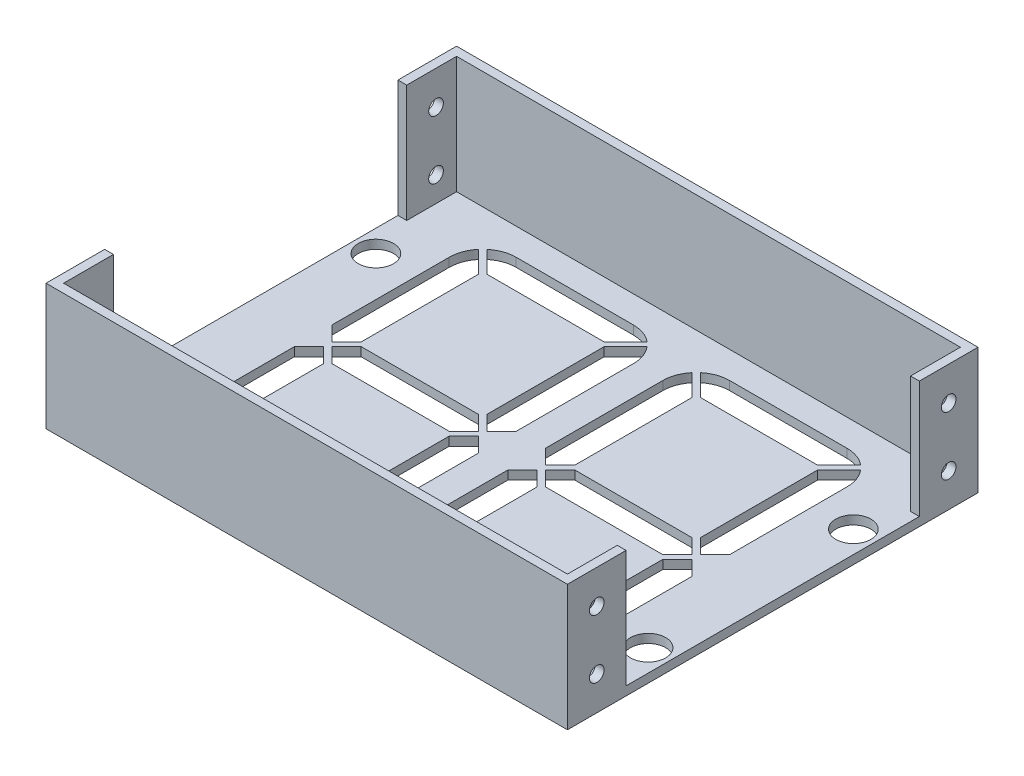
ISO-10303-21;
HEADER;
FILE_DESCRIPTION(('STEP AP214'),'2;1');
FILE_NAME('part.step','',(''),(''),'','','');
FILE_SCHEMA(('AUTOMOTIVE_DESIGN { 1 0 10303 214 1 1 1 1 }'));
ENDSEC;
DATA;
#1=APPLICATION_CONTEXT('core data for automotive mechanical design processes');
#2=APPLICATION_PROTOCOL_DEFINITION('international standard','automotive_design',2000,#1);
#3=PRODUCT_CONTEXT('',#1,'mechanical');
#4=PRODUCT('Part','Part','',(#3));
#5=PRODUCT_RELATED_PRODUCT_CATEGORY('part','',(#4));
#6=PRODUCT_DEFINITION_FORMATION('','',#4);
#7=PRODUCT_DEFINITION_CONTEXT('part definition',#1,'design');
#8=PRODUCT_DEFINITION('design','',#6,#7);
#9=PRODUCT_DEFINITION_SHAPE('','',#8);
#10=(LENGTH_UNIT() NAMED_UNIT(*) SI_UNIT(.MILLI.,.METRE.));
#11=(NAMED_UNIT(*) PLANE_ANGLE_UNIT() SI_UNIT($,.RADIAN.));
#12=(NAMED_UNIT(*) SI_UNIT($,.STERADIAN.) SOLID_ANGLE_UNIT());
#13=UNCERTAINTY_MEASURE_WITH_UNIT(LENGTH_MEASURE(1.E-05),#10,'distance_accuracy_value','');
#14=(GEOMETRIC_REPRESENTATION_CONTEXT(3) GLOBAL_UNCERTAINTY_ASSIGNED_CONTEXT((#13)) GLOBAL_UNIT_ASSIGNED_CONTEXT((#10,
#11,#12)) REPRESENTATION_CONTEXT('',''));
#15=CARTESIAN_POINT('',(0.,0.,0.));
#16=DIRECTION('',(0.,0.,1.));
#17=DIRECTION('',(1.,0.,0.));
#18=AXIS2_PLACEMENT_3D('',#15,#16,#17);
#19=CARTESIAN_POINT('',(0.,3.,0.));
#20=DIRECTION('',(0.,-1.,0.));
#21=DIRECTION('',(0.,0.,-1.));
#22=AXIS2_PLACEMENT_3D('',#19,#20,#21);
#23=PLANE('',#22);
#24=CARTESIAN_POINT('',(56.409997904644,3.,-46.4099989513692));
#25=DIRECTION('',(0.,1.,0.));
#26=DIRECTION('',(0.,0.,-1.));
#27=AXIS2_PLACEMENT_3D('',#24,#25,#26);
#28=CIRCLE('',#27,11.4169180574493);
#29=CARTESIAN_POINT('',(63.7433729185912,3.,-55.1602920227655));
#30=VERTEX_POINT('',#29);
#31=CARTESIAN_POINT('',(56.409997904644,3.,-57.8269170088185));
#32=VERTEX_POINT('',#31);
#33=EDGE_CURVE('E838',#30,#32,#28,.T.);
#34=ORIENTED_EDGE('',*,*,#33,.F.);
#35=DIRECTION('',(0.707106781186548,0.,-0.707106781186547));
#36=VECTOR('',#35,1.);
#37=CARTESIAN_POINT('',(61.4099979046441,3.,-52.8269170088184));
#38=LINE('',#37,#36);
#39=CARTESIAN_POINT('',(56.4099979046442,3.,-47.8269170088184));
#40=VERTEX_POINT('',#39);
#41=EDGE_CURVE('E850',#40,#30,#38,.T.);
#42=ORIENTED_EDGE('',*,*,#41,.F.);
#43=DIRECTION('',(1.,0.,0.));
#44=VECTOR('',#43,1.);
#45=CARTESIAN_POINT('',(16.4099979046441,3.,-47.8269170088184));
#46=LINE('',#45,#44);
#47=CARTESIAN_POINT('',(16.4099979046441,3.,-47.8269170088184));
#48=VERTEX_POINT('',#47);
#49=EDGE_CURVE('E847',#48,#40,#46,.T.);
#50=ORIENTED_EDGE('',*,*,#49,.F.);
#51=DIRECTION('',(0.707106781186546,0.,0.70710678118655));
#52=VECTOR('',#51,1.);
#53=CARTESIAN_POINT('',(11.409998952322,3.,-52.8269159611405));
#54=LINE('',#53,#52);
#55=CARTESIAN_POINT('',(9.07719722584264,3.,-55.1597176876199));
#56=VERTEX_POINT('',#55);
#57=EDGE_CURVE('E845',#56,#48,#54,.T.);
#58=ORIENTED_EDGE('',*,*,#57,.F.);
#59=CARTESIAN_POINT('',(16.41,3.,-46.4134564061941));
#60=DIRECTION('',(0.,1.,0.));
#61=DIRECTION('',(0.,0.,1.));
#62=AXIS2_PLACEMENT_3D('',#59,#60,#61);
#63=CIRCLE('',#62,11.4134606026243);
#64=CARTESIAN_POINT('',(16.41,3.,-57.8269170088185));
#65=VERTEX_POINT('',#64);
#66=EDGE_CURVE('E843',#65,#56,#63,.T.);
#67=ORIENTED_EDGE('',*,*,#66,.F.);
#68=DIRECTION('',(-1.,0.,0.));
#69=VECTOR('',#68,1.);
#70=CARTESIAN_POINT('',(16.41,3.,-57.8269170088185));
#71=LINE('',#70,#69);
#72=EDGE_CURVE('E840',#32,#65,#71,.T.);
#73=ORIENTED_EDGE('',*,*,#72,.F.);
#74=EDGE_LOOP('',(#34,#42,#50,#58,#67,#73));
#75=FACE_BOUND('',#74,.T.);
#76=DIRECTION('',(0.707106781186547,0.,0.707106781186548));
#77=VECTOR('',#76,1.);
#78=CARTESIAN_POINT('',(62.8276710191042,3.,-1.41075400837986));
#79=LINE('',#78,#77);
#80=CARTESIAN_POINT('',(57.8284260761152,3.,-6.40999895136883));
#81=VERTEX_POINT('',#80);
#82=CARTESIAN_POINT('',(62.8276710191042,3.,-1.41075400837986));
#83=VERTEX_POINT('',#82);
#84=EDGE_CURVE('E931',#81,#83,#79,.T.);
#85=ORIENTED_EDGE('',*,*,#84,.F.);
#86=DIRECTION('',(0.,0.,1.));
#87=VECTOR('',#86,1.);
#88=CARTESIAN_POINT('',(57.8284260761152,3.,-6.40999895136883));
#89=LINE('',#88,#87);
#90=CARTESIAN_POINT('',(57.8284260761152,3.,-46.4099989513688));
#91=VERTEX_POINT('',#90);
#92=EDGE_CURVE('E943',#91,#81,#89,.T.);
#93=ORIENTED_EDGE('',*,*,#92,.F.);
#94=DIRECTION('',(-0.707106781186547,0.,0.707106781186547));
#95=VECTOR('',#94,1.);
#96=CARTESIAN_POINT('',(62.8276710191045,3.,-51.409243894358));
#97=LINE('',#96,#95);
#98=CARTESIAN_POINT('',(65.1609794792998,3.,-53.7425523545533));
#99=VERTEX_POINT('',#98);
#100=EDGE_CURVE('E940',#99,#91,#97,.T.);
#101=ORIENTED_EDGE('',*,*,#100,.F.);
#102=CARTESIAN_POINT('',(56.409997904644,3.,-46.4099989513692));
#103=DIRECTION('',(0.,1.,0.));
#104=DIRECTION('',(0.,0.,-1.));
#105=AXIS2_PLACEMENT_3D('',#102,#103,#104);
#106=CIRCLE('',#105,11.4169180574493);
#107=CARTESIAN_POINT('',(67.8269159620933,3.,-46.4099989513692));
#108=VERTEX_POINT('',#107);
#109=EDGE_CURVE('E938',#108,#99,#106,.T.);
#110=ORIENTED_EDGE('',*,*,#109,.F.);
#111=DIRECTION('',(0.,0.,-1.));
#112=VECTOR('',#111,1.);
#113=CARTESIAN_POINT('',(67.8269159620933,3.,-46.4099989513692));
#114=LINE('',#113,#112);
#115=CARTESIAN_POINT('',(67.8269159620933,3.,-6.40999895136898));
#116=VERTEX_POINT('',#115);
#117=EDGE_CURVE('E936',#116,#108,#114,.T.);
#118=ORIENTED_EDGE('',*,*,#117,.F.);
#119=DIRECTION('',(0.707106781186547,0.,-0.707106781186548));
#120=VECTOR('',#119,1.);
#121=CARTESIAN_POINT('',(67.8269159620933,3.,-6.40999895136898));
#122=LINE('',#121,#120);
#123=EDGE_CURVE('E933',#83,#116,#122,.T.);
#124=ORIENTED_EDGE('',*,*,#123,.F.);
#125=EDGE_LOOP('',(#85,#93,#101,#110,#118,#124));
#126=FACE_BOUND('',#125,.T.);
#127=DIRECTION('',(1.,0.,0.));
#128=VECTOR('',#127,1.);
#129=CARTESIAN_POINT('',(16.4134574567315,3.,5.00345955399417));
#130=LINE('',#129,#128);
#131=CARTESIAN_POINT('',(16.4134574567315,3.,5.00345955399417));
#132=VERTEX_POINT('',#131);
#133=CARTESIAN_POINT('',(56.4134574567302,3.,5.00345955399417));
#134=VERTEX_POINT('',#133);
#135=EDGE_CURVE('E1023',#132,#134,#130,.T.);
#136=ORIENTED_EDGE('',*,*,#135,.F.);
#137=DIRECTION('',(0.707106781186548,0.,0.707106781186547));
#138=VECTOR('',#137,1.);
#139=CARTESIAN_POINT('',(16.4134574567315,3.,5.00345955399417));
#140=LINE('',#139,#138);
#141=CARTESIAN_POINT('',(11.4134574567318,3.,0.00345955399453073));
#142=VERTEX_POINT('',#141);
#143=EDGE_CURVE('E1035',#142,#132,#140,.T.);
#144=ORIENTED_EDGE('',*,*,#143,.F.);
#145=DIRECTION('',(-0.707106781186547,0.,0.707106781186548));
#146=VECTOR('',#145,1.);
#147=CARTESIAN_POINT('',(11.4134574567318,3.,0.00345955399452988));
#148=LINE('',#147,#146);
#149=CARTESIAN_POINT('',(16.4134574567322,3.,-4.99654044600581));
#150=VERTEX_POINT('',#149);
#151=EDGE_CURVE('E1032',#150,#142,#148,.T.);
#152=ORIENTED_EDGE('',*,*,#151,.F.);
#153=DIRECTION('',(-1.,0.,0.));
#154=VECTOR('',#153,1.);
#155=CARTESIAN_POINT('',(16.4134574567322,3.,-4.99654044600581));
#156=LINE('',#155,#154);
#157=CARTESIAN_POINT('',(56.4134574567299,3.,-4.99654044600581));
#158=VERTEX_POINT('',#157);
#159=EDGE_CURVE('E1030',#158,#150,#156,.T.);
#160=ORIENTED_EDGE('',*,*,#159,.F.);
#161=DIRECTION('',(-0.707106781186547,0.,-0.707106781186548));
#162=VECTOR('',#161,1.);
#163=CARTESIAN_POINT('',(61.41345745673,3.,0.00345955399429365));
#164=LINE('',#163,#162);
#165=CARTESIAN_POINT('',(61.41345745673,3.,0.00345955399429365));
#166=VERTEX_POINT('',#165);
#167=EDGE_CURVE('E1028',#166,#158,#164,.T.);
#168=ORIENTED_EDGE('',*,*,#167,.F.);
#169=DIRECTION('',(0.707106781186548,0.,-0.707106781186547));
#170=VECTOR('',#169,1.);
#171=CARTESIAN_POINT('',(56.4134574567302,3.,5.00345955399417));
#172=LINE('',#171,#170);
#173=EDGE_CURVE('E1025',#134,#166,#172,.T.);
#174=ORIENTED_EDGE('',*,*,#173,.F.);
#175=EDGE_LOOP('',(#136,#144,#152,#160,#168,#174));
#176=FACE_BOUND('',#175,.T.);
#177=DIRECTION('',(0.,0.,1.));
#178=VECTOR('',#177,1.);
#179=CARTESIAN_POINT('',(-67.8269159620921,3.,46.4169180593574));
#180=LINE('',#179,#178);
#181=CARTESIAN_POINT('',(-67.8269159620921,3.,6.4169180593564));
#182=VERTEX_POINT('',#181);
#183=CARTESIAN_POINT('',(-67.8269159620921,3.,46.4169180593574));
#184=VERTEX_POINT('',#183);
#185=EDGE_CURVE('E1120',#182,#184,#180,.T.);
#186=ORIENTED_EDGE('',*,*,#185,.F.);
#187=DIRECTION('',(-0.707106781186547,0.,0.707106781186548));
#188=VECTOR('',#187,1.);
#189=CARTESIAN_POINT('',(-67.8269159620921,3.,6.4169180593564));
#190=LINE('',#189,#188);
#191=CARTESIAN_POINT('',(-62.8276710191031,3.,1.4176731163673));
#192=VERTEX_POINT('',#191);
#193=EDGE_CURVE('E1132',#192,#182,#190,.T.);
#194=ORIENTED_EDGE('',*,*,#193,.F.);
#195=DIRECTION('',(-0.707106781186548,0.,-0.707106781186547));
#196=VECTOR('',#195,1.);
#197=CARTESIAN_POINT('',(-62.827671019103,3.,1.41767311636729));
#198=LINE('',#197,#196);
#199=CARTESIAN_POINT('',(-57.8284260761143,3.,6.41691805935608));
#200=VERTEX_POINT('',#199);
#201=EDGE_CURVE('E1129',#200,#192,#198,.T.);
#202=ORIENTED_EDGE('',*,*,#201,.F.);
#203=DIRECTION('',(0.,0.,-1.));
#204=VECTOR('',#203,1.);
#205=CARTESIAN_POINT('',(-57.8284260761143,3.,6.41691805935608));
#206=LINE('',#205,#204);
#207=CARTESIAN_POINT('',(-57.8284260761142,3.,46.416918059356));
#208=VERTEX_POINT('',#207);
#209=EDGE_CURVE('E1127',#208,#200,#206,.T.);
#210=ORIENTED_EDGE('',*,*,#209,.F.);
#211=DIRECTION('',(0.707106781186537,0.,-0.707106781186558));
#212=VECTOR('',#211,1.);
#213=CARTESIAN_POINT('',(-62.8276710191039,3.,51.4161630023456));
#214=LINE('',#213,#212);
#215=CARTESIAN_POINT('',(-65.1609805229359,3.,53.7494725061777));
#216=VERTEX_POINT('',#215);
#217=EDGE_CURVE('E1125',#216,#208,#214,.T.);
#218=ORIENTED_EDGE('',*,*,#217,.F.);
#219=CARTESIAN_POINT('',(-56.4099916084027,3.,46.4169180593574));
#220=DIRECTION('',(0.,1.,0.));
#221=DIRECTION('',(0.,0.,-1.));
#222=AXIS2_PLACEMENT_3D('',#219,#220,#221);
#223=CIRCLE('',#222,11.4169243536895);
#224=EDGE_CURVE('E1122',#184,#216,#223,.T.);
#225=ORIENTED_EDGE('',*,*,#224,.F.);
#226=EDGE_LOOP('',(#186,#194,#202,#210,#218,#225));
#227=FACE_BOUND('',#226,.T.);
#228=CARTESIAN_POINT('',(-56.4099979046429,3.,-46.4099989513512));
#229=DIRECTION('',(0.,1.,0.));
#230=DIRECTION('',(0.,0.,1.));
#231=AXIS2_PLACEMENT_3D('',#228,#229,#230);
#232=CIRCLE('',#231,11.4169180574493);
#233=CARTESIAN_POINT('',(-65.1609794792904,3.,-53.7425523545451));
#234=VERTEX_POINT('',#233);
#235=CARTESIAN_POINT('',(-67.8269159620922,3.,-46.4099989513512));
#236=VERTEX_POINT('',#235);
#237=EDGE_CURVE('E1219',#234,#236,#232,.T.);
#238=ORIENTED_EDGE('',*,*,#237,.F.);
#239=DIRECTION('',(-0.707106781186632,0.,-0.707106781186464));
#240=VECTOR('',#239,1.);
#241=CARTESIAN_POINT('',(-57.8284260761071,3.,-46.4099989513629));
#242=LINE('',#241,#240);
#243=CARTESIAN_POINT('',(-57.8284260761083,3.,-46.4099989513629));
#244=VERTEX_POINT('',#243);
#245=EDGE_CURVE('E1231',#244,#234,#242,.T.);
#246=ORIENTED_EDGE('',*,*,#245,.F.);
#247=DIRECTION('',(0.,0.,-1.));
#248=VECTOR('',#247,1.);
#249=CARTESIAN_POINT('',(-57.8284260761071,3.,-6.40999895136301));
#250=LINE('',#249,#248);
#251=CARTESIAN_POINT('',(-57.8284260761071,3.,-6.40999895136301));
#252=VERTEX_POINT('',#251);
#253=EDGE_CURVE('E1228',#252,#244,#250,.T.);
#254=ORIENTED_EDGE('',*,*,#253,.F.);
#255=DIRECTION('',(0.707106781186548,0.,-0.707106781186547));
#256=VECTOR('',#255,1.);
#257=CARTESIAN_POINT('',(-62.8276710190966,3.,-1.41075400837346));
#258=LINE('',#257,#256);
#259=CARTESIAN_POINT('',(-62.8276710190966,3.,-1.41075400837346));
#260=VERTEX_POINT('',#259);
#261=EDGE_CURVE('E1226',#260,#252,#258,.T.);
#262=ORIENTED_EDGE('',*,*,#261,.F.);
#263=DIRECTION('',(0.707106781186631,0.,0.707106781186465));
#264=VECTOR('',#263,1.);
#265=CARTESIAN_POINT('',(-67.8269159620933,3.,-6.40999895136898));
#266=LINE('',#265,#264);
#267=CARTESIAN_POINT('',(-67.8269159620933,3.,-6.40999895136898));
#268=VERTEX_POINT('',#267);
#269=EDGE_CURVE('E1224',#268,#260,#266,.T.);
#270=ORIENTED_EDGE('',*,*,#269,.F.);
#271=DIRECTION('',(0.,0.,1.));
#272=VECTOR('',#271,1.);
#273=CARTESIAN_POINT('',(-67.8269159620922,3.,-46.4099989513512));
#274=LINE('',#273,#272);
#275=EDGE_CURVE('E1221',#236,#268,#274,.T.);
#276=ORIENTED_EDGE('',*,*,#275,.F.);
#277=EDGE_LOOP('',(#238,#246,#254,#262,#270,#276));
#278=FACE_BOUND('',#277,.T.);
#279=DIRECTION('',(0.707106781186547,0.,-0.707106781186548));
#280=VECTOR('',#279,1.);
#281=CARTESIAN_POINT('',(-16.4134574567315,3.,5.00345955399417));
#282=LINE('',#281,#280);
#283=CARTESIAN_POINT('',(-16.4134574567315,3.,5.00345955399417));
#284=VERTEX_POINT('',#283);
#285=CARTESIAN_POINT('',(-11.4134574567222,3.,0.00345955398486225));
#286=VERTEX_POINT('',#285);
#287=EDGE_CURVE('E1317',#284,#286,#282,.T.);
#288=ORIENTED_EDGE('',*,*,#287,.F.);
#289=DIRECTION('',(1.,0.,0.));
#290=VECTOR('',#289,1.);
#291=CARTESIAN_POINT('',(-16.4134574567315,3.,5.00345955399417));
#292=LINE('',#291,#290);
#293=CARTESIAN_POINT('',(-56.4134574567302,3.,5.00345955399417));
#294=VERTEX_POINT('',#293);
#295=EDGE_CURVE('E1329',#294,#284,#292,.T.);
#296=ORIENTED_EDGE('',*,*,#295,.F.);
#297=DIRECTION('',(0.707106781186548,0.,0.707106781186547));
#298=VECTOR('',#297,1.);
#299=CARTESIAN_POINT('',(-56.4134574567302,3.,5.00345955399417));
#300=LINE('',#299,#298);
#301=CARTESIAN_POINT('',(-61.41345745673,3.,0.00345955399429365));
#302=VERTEX_POINT('',#301);
#303=EDGE_CURVE('E1326',#302,#294,#300,.T.);
#304=ORIENTED_EDGE('',*,*,#303,.F.);
#305=DIRECTION('',(-0.70710678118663,0.,0.707106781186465));
#306=VECTOR('',#305,1.);
#307=CARTESIAN_POINT('',(-61.41345745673,3.,0.00345955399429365));
#308=LINE('',#307,#306);
#309=CARTESIAN_POINT('',(-56.4134574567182,3.,-4.99654044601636));
#310=VERTEX_POINT('',#309);
#311=EDGE_CURVE('E1324',#310,#302,#308,.T.);
#312=ORIENTED_EDGE('',*,*,#311,.F.);
#313=DIRECTION('',(-1.,0.,0.));
#314=VECTOR('',#313,1.);
#315=CARTESIAN_POINT('',(-16.4134574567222,3.,-4.99654044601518));
#316=LINE('',#315,#314);
#317=CARTESIAN_POINT('',(-16.4134574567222,3.,-4.99654044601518));
#318=VERTEX_POINT('',#317);
#319=EDGE_CURVE('E1322',#318,#310,#316,.T.);
#320=ORIENTED_EDGE('',*,*,#319,.F.);
#321=DIRECTION('',(-0.707106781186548,0.,-0.707106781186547));
#322=VECTOR('',#321,1.);
#323=CARTESIAN_POINT('',(-11.4134574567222,3.,0.00345955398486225));
#324=LINE('',#323,#322);
#325=EDGE_CURVE('E1319',#286,#318,#324,.T.);
#326=ORIENTED_EDGE('',*,*,#325,.F.);
#327=EDGE_LOOP('',(#288,#296,#304,#312,#320,#326));
#328=FACE_BOUND('',#327,.T.);
#329=CARTESIAN_POINT('',(-16.4099999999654,3.,-46.4134564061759));
#330=DIRECTION('',(0.,1.,0.));
#331=DIRECTION('',(0.,0.,-1.));
#332=AXIS2_PLACEMENT_3D('',#329,#330,#331);
#333=CIRCLE('',#332,11.4134606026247);
#334=CARTESIAN_POINT('',(-4.99653939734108,3.,-46.4134564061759));
#335=VERTEX_POINT('',#334);
#336=CARTESIAN_POINT('',(-7.6630500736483,3.,-53.7454377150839));
#337=VERTEX_POINT('',#336);
#338=EDGE_CURVE('E1408',#335,#337,#333,.T.);
#339=ORIENTED_EDGE('',*,*,#338,.F.);
#340=DIRECTION('',(0.,0.,-1.));
#341=VECTOR('',#340,1.);
#342=CARTESIAN_POINT('',(-4.99653939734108,3.,-46.4134564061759));
#343=LINE('',#342,#341);
#344=CARTESIAN_POINT('',(-4.99653939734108,3.,-6.41345850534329));
#345=VERTEX_POINT('',#344);
#346=EDGE_CURVE('E1420',#345,#335,#343,.T.);
#347=ORIENTED_EDGE('',*,*,#346,.F.);
#348=DIRECTION('',(0.707106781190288,0.,-0.707106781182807));
#349=VECTOR('',#348,1.);
#350=CARTESIAN_POINT('',(-4.99653939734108,3.,-6.41345850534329));
#351=LINE('',#350,#349);
#352=CARTESIAN_POINT('',(-9.99924389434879,3.,-1.41075400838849));
#353=VERTEX_POINT('',#352);
#354=EDGE_CURVE('E1417',#353,#345,#351,.T.);
#355=ORIENTED_EDGE('',*,*,#354,.F.);
#356=DIRECTION('',(0.707106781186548,0.,0.707106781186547));
#357=VECTOR('',#356,1.);
#358=CARTESIAN_POINT('',(-9.99924389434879,3.,-1.41075400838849));
#359=LINE('',#358,#357);
#360=CARTESIAN_POINT('',(-14.9984888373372,3.,-6.40999895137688));
#361=VERTEX_POINT('',#360);
#362=EDGE_CURVE('E1415',#361,#353,#359,.T.);
#363=ORIENTED_EDGE('',*,*,#362,.F.);
#364=DIRECTION('',(0.,0.,1.));
#365=VECTOR('',#364,1.);
#366=CARTESIAN_POINT('',(-14.9984888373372,3.,-6.40999895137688));
#367=LINE('',#366,#365);
#368=CARTESIAN_POINT('',(-14.9984888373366,3.,-46.4099989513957));
#369=VERTEX_POINT('',#368);
#370=EDGE_CURVE('E1413',#369,#361,#367,.T.);
#371=ORIENTED_EDGE('',*,*,#370,.F.);
#372=DIRECTION('',(-0.707106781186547,0.,0.707106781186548));
#373=VECTOR('',#372,1.);
#374=CARTESIAN_POINT('',(-9.99578538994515,3.,-51.4127023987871));
#375=LINE('',#374,#373);
#376=EDGE_CURVE('E1410',#337,#369,#375,.T.);
#377=ORIENTED_EDGE('',*,*,#376,.F.);
#378=EDGE_LOOP('',(#339,#347,#355,#363,#371,#377));
#379=FACE_BOUND('',#378,.T.);
#380=CARTESIAN_POINT('',(-56.4099979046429,3.,-46.4099989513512));
#381=DIRECTION('',(0.,1.,0.));
#382=DIRECTION('',(0.,0.,1.));
#383=AXIS2_PLACEMENT_3D('',#380,#381,#382);
#384=CIRCLE('',#383,11.4169180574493);
#385=CARTESIAN_POINT('',(-56.4099979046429,3.,-57.8269170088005));
#386=VERTEX_POINT('',#385);
#387=CARTESIAN_POINT('',(-63.7433729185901,3.,-55.1602920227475));
#388=VERTEX_POINT('',#387);
#389=EDGE_CURVE('E1362',#386,#388,#384,.T.);
#390=ORIENTED_EDGE('',*,*,#389,.F.);
#391=DIRECTION('',(-1.,0.,0.));
#392=VECTOR('',#391,1.);
#393=CARTESIAN_POINT('',(-16.4099999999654,3.,-57.8269170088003));
#394=LINE('',#393,#392);
#395=CARTESIAN_POINT('',(-16.4099999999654,3.,-57.8269170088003));
#396=VERTEX_POINT('',#395);
#397=EDGE_CURVE('E1374',#396,#386,#394,.T.);
#398=ORIENTED_EDGE('',*,*,#397,.F.);
#399=CARTESIAN_POINT('',(-16.4099999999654,3.,-46.4134564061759));
#400=DIRECTION('',(0.,1.,0.));
#401=DIRECTION('',(0.,0.,-1.));
#402=AXIS2_PLACEMENT_3D('',#399,#400,#401);
#403=CIRCLE('',#402,11.4134606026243);
#404=CARTESIAN_POINT('',(-9.0771972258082,3.,-55.1597176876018));
#405=VERTEX_POINT('',#404);
#406=EDGE_CURVE('E1371',#405,#396,#403,.T.);
#407=ORIENTED_EDGE('',*,*,#406,.F.);
#408=DIRECTION('',(0.707106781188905,0.,-0.70710678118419));
#409=VECTOR('',#408,1.);
#410=CARTESIAN_POINT('',(-11.4099989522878,3.,-52.8269159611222));
#411=LINE('',#410,#409);
#412=CARTESIAN_POINT('',(-16.409997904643,3.,-47.8269170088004));
#413=VERTEX_POINT('',#412);
#414=EDGE_CURVE('E1369',#413,#405,#411,.T.);
#415=ORIENTED_EDGE('',*,*,#414,.F.);
#416=DIRECTION('',(1.,0.,0.));
#417=VECTOR('',#416,1.);
#418=CARTESIAN_POINT('',(-16.409997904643,3.,-47.8269170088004));
#419=LINE('',#418,#417);
#420=CARTESIAN_POINT('',(-56.409997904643,3.,-47.8269170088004));
#421=VERTEX_POINT('',#420);
#422=EDGE_CURVE('E1367',#421,#413,#419,.T.);
#423=ORIENTED_EDGE('',*,*,#422,.F.);
#424=DIRECTION('',(0.707106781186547,0.,0.707106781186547));
#425=VECTOR('',#424,1.);
#426=CARTESIAN_POINT('',(-63.7433729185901,3.,-55.1602920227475));
#427=LINE('',#426,#425);
#428=EDGE_CURVE('E1364',#388,#421,#427,.T.);
#429=ORIENTED_EDGE('',*,*,#428,.F.);
#430=EDGE_LOOP('',(#390,#398,#407,#415,#423,#429));
#431=FACE_BOUND('',#430,.T.);
#432=CARTESIAN_POINT('',(-16.4099916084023,3.,46.4238476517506));
#433=DIRECTION('',(0.,1.,0.));
#434=DIRECTION('',(0.,0.,1.));
#435=AXIS2_PLACEMENT_3D('',#432,#433,#434);
#436=CIRCLE('',#435,11.4099947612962);
#437=CARTESIAN_POINT('',(-7.66539712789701,3.,53.7532437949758));
#438=VERTEX_POINT('',#437);
#439=CARTESIAN_POINT('',(-4.9999968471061,3.,46.4238476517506));
#440=VERTEX_POINT('',#439);
#441=EDGE_CURVE('E1265',#438,#440,#436,.T.);
#442=ORIENTED_EDGE('',*,*,#441,.F.);
#443=DIRECTION('',(0.706617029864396,0.,0.707596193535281));
#444=VECTOR('',#443,1.);
#445=CARTESIAN_POINT('',(-7.66539712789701,3.,53.7532437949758));
#446=LINE('',#445,#444);
#447=CARTESIAN_POINT('',(-9.99924389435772,3.,51.4161630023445));
#448=VERTEX_POINT('',#447);
#449=EDGE_CURVE('E1279',#448,#438,#446,.T.);
#450=ORIENTED_EDGE('',*,*,#449,.F.);
#451=DIRECTION('',(0.707106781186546,0.,0.707106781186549));
#452=VECTOR('',#451,1.);
#453=CARTESIAN_POINT('',(-14.9984888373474,3.,46.4169180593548));
#454=LINE('',#453,#452);
#455=CARTESIAN_POINT('',(-14.9984888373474,3.,46.4169180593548));
#456=VERTEX_POINT('',#455);
#457=EDGE_CURVE('E1276',#456,#448,#454,.T.);
#458=ORIENTED_EDGE('',*,*,#457,.F.);
#459=DIRECTION('',(0.,0.,1.));
#460=VECTOR('',#459,1.);
#461=CARTESIAN_POINT('',(-14.9984888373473,3.,6.41691805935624));
#462=LINE('',#461,#460);
#463=CARTESIAN_POINT('',(-14.9984888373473,3.,6.41691805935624));
#464=VERTEX_POINT('',#463);
#465=EDGE_CURVE('E1274',#464,#456,#462,.T.);
#466=ORIENTED_EDGE('',*,*,#465,.F.);
#467=DIRECTION('',(-0.70710709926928,0.,0.707106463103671));
#468=VECTOR('',#467,1.);
#469=CARTESIAN_POINT('',(-9.9957792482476,3.,1.4142129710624));
#470=LINE('',#469,#468);
#471=CARTESIAN_POINT('',(-9.9957792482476,3.,1.4142129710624));
#472=VERTEX_POINT('',#471);
#473=EDGE_CURVE('E1272',#472,#464,#470,.T.);
#474=ORIENTED_EDGE('',*,*,#473,.F.);
#475=DIRECTION('',(-0.706617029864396,0.,-0.707596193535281));
#476=VECTOR('',#475,1.);
#477=CARTESIAN_POINT('',(-4.9999968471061,3.,6.41691805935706));
#478=LINE('',#477,#476);
#479=CARTESIAN_POINT('',(-4.9999968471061,3.,6.41691805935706));
#480=VERTEX_POINT('',#479);
#481=EDGE_CURVE('E1270',#480,#472,#478,.T.);
#482=ORIENTED_EDGE('',*,*,#481,.F.);
#483=DIRECTION('',(0.,0.,-1.));
#484=VECTOR('',#483,1.);
#485=CARTESIAN_POINT('',(-4.9999968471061,3.,46.4238476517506));
#486=LINE('',#485,#484);
#487=EDGE_CURVE('E1267',#440,#480,#486,.T.);
#488=ORIENTED_EDGE('',*,*,#487,.F.);
#489=EDGE_LOOP('',(#442,#450,#458,#466,#474,#482,#488));
#490=FACE_BOUND('',#489,.T.);
#491=CARTESIAN_POINT('',(-56.4099916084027,3.,46.4169180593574));
#492=DIRECTION('',(0.,1.,0.));
#493=DIRECTION('',(0.,0.,-1.));
#494=AXIS2_PLACEMENT_3D('',#491,#492,#493);
#495=CIRCLE('',#494,11.4169243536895);
#496=CARTESIAN_POINT('',(-63.7433676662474,3.,55.1672184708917));
#497=VERTEX_POINT('',#496);
#498=CARTESIAN_POINT('',(-56.4099916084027,3.,57.8338424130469));
#499=VERTEX_POINT('',#498);
#500=EDGE_CURVE('E1166',#497,#499,#495,.T.);
#501=ORIENTED_EDGE('',*,*,#500,.F.);
#502=DIRECTION('',(-0.707106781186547,0.,0.707106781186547));
#503=VECTOR('',#502,1.);
#504=CARTESIAN_POINT('',(-61.4099916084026,3.,52.8338424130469));
#505=LINE('',#504,#503);
#506=CARTESIAN_POINT('',(-56.4099916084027,3.,47.8338424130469));
#507=VERTEX_POINT('',#506);
#508=EDGE_CURVE('E1180',#507,#497,#505,.T.);
#509=ORIENTED_EDGE('',*,*,#508,.F.);
#510=DIRECTION('',(-1.,0.,0.));
#511=VECTOR('',#510,1.);
#512=CARTESIAN_POINT('',(-16.4099916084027,3.,47.8338424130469));
#513=LINE('',#512,#511);
#514=CARTESIAN_POINT('',(-16.4099916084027,3.,47.8338424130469));
#515=VERTEX_POINT('',#514);
#516=EDGE_CURVE('E1177',#515,#507,#513,.T.);
#517=ORIENTED_EDGE('',*,*,#516,.F.);
#518=DIRECTION('',(-0.707596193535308,0.,-0.706617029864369));
#519=VECTOR('',#518,1.);
#520=CARTESIAN_POINT('',(-11.4065297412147,3.,52.8303805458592));
#521=LINE('',#520,#519);
#522=CARTESIAN_POINT('',(-11.4065297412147,3.,52.8303805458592));
#523=VERTEX_POINT('',#522);
#524=EDGE_CURVE('E1175',#523,#515,#521,.T.);
#525=ORIENTED_EDGE('',*,*,#524,.F.);
#526=DIRECTION('',(-0.706617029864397,0.,-0.70759619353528));
#527=VECTOR('',#526,1.);
#528=CARTESIAN_POINT('',(-11.4065297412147,3.,52.8303805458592));
#529=LINE('',#528,#527);
#530=CARTESIAN_POINT('',(-9.07575625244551,3.,55.1643838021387));
#531=VERTEX_POINT('',#530);
#532=EDGE_CURVE('E1173',#531,#523,#529,.T.);
#533=ORIENTED_EDGE('',*,*,#532,.F.);
#534=CARTESIAN_POINT('',(-16.4099916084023,3.,46.4238476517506));
#535=DIRECTION('',(0.,1.,0.));
#536=DIRECTION('',(0.,0.,1.));
#537=AXIS2_PLACEMENT_3D('',#534,#535,#536);
#538=CIRCLE('',#537,11.4099947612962);
#539=CARTESIAN_POINT('',(-16.4099916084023,3.,57.8338424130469));
#540=VERTEX_POINT('',#539);
#541=EDGE_CURVE('E1171',#540,#531,#538,.T.);
#542=ORIENTED_EDGE('',*,*,#541,.F.);
#543=DIRECTION('',(1.,0.,0.));
#544=VECTOR('',#543,1.);
#545=CARTESIAN_POINT('',(-16.4099916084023,3.,57.8338424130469));
#546=LINE('',#545,#544);
#547=EDGE_CURVE('E1168',#499,#540,#546,.T.);
#548=ORIENTED_EDGE('',*,*,#547,.F.);
#549=EDGE_LOOP('',(#501,#509,#517,#525,#533,#542,#548));
#550=FACE_BOUND('',#549,.T.);
#551=DIRECTION('',(-0.70710709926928,0.,-0.707106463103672));
#552=VECTOR('',#551,1.);
#553=CARTESIAN_POINT('',(9.9957792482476,3.,1.4142129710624));
#554=LINE('',#553,#552);
#555=CARTESIAN_POINT('',(14.9984888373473,3.,6.41691805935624));
#556=VERTEX_POINT('',#555);
#557=CARTESIAN_POINT('',(9.9957792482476,3.,1.4142129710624));
#558=VERTEX_POINT('',#557);
#559=EDGE_CURVE('E1068',#556,#558,#554,.T.);
#560=ORIENTED_EDGE('',*,*,#559,.F.);
#561=DIRECTION('',(0.,0.,-1.));
#562=VECTOR('',#561,1.);
#563=CARTESIAN_POINT('',(14.9984888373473,3.,6.41691805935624));
#564=LINE('',#563,#562);
#565=CARTESIAN_POINT('',(14.9984888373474,3.,46.4169180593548));
#566=VERTEX_POINT('',#565);
#567=EDGE_CURVE('E1082',#566,#556,#564,.T.);
#568=ORIENTED_EDGE('',*,*,#567,.F.);
#569=DIRECTION('',(0.707106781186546,0.,-0.707106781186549));
#570=VECTOR('',#569,1.);
#571=CARTESIAN_POINT('',(14.9984888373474,3.,46.4169180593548));
#572=LINE('',#571,#570);
#573=CARTESIAN_POINT('',(9.99924389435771,3.,51.4161630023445));
#574=VERTEX_POINT('',#573);
#575=EDGE_CURVE('E1079',#574,#566,#572,.T.);
#576=ORIENTED_EDGE('',*,*,#575,.F.);
#577=DIRECTION('',(0.706617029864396,0.,-0.707596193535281));
#578=VECTOR('',#577,1.);
#579=CARTESIAN_POINT('',(7.66539712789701,3.,53.7532437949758));
#580=LINE('',#579,#578);
#581=CARTESIAN_POINT('',(7.66539712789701,3.,53.7532437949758));
#582=VERTEX_POINT('',#581);
#583=EDGE_CURVE('E1077',#582,#574,#580,.T.);
#584=ORIENTED_EDGE('',*,*,#583,.F.);
#585=CARTESIAN_POINT('',(16.4099916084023,3.,46.4238476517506));
#586=DIRECTION('',(0.,1.,0.));
#587=DIRECTION('',(0.,0.,-1.));
#588=AXIS2_PLACEMENT_3D('',#585,#586,#587);
#589=CIRCLE('',#588,11.4099947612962);
#590=CARTESIAN_POINT('',(4.9999968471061,3.,46.4238476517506));
#591=VERTEX_POINT('',#590);
#592=EDGE_CURVE('E1075',#591,#582,#589,.T.);
#593=ORIENTED_EDGE('',*,*,#592,.F.);
#594=DIRECTION('',(0.,0.,1.));
#595=VECTOR('',#594,1.);
#596=CARTESIAN_POINT('',(4.9999968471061,3.,46.4238476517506));
#597=LINE('',#596,#595);
#598=CARTESIAN_POINT('',(4.9999968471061,3.,6.41691805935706));
#599=VERTEX_POINT('',#598);
#600=EDGE_CURVE('E1073',#599,#591,#597,.T.);
#601=ORIENTED_EDGE('',*,*,#600,.F.);
#602=DIRECTION('',(-0.706617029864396,0.,0.707596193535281));
#603=VECTOR('',#602,1.);
#604=CARTESIAN_POINT('',(4.9999968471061,3.,6.41691805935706));
#605=LINE('',#604,#603);
#606=EDGE_CURVE('E1070',#558,#599,#605,.T.);
#607=ORIENTED_EDGE('',*,*,#606,.F.);
#608=EDGE_LOOP('',(#560,#568,#576,#584,#593,#601,#607));
#609=FACE_BOUND('',#608,.T.);
#610=DIRECTION('',(-0.707106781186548,0.,0.707106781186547));
#611=VECTOR('',#610,1.);
#612=CARTESIAN_POINT('',(62.827671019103,3.,1.41767311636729));
#613=LINE('',#612,#611);
#614=CARTESIAN_POINT('',(62.827671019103,3.,1.41767311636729));
#615=VERTEX_POINT('',#614);
#616=CARTESIAN_POINT('',(57.8284260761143,3.,6.41691805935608));
#617=VERTEX_POINT('',#616);
#618=EDGE_CURVE('E977',#615,#617,#613,.T.);
#619=ORIENTED_EDGE('',*,*,#618,.F.);
#620=DIRECTION('',(-0.707106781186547,0.,-0.707106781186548));
#621=VECTOR('',#620,1.);
#622=CARTESIAN_POINT('',(67.8269159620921,3.,6.4169180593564));
#623=LINE('',#622,#621);
#624=CARTESIAN_POINT('',(67.8269159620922,3.,6.4169180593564));
#625=VERTEX_POINT('',#624);
#626=EDGE_CURVE('E989',#625,#615,#623,.T.);
#627=ORIENTED_EDGE('',*,*,#626,.F.);
#628=DIRECTION('',(0.,0.,-1.));
#629=VECTOR('',#628,1.);
#630=CARTESIAN_POINT('',(67.8269159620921,3.,46.4169180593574));
#631=LINE('',#630,#629);
#632=CARTESIAN_POINT('',(67.8269159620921,3.,46.4169180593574));
#633=VERTEX_POINT('',#632);
#634=EDGE_CURVE('E986',#633,#625,#631,.T.);
#635=ORIENTED_EDGE('',*,*,#634,.F.);
#636=CARTESIAN_POINT('',(56.4099916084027,3.,46.4169180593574));
#637=DIRECTION('',(0.,1.,0.));
#638=DIRECTION('',(0.,0.,1.));
#639=AXIS2_PLACEMENT_3D('',#636,#637,#638);
#640=CIRCLE('',#639,11.4169243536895);
#641=CARTESIAN_POINT('',(65.1609805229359,3.,53.7494725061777));
#642=VERTEX_POINT('',#641);
#643=EDGE_CURVE('E984',#642,#633,#640,.T.);
#644=ORIENTED_EDGE('',*,*,#643,.F.);
#645=DIRECTION('',(0.707106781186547,0.,0.707106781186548));
#646=VECTOR('',#645,1.);
#647=CARTESIAN_POINT('',(57.8284260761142,3.,46.416918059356));
#648=LINE('',#647,#646);
#649=CARTESIAN_POINT('',(57.8284260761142,3.,46.416918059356));
#650=VERTEX_POINT('',#649);
#651=EDGE_CURVE('E982',#650,#642,#648,.T.);
#652=ORIENTED_EDGE('',*,*,#651,.F.);
#653=DIRECTION('',(0.,0.,1.));
#654=VECTOR('',#653,1.);
#655=CARTESIAN_POINT('',(57.8284260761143,3.,6.41691805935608));
#656=LINE('',#655,#654);
#657=EDGE_CURVE('E979',#617,#650,#656,.T.);
#658=ORIENTED_EDGE('',*,*,#657,.F.);
#659=EDGE_LOOP('',(#619,#627,#635,#644,#652,#658));
#660=FACE_BOUND('',#659,.T.);
#661=DIRECTION('',(0.707106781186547,0.,-0.707106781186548));
#662=VECTOR('',#661,1.);
#663=CARTESIAN_POINT('',(9.99924389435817,3.,-1.41075400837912));
#664=LINE('',#663,#662);
#665=CARTESIAN_POINT('',(9.99924389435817,3.,-1.41075400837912));
#666=VERTEX_POINT('',#665);
#667=CARTESIAN_POINT('',(14.9984888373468,3.,-6.4099989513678));
#668=VERTEX_POINT('',#667);
#669=EDGE_CURVE('E885',#666,#668,#664,.T.);
#670=ORIENTED_EDGE('',*,*,#669,.F.);
#671=DIRECTION('',(0.707106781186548,0.,0.707106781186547));
#672=VECTOR('',#671,1.);
#673=CARTESIAN_POINT('',(4.9965393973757,3.,-6.41345850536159));
#674=LINE('',#673,#672);
#675=CARTESIAN_POINT('',(4.9965393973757,3.,-6.41345850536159));
#676=VERTEX_POINT('',#675);
#677=EDGE_CURVE('E897',#676,#666,#674,.T.);
#678=ORIENTED_EDGE('',*,*,#677,.F.);
#679=DIRECTION('',(0.,0.,1.));
#680=VECTOR('',#679,1.);
#681=CARTESIAN_POINT('',(4.99653939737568,3.,-46.4134564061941));
#682=LINE('',#681,#680);
#683=CARTESIAN_POINT('',(4.99653939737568,3.,-46.4134564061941));
#684=VERTEX_POINT('',#683);
#685=EDGE_CURVE('E894',#684,#676,#682,.T.);
#686=ORIENTED_EDGE('',*,*,#685,.F.);
#687=CARTESIAN_POINT('',(16.41,3.,-46.4134564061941));
#688=DIRECTION('',(0.,1.,0.));
#689=DIRECTION('',(0.,0.,1.));
#690=AXIS2_PLACEMENT_3D('',#687,#688,#689);
#691=CIRCLE('',#690,11.4134606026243);
#692=CARTESIAN_POINT('',(7.66305007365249,3.,-53.7454377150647));
#693=VERTEX_POINT('',#692);
#694=EDGE_CURVE('E892',#693,#684,#691,.T.);
#695=ORIENTED_EDGE('',*,*,#694,.F.);
#696=DIRECTION('',(-0.707106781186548,0.,-0.707106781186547));
#697=VECTOR('',#696,1.);
#698=CARTESIAN_POINT('',(14.9984888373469,3.,-46.4099989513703));
#699=LINE('',#698,#697);
#700=CARTESIAN_POINT('',(14.9984888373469,3.,-46.4099989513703));
#701=VERTEX_POINT('',#700);
#702=EDGE_CURVE('E890',#701,#693,#699,.T.);
#703=ORIENTED_EDGE('',*,*,#702,.F.);
#704=DIRECTION('',(0.,0.,-1.));
#705=VECTOR('',#704,1.);
#706=CARTESIAN_POINT('',(14.9984888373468,3.,-6.4099989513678));
#707=LINE('',#706,#705);
#708=EDGE_CURVE('E887',#668,#701,#707,.T.);
#709=ORIENTED_EDGE('',*,*,#708,.F.);
#710=EDGE_LOOP('',(#670,#678,#686,#695,#703,#709));
#711=FACE_BOUND('',#710,.T.);
#712=CARTESIAN_POINT('',(16.4099916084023,3.,46.4238476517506));
#713=DIRECTION('',(0.,1.,0.));
#714=DIRECTION('',(0.,0.,-1.));
#715=AXIS2_PLACEMENT_3D('',#712,#713,#714);
#716=CIRCLE('',#715,11.4099947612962);
#717=CARTESIAN_POINT('',(9.07575625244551,3.,55.1643838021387));
#718=VERTEX_POINT('',#717);
#719=CARTESIAN_POINT('',(16.4099916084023,3.,57.8338424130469));
#720=VERTEX_POINT('',#719);
#721=EDGE_CURVE('E785',#718,#720,#716,.T.);
#722=ORIENTED_EDGE('',*,*,#721,.F.);
#723=DIRECTION('',(-0.706617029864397,0.,0.707596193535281));
#724=VECTOR('',#723,1.);
#725=CARTESIAN_POINT('',(11.4065297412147,3.,52.8303805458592));
#726=LINE('',#725,#724);
#727=CARTESIAN_POINT('',(11.4065297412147,3.,52.8303805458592));
#728=VERTEX_POINT('',#727);
#729=EDGE_CURVE('E799',#728,#718,#726,.T.);
#730=ORIENTED_EDGE('',*,*,#729,.F.);
#731=DIRECTION('',(-0.707596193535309,0.,0.706617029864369));
#732=VECTOR('',#731,1.);
#733=CARTESIAN_POINT('',(11.4065297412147,3.,52.8303805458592));
#734=LINE('',#733,#732);
#735=CARTESIAN_POINT('',(16.4099916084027,3.,47.8338424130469));
#736=VERTEX_POINT('',#735);
#737=EDGE_CURVE('E796',#736,#728,#734,.T.);
#738=ORIENTED_EDGE('',*,*,#737,.F.);
#739=DIRECTION('',(-1.,0.,0.));
#740=VECTOR('',#739,1.);
#741=CARTESIAN_POINT('',(16.4099916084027,3.,47.8338424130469));
#742=LINE('',#741,#740);
#743=CARTESIAN_POINT('',(56.4099916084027,3.,47.8338424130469));
#744=VERTEX_POINT('',#743);
#745=EDGE_CURVE('E794',#744,#736,#742,.T.);
#746=ORIENTED_EDGE('',*,*,#745,.F.);
#747=DIRECTION('',(-0.707106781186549,0.,-0.707106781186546));
#748=VECTOR('',#747,1.);
#749=CARTESIAN_POINT('',(63.7433676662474,3.,55.1672184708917));
#750=LINE('',#749,#748);
#751=CARTESIAN_POINT('',(63.7433676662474,3.,55.1672184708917));
#752=VERTEX_POINT('',#751);
#753=EDGE_CURVE('E792',#752,#744,#750,.T.);
#754=ORIENTED_EDGE('',*,*,#753,.F.);
#755=CARTESIAN_POINT('',(56.4099916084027,3.,46.4169180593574));
#756=DIRECTION('',(0.,1.,0.));
#757=DIRECTION('',(0.,0.,1.));
#758=AXIS2_PLACEMENT_3D('',#755,#756,#757);
#759=CIRCLE('',#758,11.4169243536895);
#760=CARTESIAN_POINT('',(56.4099916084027,3.,57.8338424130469));
#761=VERTEX_POINT('',#760);
#762=EDGE_CURVE('E790',#761,#752,#759,.T.);
#763=ORIENTED_EDGE('',*,*,#762,.F.);
#764=DIRECTION('',(1.,0.,0.));
#765=VECTOR('',#764,1.);
#766=CARTESIAN_POINT('',(16.4099916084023,3.,57.8338424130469));
#767=LINE('',#766,#765);
#768=EDGE_CURVE('E787',#720,#761,#767,.T.);
#769=ORIENTED_EDGE('',*,*,#768,.F.);
#770=EDGE_LOOP('',(#722,#730,#738,#746,#754,#763,#769));
#771=FACE_BOUND('',#770,.T.);
#772=CARTESIAN_POINT('',(-81.4169159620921,3.,35.0034595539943));
#773=DIRECTION('',(0.,1.,0.));
#774=DIRECTION('',(0.,0.,1.));
#775=AXIS2_PLACEMENT_3D('',#772,#773,#774);
#776=CIRCLE('',#775,6.);
#777=CARTESIAN_POINT('',(-81.4169159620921,3.,41.0034595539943));
#778=VERTEX_POINT('',#777);
#779=EDGE_CURVE('E779',#778,#778,#776,.T.);
#780=ORIENTED_EDGE('',*,*,#779,.F.);
#781=EDGE_LOOP('',(#780));
#782=FACE_BOUND('',#781,.T.);
#783=CARTESIAN_POINT('',(81.4169159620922,3.,-34.9965404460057));
#784=DIRECTION('',(0.,1.,0.));
#785=DIRECTION('',(0.,0.,1.));
#786=AXIS2_PLACEMENT_3D('',#783,#784,#785);
#787=CIRCLE('',#786,6.);
#788=CARTESIAN_POINT('',(81.4169159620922,3.,-28.9965404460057));
#789=VERTEX_POINT('',#788);
#790=EDGE_CURVE('E773',#789,#789,#787,.T.);
#791=ORIENTED_EDGE('',*,*,#790,.F.);
#792=EDGE_LOOP('',(#791));
#793=FACE_BOUND('',#792,.T.);
#794=CARTESIAN_POINT('',(-81.4169159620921,3.,-34.9965404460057));
#795=DIRECTION('',(0.,1.,0.));
#796=DIRECTION('',(0.,0.,1.));
#797=AXIS2_PLACEMENT_3D('',#794,#795,#796);
#798=CIRCLE('',#797,6.);
#799=CARTESIAN_POINT('',(-81.4169159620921,3.,-28.9965404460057));
#800=VERTEX_POINT('',#799);
#801=EDGE_CURVE('E767',#800,#800,#798,.T.);
#802=ORIENTED_EDGE('',*,*,#801,.F.);
#803=EDGE_LOOP('',(#802));
#804=FACE_BOUND('',#803,.T.);
#805=CARTESIAN_POINT('',(81.4169159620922,3.,35.0034595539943));
#806=DIRECTION('',(0.,1.,0.));
#807=DIRECTION('',(0.,0.,1.));
#808=AXIS2_PLACEMENT_3D('',#805,#806,#807);
#809=CIRCLE('',#808,6.);
#810=CARTESIAN_POINT('',(81.4169159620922,3.,41.0034595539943));
#811=VERTEX_POINT('',#810);
#812=EDGE_CURVE('E761',#811,#811,#809,.T.);
#813=ORIENTED_EDGE('',*,*,#812,.F.);
#814=EDGE_LOOP('',(#813));
#815=FACE_BOUND('',#814,.T.);
#816=DIRECTION('',(-1.,0.,0.));
#817=VECTOR('',#816,1.);
#818=CARTESIAN_POINT('',(85.9169159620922,3.,50.0138424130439));
#819=LINE('',#818,#817);
#820=CARTESIAN_POINT('',(88.9169159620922,3.,50.0138424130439));
#821=VERTEX_POINT('',#820);
#822=CARTESIAN_POINT('',(85.9169159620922,3.,50.0138424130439));
#823=VERTEX_POINT('',#822);
#824=EDGE_CURVE('E1531',#821,#823,#819,.T.);
#825=ORIENTED_EDGE('',*,*,#824,.F.);
#826=DIRECTION('',(0.,0.,-1.));
#827=VECTOR('',#826,1.);
#828=CARTESIAN_POINT('',(88.9169159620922,3.,-70.0069170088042));
#829=LINE('',#828,#827);
#830=CARTESIAN_POINT('',(88.9169159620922,3.,-50.0069170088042));
#831=VERTEX_POINT('',#830);
#832=EDGE_CURVE('E703',#821,#831,#829,.T.);
#833=ORIENTED_EDGE('',*,*,#832,.T.);
#834=DIRECTION('',(1.,0.,0.));
#835=VECTOR('',#834,1.);
#836=CARTESIAN_POINT('',(85.9169159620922,3.,-50.0069170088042));
#837=LINE('',#836,#835);
#838=CARTESIAN_POINT('',(85.9169159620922,3.,-50.0069170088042));
#839=VERTEX_POINT('',#838);
#840=EDGE_CURVE('E717',#839,#831,#837,.T.);
#841=ORIENTED_EDGE('',*,*,#840,.F.);
#842=DIRECTION('',(0.,0.,1.));
#843=VECTOR('',#842,1.);
#844=CARTESIAN_POINT('',(85.9169159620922,3.,-67.0069170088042));
#845=LINE('',#844,#843);
#846=CARTESIAN_POINT('',(85.9169159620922,3.,-67.0069170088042));
#847=VERTEX_POINT('',#846);
#848=EDGE_CURVE('E739',#847,#839,#845,.T.);
#849=ORIENTED_EDGE('',*,*,#848,.F.);
#850=DIRECTION('',(1.,0.,0.));
#851=VECTOR('',#850,1.);
#852=CARTESIAN_POINT('',(-85.9169159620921,3.,-67.0069170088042));
#853=LINE('',#852,#851);
#854=CARTESIAN_POINT('',(-85.9169159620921,3.,-67.0069170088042));
#855=VERTEX_POINT('',#854);
#856=EDGE_CURVE('E736',#855,#847,#853,.T.);
#857=ORIENTED_EDGE('',*,*,#856,.F.);
#858=DIRECTION('',(0.,0.,-1.));
#859=VECTOR('',#858,1.);
#860=CARTESIAN_POINT('',(-85.9169159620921,3.,-67.0069170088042));
#861=LINE('',#860,#859);
#862=CARTESIAN_POINT('',(-85.9169159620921,3.,-50.0069170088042));
#863=VERTEX_POINT('',#862);
#864=EDGE_CURVE('E707',#863,#855,#861,.T.);
#865=ORIENTED_EDGE('',*,*,#864,.F.);
#866=DIRECTION('',(1.,0.,0.));
#867=VECTOR('',#866,1.);
#868=CARTESIAN_POINT('',(-85.9169159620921,3.,-50.0069170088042));
#869=LINE('',#868,#867);
#870=CARTESIAN_POINT('',(-88.9169159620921,3.,-50.0069170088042));
#871=VERTEX_POINT('',#870);
#872=EDGE_CURVE('E704',#871,#863,#869,.T.);
#873=ORIENTED_EDGE('',*,*,#872,.F.);
#874=DIRECTION('',(0.,0.,1.));
#875=VECTOR('',#874,1.);
#876=CARTESIAN_POINT('',(-88.9169159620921,3.,0.00345955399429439));
#877=LINE('',#876,#875);
#878=CARTESIAN_POINT('',(-88.9169159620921,3.,50.0138424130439));
#879=VERTEX_POINT('',#878);
#880=EDGE_CURVE('E1453',#871,#879,#877,.T.);
#881=ORIENTED_EDGE('',*,*,#880,.T.);
#882=DIRECTION('',(-1.,0.,0.));
#883=VECTOR('',#882,1.);
#884=CARTESIAN_POINT('',(-85.9169159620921,3.,50.0138424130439));
#885=LINE('',#884,#883);
#886=CARTESIAN_POINT('',(-85.9169159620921,3.,50.0138424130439));
#887=VERTEX_POINT('',#886);
#888=EDGE_CURVE('E698',#887,#879,#885,.T.);
#889=ORIENTED_EDGE('',*,*,#888,.F.);
#890=DIRECTION('',(0.,0.,-1.));
#891=VECTOR('',#890,1.);
#892=CARTESIAN_POINT('',(-85.9169159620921,3.,50.0138424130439));
#893=LINE('',#892,#891);
#894=CARTESIAN_POINT('',(-85.9169159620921,3.,67.0138424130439));
#895=VERTEX_POINT('',#894);
#896=EDGE_CURVE('E1533',#895,#887,#893,.T.);
#897=ORIENTED_EDGE('',*,*,#896,.F.);
#898=DIRECTION('',(-1.,0.,0.));
#899=VECTOR('',#898,1.);
#900=CARTESIAN_POINT('',(-85.9169159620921,3.,67.0138424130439));
#901=LINE('',#900,#899);
#902=CARTESIAN_POINT('',(85.9169159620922,3.,67.0138424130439));
#903=VERTEX_POINT('',#902);
#904=EDGE_CURVE('E58',#903,#895,#901,.T.);
#905=ORIENTED_EDGE('',*,*,#904,.F.);
#906=DIRECTION('',(0.,0.,1.));
#907=VECTOR('',#906,1.);
#908=CARTESIAN_POINT('',(85.9169159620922,3.,50.0138424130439));
#909=LINE('',#908,#907);
#910=EDGE_CURVE('E53',#823,#903,#909,.T.);
#911=ORIENTED_EDGE('',*,*,#910,.F.);
#912=EDGE_LOOP('',(#825,#833,#841,#849,#857,#865,#873,#881,#889,#897,#905,#911));
#913=FACE_BOUND('',#912,.T.);
#914=ADVANCED_FACE('F38',(#75,#126,#176,#227,#278,#328,#379,#431,#490,#550,#609,#660,#711,#771,
#782,#793,#804,#815,#913),#23,.F.);
#915=CARTESIAN_POINT('',(0.,0.,0.));
#916=DIRECTION('',(0.,-1.,0.));
#917=DIRECTION('',(0.,0.,-1.));
#918=AXIS2_PLACEMENT_3D('',#915,#916,#917);
#919=PLANE('',#918);
#920=CARTESIAN_POINT('',(-81.4169159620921,0.,-34.9965404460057));
#921=DIRECTION('',(0.,1.,0.));
#922=DIRECTION('',(0.,0.,1.));
#923=AXIS2_PLACEMENT_3D('',#920,#921,#922);
#924=CIRCLE('',#923,6.);
#925=CARTESIAN_POINT('',(-81.4169159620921,0.,-28.9965404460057));
#926=VERTEX_POINT('',#925);
#927=EDGE_CURVE('E764',#926,#926,#924,.T.);
#928=ORIENTED_EDGE('',*,*,#927,.T.);
#929=EDGE_LOOP('',(#928));
#930=FACE_BOUND('',#929,.T.);
#931=CARTESIAN_POINT('',(-81.4169159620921,0.,35.0034595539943));
#932=DIRECTION('',(0.,1.,0.));
#933=DIRECTION('',(0.,0.,1.));
#934=AXIS2_PLACEMENT_3D('',#931,#932,#933);
#935=CIRCLE('',#934,6.);
#936=CARTESIAN_POINT('',(-81.4169159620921,0.,41.0034595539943));
#937=VERTEX_POINT('',#936);
#938=EDGE_CURVE('E776',#937,#937,#935,.T.);
#939=ORIENTED_EDGE('',*,*,#938,.T.);
#940=EDGE_LOOP('',(#939));
#941=FACE_BOUND('',#940,.T.);
#942=DIRECTION('',(0.,0.,1.));
#943=VECTOR('',#942,1.);
#944=CARTESIAN_POINT('',(-88.9169159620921,0.,0.00345955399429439));
#945=LINE('',#944,#943);
#946=CARTESIAN_POINT('',(-88.9169159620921,0.,-70.0069170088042));
#947=VERTEX_POINT('',#946);
#948=CARTESIAN_POINT('',(-88.9169159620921,0.,70.0138424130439));
#949=VERTEX_POINT('',#948);
#950=EDGE_CURVE('E1452',#947,#949,#945,.T.);
#951=ORIENTED_EDGE('',*,*,#950,.F.);
#952=DIRECTION('',(-1.,0.,0.));
#953=VECTOR('',#952,1.);
#954=CARTESIAN_POINT('',(-88.9169159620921,0.,-70.0069170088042));
#955=LINE('',#954,#953);
#956=CARTESIAN_POINT('',(88.9169159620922,0.,-70.0069170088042));
#957=VERTEX_POINT('',#956);
#958=EDGE_CURVE('E1455',#957,#947,#955,.T.);
#959=ORIENTED_EDGE('',*,*,#958,.F.);
#960=DIRECTION('',(0.,0.,-1.));
#961=VECTOR('',#960,1.);
#962=CARTESIAN_POINT('',(88.9169159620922,0.,-70.0069170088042));
#963=LINE('',#962,#961);
#964=CARTESIAN_POINT('',(88.9169159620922,0.,70.0138424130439));
#965=VERTEX_POINT('',#964);
#966=EDGE_CURVE('E1462',#965,#957,#963,.T.);
#967=ORIENTED_EDGE('',*,*,#966,.F.);
#968=DIRECTION('',(1.,0.,0.));
#969=VECTOR('',#968,1.);
#970=CARTESIAN_POINT('',(88.9169159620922,0.,70.0138424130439));
#971=LINE('',#970,#969);
#972=EDGE_CURVE('E1460',#949,#965,#971,.T.);
#973=ORIENTED_EDGE('',*,*,#972,.F.);
#974=EDGE_LOOP('',(#951,#959,#967,#973));
#975=FACE_BOUND('',#974,.T.);
#976=DIRECTION('',(0.,0.,-1.));
#977=VECTOR('',#976,1.);
#978=CARTESIAN_POINT('',(-4.99653939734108,0.,-46.4134564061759));
#979=LINE('',#978,#977);
#980=CARTESIAN_POINT('',(-4.99653939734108,0.,-6.41345850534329));
#981=VERTEX_POINT('',#980);
#982=CARTESIAN_POINT('',(-4.99653939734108,0.,-46.4134564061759));
#983=VERTEX_POINT('',#982);
#984=EDGE_CURVE('E1411',#981,#983,#979,.T.);
#985=ORIENTED_EDGE('',*,*,#984,.T.);
#986=CARTESIAN_POINT('',(-16.4099999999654,0.,-46.4134564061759));
#987=DIRECTION('',(0.,1.,0.));
#988=DIRECTION('',(0.,0.,-1.));
#989=AXIS2_PLACEMENT_3D('',#986,#987,#988);
#990=CIRCLE('',#989,11.4134606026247);
#991=CARTESIAN_POINT('',(-7.6630500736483,0.,-53.7454377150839));
#992=VERTEX_POINT('',#991);
#993=EDGE_CURVE('E1407',#983,#992,#990,.T.);
#994=ORIENTED_EDGE('',*,*,#993,.T.);
#995=DIRECTION('',(-0.707106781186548,0.,0.707106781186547));
#996=VECTOR('',#995,1.);
#997=CARTESIAN_POINT('',(-14.9984888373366,0.,-46.4099989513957));
#998=LINE('',#997,#996);
#999=CARTESIAN_POINT('',(-14.9984888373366,0.,-46.4099989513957));
#1000=VERTEX_POINT('',#999);
#1001=EDGE_CURVE('E1425',#992,#1000,#998,.T.);
#1002=ORIENTED_EDGE('',*,*,#1001,.T.);
#1003=DIRECTION('',(0.,0.,1.));
#1004=VECTOR('',#1003,1.);
#1005=CARTESIAN_POINT('',(-14.9984888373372,0.,-6.40999895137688));
#1006=LINE('',#1005,#1004);
#1007=CARTESIAN_POINT('',(-14.9984888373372,0.,-6.40999895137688));
#1008=VERTEX_POINT('',#1007);
#1009=EDGE_CURVE('E1428',#1000,#1008,#1006,.T.);
#1010=ORIENTED_EDGE('',*,*,#1009,.T.);
#1011=DIRECTION('',(0.707106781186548,0.,0.707106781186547));
#1012=VECTOR('',#1011,1.);
#1013=CARTESIAN_POINT('',(-9.99924389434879,0.,-1.41075400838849));
#1014=LINE('',#1013,#1012);
#1015=CARTESIAN_POINT('',(-9.99924389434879,0.,-1.41075400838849));
#1016=VERTEX_POINT('',#1015);
#1017=EDGE_CURVE('E1431',#1008,#1016,#1014,.T.);
#1018=ORIENTED_EDGE('',*,*,#1017,.T.);
#1019=DIRECTION('',(0.707106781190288,0.,-0.707106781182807));
#1020=VECTOR('',#1019,1.);
#1021=CARTESIAN_POINT('',(-4.99653939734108,0.,-6.41345850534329));
#1022=LINE('',#1021,#1020);
#1023=EDGE_CURVE('E1434',#1016,#981,#1022,.T.);
#1024=ORIENTED_EDGE('',*,*,#1023,.T.);
#1025=EDGE_LOOP('',(#985,#994,#1002,#1010,#1018,#1024));
#1026=FACE_BOUND('',#1025,.T.);
#1027=DIRECTION('',(-1.,0.,0.));
#1028=VECTOR('',#1027,1.);
#1029=CARTESIAN_POINT('',(-16.4099999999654,0.,-57.8269170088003));
#1030=LINE('',#1029,#1028);
#1031=CARTESIAN_POINT('',(-16.4099999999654,0.,-57.8269170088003));
#1032=VERTEX_POINT('',#1031);
#1033=CARTESIAN_POINT('',(-56.4099979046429,0.,-57.8269170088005));
#1034=VERTEX_POINT('',#1033);
#1035=EDGE_CURVE('E1365',#1032,#1034,#1030,.T.);
#1036=ORIENTED_EDGE('',*,*,#1035,.T.);
#1037=CARTESIAN_POINT('',(-56.4099979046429,0.,-46.4099989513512));
#1038=DIRECTION('',(0.,1.,0.));
#1039=DIRECTION('',(0.,0.,1.));
#1040=AXIS2_PLACEMENT_3D('',#1037,#1038,#1039);
#1041=CIRCLE('',#1040,11.4169180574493);
#1042=CARTESIAN_POINT('',(-63.7433729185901,0.,-55.1602920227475));
#1043=VERTEX_POINT('',#1042);
#1044=EDGE_CURVE('E1361',#1034,#1043,#1041,.T.);
#1045=ORIENTED_EDGE('',*,*,#1044,.T.);
#1046=DIRECTION('',(0.707106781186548,0.,0.707106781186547));
#1047=VECTOR('',#1046,1.);
#1048=CARTESIAN_POINT('',(-61.4099979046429,0.,-52.8269170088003));
#1049=LINE('',#1048,#1047);
#1050=CARTESIAN_POINT('',(-56.409997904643,0.,-47.8269170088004));
#1051=VERTEX_POINT('',#1050);
#1052=EDGE_CURVE('E1379',#1043,#1051,#1049,.T.);
#1053=ORIENTED_EDGE('',*,*,#1052,.T.);
#1054=DIRECTION('',(1.,0.,0.));
#1055=VECTOR('',#1054,1.);
#1056=CARTESIAN_POINT('',(-16.409997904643,0.,-47.8269170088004));
#1057=LINE('',#1056,#1055);
#1058=CARTESIAN_POINT('',(-16.409997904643,0.,-47.8269170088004));
#1059=VERTEX_POINT('',#1058);
#1060=EDGE_CURVE('E1382',#1051,#1059,#1057,.T.);
#1061=ORIENTED_EDGE('',*,*,#1060,.T.);
#1062=DIRECTION('',(0.707106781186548,0.,-0.707106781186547));
#1063=VECTOR('',#1062,1.);
#1064=CARTESIAN_POINT('',(-11.4099989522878,0.,-52.8269159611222));
#1065=LINE('',#1064,#1063);
#1066=CARTESIAN_POINT('',(-9.0771972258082,0.,-55.1597176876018));
#1067=VERTEX_POINT('',#1066);
#1068=EDGE_CURVE('E1385',#1059,#1067,#1065,.T.);
#1069=ORIENTED_EDGE('',*,*,#1068,.T.);
#1070=CARTESIAN_POINT('',(-16.4099999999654,0.,-46.4134564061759));
#1071=DIRECTION('',(0.,1.,0.));
#1072=DIRECTION('',(0.,0.,-1.));
#1073=AXIS2_PLACEMENT_3D('',#1070,#1071,#1072);
#1074=CIRCLE('',#1073,11.4134606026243);
#1075=EDGE_CURVE('E1388',#1067,#1032,#1074,.T.);
#1076=ORIENTED_EDGE('',*,*,#1075,.T.);
#1077=EDGE_LOOP('',(#1036,#1045,#1053,#1061,#1069,#1076));
#1078=FACE_BOUND('',#1077,.T.);
#1079=DIRECTION('',(1.,0.,0.));
#1080=VECTOR('',#1079,1.);
#1081=CARTESIAN_POINT('',(-16.4134574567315,0.,5.00345955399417));
#1082=LINE('',#1081,#1080);
#1083=CARTESIAN_POINT('',(-56.4134574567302,0.,5.00345955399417));
#1084=VERTEX_POINT('',#1083);
#1085=CARTESIAN_POINT('',(-16.4134574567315,0.,5.00345955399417));
#1086=VERTEX_POINT('',#1085);
#1087=EDGE_CURVE('E1320',#1084,#1086,#1082,.T.);
#1088=ORIENTED_EDGE('',*,*,#1087,.T.);
#1089=DIRECTION('',(0.707106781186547,0.,-0.707106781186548));
#1090=VECTOR('',#1089,1.);
#1091=CARTESIAN_POINT('',(-16.4134574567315,0.,5.00345955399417));
#1092=LINE('',#1091,#1090);
#1093=CARTESIAN_POINT('',(-11.4134574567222,0.,0.00345955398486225));
#1094=VERTEX_POINT('',#1093);
#1095=EDGE_CURVE('E1316',#1086,#1094,#1092,.T.);
#1096=ORIENTED_EDGE('',*,*,#1095,.T.);
#1097=DIRECTION('',(-0.707106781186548,0.,-0.707106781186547));
#1098=VECTOR('',#1097,1.);
#1099=CARTESIAN_POINT('',(-11.4134574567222,0.,0.00345955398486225));
#1100=LINE('',#1099,#1098);
#1101=CARTESIAN_POINT('',(-16.4134574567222,0.,-4.99654044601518));
#1102=VERTEX_POINT('',#1101);
#1103=EDGE_CURVE('E1334',#1094,#1102,#1100,.T.);
#1104=ORIENTED_EDGE('',*,*,#1103,.T.);
#1105=DIRECTION('',(-1.,0.,0.));
#1106=VECTOR('',#1105,1.);
#1107=CARTESIAN_POINT('',(-16.4134574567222,0.,-4.99654044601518));
#1108=LINE('',#1107,#1106);
#1109=CARTESIAN_POINT('',(-56.4134574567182,0.,-4.99654044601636));
#1110=VERTEX_POINT('',#1109);
#1111=EDGE_CURVE('E1337',#1102,#1110,#1108,.T.);
#1112=ORIENTED_EDGE('',*,*,#1111,.T.);
#1113=DIRECTION('',(-0.70710678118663,0.,0.707106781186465));
#1114=VECTOR('',#1113,1.);
#1115=CARTESIAN_POINT('',(-61.41345745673,0.,0.00345955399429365));
#1116=LINE('',#1115,#1114);
#1117=CARTESIAN_POINT('',(-61.41345745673,0.,0.00345955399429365));
#1118=VERTEX_POINT('',#1117);
#1119=EDGE_CURVE('E1340',#1110,#1118,#1116,.T.);
#1120=ORIENTED_EDGE('',*,*,#1119,.T.);
#1121=DIRECTION('',(0.707106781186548,0.,0.707106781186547));
#1122=VECTOR('',#1121,1.);
#1123=CARTESIAN_POINT('',(-56.4134574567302,0.,5.00345955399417));
#1124=LINE('',#1123,#1122);
#1125=EDGE_CURVE('E1343',#1118,#1084,#1124,.T.);
#1126=ORIENTED_EDGE('',*,*,#1125,.T.);
#1127=EDGE_LOOP('',(#1088,#1096,#1104,#1112,#1120,#1126));
#1128=FACE_BOUND('',#1127,.T.);
#1129=DIRECTION('',(0.706617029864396,0.,0.707596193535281));
#1130=VECTOR('',#1129,1.);
#1131=CARTESIAN_POINT('',(-7.66539712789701,0.,53.7532437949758));
#1132=LINE('',#1131,#1130);
#1133=CARTESIAN_POINT('',(-9.99924389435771,0.,51.4161630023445));
#1134=VERTEX_POINT('',#1133);
#1135=CARTESIAN_POINT('',(-7.66539712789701,0.,53.7532437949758));
#1136=VERTEX_POINT('',#1135);
#1137=EDGE_CURVE('E1268',#1134,#1136,#1132,.T.);
#1138=ORIENTED_EDGE('',*,*,#1137,.T.);
#1139=CARTESIAN_POINT('',(-16.4099916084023,0.,46.4238476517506));
#1140=DIRECTION('',(0.,1.,0.));
#1141=DIRECTION('',(0.,0.,1.));
#1142=AXIS2_PLACEMENT_3D('',#1139,#1140,#1141);
#1143=CIRCLE('',#1142,11.4099947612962);
#1144=CARTESIAN_POINT('',(-4.9999968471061,0.,46.4238476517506));
#1145=VERTEX_POINT('',#1144);
#1146=EDGE_CURVE('E1264',#1136,#1145,#1143,.T.);
#1147=ORIENTED_EDGE('',*,*,#1146,.T.);
#1148=DIRECTION('',(0.,0.,-1.));
#1149=VECTOR('',#1148,1.);
#1150=CARTESIAN_POINT('',(-4.9999968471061,0.,46.4238476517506));
#1151=LINE('',#1150,#1149);
#1152=CARTESIAN_POINT('',(-4.9999968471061,0.,6.41691805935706));
#1153=VERTEX_POINT('',#1152);
#1154=EDGE_CURVE('E1284',#1145,#1153,#1151,.T.);
#1155=ORIENTED_EDGE('',*,*,#1154,.T.);
#1156=DIRECTION('',(-0.706617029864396,0.,-0.707596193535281));
#1157=VECTOR('',#1156,1.);
#1158=CARTESIAN_POINT('',(-4.9999968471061,0.,6.41691805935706));
#1159=LINE('',#1158,#1157);
#1160=CARTESIAN_POINT('',(-9.9957792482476,0.,1.4142129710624));
#1161=VERTEX_POINT('',#1160);
#1162=EDGE_CURVE('E1287',#1153,#1161,#1159,.T.);
#1163=ORIENTED_EDGE('',*,*,#1162,.T.);
#1164=DIRECTION('',(-0.70710709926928,0.,0.707106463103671));
#1165=VECTOR('',#1164,1.);
#1166=CARTESIAN_POINT('',(-9.9957792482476,0.,1.4142129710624));
#1167=LINE('',#1166,#1165);
#1168=CARTESIAN_POINT('',(-14.9984888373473,0.,6.41691805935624));
#1169=VERTEX_POINT('',#1168);
#1170=EDGE_CURVE('E1290',#1161,#1169,#1167,.T.);
#1171=ORIENTED_EDGE('',*,*,#1170,.T.);
#1172=DIRECTION('',(0.,0.,1.));
#1173=VECTOR('',#1172,1.);
#1174=CARTESIAN_POINT('',(-14.9984888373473,0.,6.41691805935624));
#1175=LINE('',#1174,#1173);
#1176=CARTESIAN_POINT('',(-14.9984888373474,0.,46.4169180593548));
#1177=VERTEX_POINT('',#1176);
#1178=EDGE_CURVE('E1293',#1169,#1177,#1175,.T.);
#1179=ORIENTED_EDGE('',*,*,#1178,.T.);
#1180=DIRECTION('',(0.707106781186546,0.,0.707106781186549));
#1181=VECTOR('',#1180,1.);
#1182=CARTESIAN_POINT('',(-14.9984888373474,0.,46.4169180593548));
#1183=LINE('',#1182,#1181);
#1184=EDGE_CURVE('E1296',#1177,#1134,#1183,.T.);
#1185=ORIENTED_EDGE('',*,*,#1184,.T.);
#1186=EDGE_LOOP('',(#1138,#1147,#1155,#1163,#1171,#1179,#1185));
#1187=FACE_BOUND('',#1186,.T.);
#1188=DIRECTION('',(-0.707106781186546,0.,-0.707106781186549));
#1189=VECTOR('',#1188,1.);
#1190=CARTESIAN_POINT('',(-62.8276710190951,0.,-51.4092438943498));
#1191=LINE('',#1190,#1189);
#1192=CARTESIAN_POINT('',(-57.8284260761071,0.,-46.4099989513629));
#1193=VERTEX_POINT('',#1192);
#1194=CARTESIAN_POINT('',(-65.1609794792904,0.,-53.7425523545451));
#1195=VERTEX_POINT('',#1194);
#1196=EDGE_CURVE('E1222',#1193,#1195,#1191,.T.);
#1197=ORIENTED_EDGE('',*,*,#1196,.T.);
#1198=CARTESIAN_POINT('',(-56.4099979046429,0.,-46.4099989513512));
#1199=DIRECTION('',(0.,1.,0.));
#1200=DIRECTION('',(0.,0.,1.));
#1201=AXIS2_PLACEMENT_3D('',#1198,#1199,#1200);
#1202=CIRCLE('',#1201,11.4169180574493);
#1203=CARTESIAN_POINT('',(-67.8269159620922,0.,-46.4099989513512));
#1204=VERTEX_POINT('',#1203);
#1205=EDGE_CURVE('E1218',#1195,#1204,#1202,.T.);
#1206=ORIENTED_EDGE('',*,*,#1205,.T.);
#1207=DIRECTION('',(0.,0.,1.));
#1208=VECTOR('',#1207,1.);
#1209=CARTESIAN_POINT('',(-67.8269159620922,0.,-46.4099989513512));
#1210=LINE('',#1209,#1208);
#1211=CARTESIAN_POINT('',(-67.8269159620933,0.,-6.40999895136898));
#1212=VERTEX_POINT('',#1211);
#1213=EDGE_CURVE('E1236',#1204,#1212,#1210,.T.);
#1214=ORIENTED_EDGE('',*,*,#1213,.T.);
#1215=DIRECTION('',(0.707106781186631,0.,0.707106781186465));
#1216=VECTOR('',#1215,1.);
#1217=CARTESIAN_POINT('',(-67.8269159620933,0.,-6.40999895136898));
#1218=LINE('',#1217,#1216);
#1219=CARTESIAN_POINT('',(-62.8276710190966,0.,-1.41075400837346));
#1220=VERTEX_POINT('',#1219);
#1221=EDGE_CURVE('E1239',#1212,#1220,#1218,.T.);
#1222=ORIENTED_EDGE('',*,*,#1221,.T.);
#1223=DIRECTION('',(0.707106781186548,0.,-0.707106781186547));
#1224=VECTOR('',#1223,1.);
#1225=CARTESIAN_POINT('',(-62.8276710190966,0.,-1.41075400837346));
#1226=LINE('',#1225,#1224);
#1227=CARTESIAN_POINT('',(-57.8284260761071,0.,-6.40999895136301));
#1228=VERTEX_POINT('',#1227);
#1229=EDGE_CURVE('E1242',#1220,#1228,#1226,.T.);
#1230=ORIENTED_EDGE('',*,*,#1229,.T.);
#1231=DIRECTION('',(0.,0.,-1.));
#1232=VECTOR('',#1231,1.);
#1233=CARTESIAN_POINT('',(-57.8284260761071,0.,-6.40999895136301));
#1234=LINE('',#1233,#1232);
#1235=EDGE_CURVE('E1245',#1228,#1193,#1234,.T.);
#1236=ORIENTED_EDGE('',*,*,#1235,.T.);
#1237=EDGE_LOOP('',(#1197,#1206,#1214,#1222,#1230,#1236));
#1238=FACE_BOUND('',#1237,.T.);
#1239=DIRECTION('',(-0.707106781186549,0.,0.707106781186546));
#1240=VECTOR('',#1239,1.);
#1241=CARTESIAN_POINT('',(-63.7433676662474,0.,55.1672184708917));
#1242=LINE('',#1241,#1240);
#1243=CARTESIAN_POINT('',(-56.4099916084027,0.,47.8338424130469));
#1244=VERTEX_POINT('',#1243);
#1245=CARTESIAN_POINT('',(-63.7433676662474,0.,55.1672184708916));
#1246=VERTEX_POINT('',#1245);
#1247=EDGE_CURVE('E1169',#1244,#1246,#1242,.T.);
#1248=ORIENTED_EDGE('',*,*,#1247,.T.);
#1249=CARTESIAN_POINT('',(-56.4099916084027,0.,46.4169180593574));
#1250=DIRECTION('',(0.,1.,0.));
#1251=DIRECTION('',(0.,0.,-1.));
#1252=AXIS2_PLACEMENT_3D('',#1249,#1250,#1251);
#1253=CIRCLE('',#1252,11.4169243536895);
#1254=CARTESIAN_POINT('',(-56.4099916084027,0.,57.8338424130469));
#1255=VERTEX_POINT('',#1254);
#1256=EDGE_CURVE('E1165',#1246,#1255,#1253,.T.);
#1257=ORIENTED_EDGE('',*,*,#1256,.T.);
#1258=DIRECTION('',(1.,0.,0.));
#1259=VECTOR('',#1258,1.);
#1260=CARTESIAN_POINT('',(-16.4099916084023,0.,57.8338424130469));
#1261=LINE('',#1260,#1259);
#1262=CARTESIAN_POINT('',(-16.4099916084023,0.,57.8338424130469));
#1263=VERTEX_POINT('',#1262);
#1264=EDGE_CURVE('E1185',#1255,#1263,#1261,.T.);
#1265=ORIENTED_EDGE('',*,*,#1264,.T.);
#1266=CARTESIAN_POINT('',(-16.4099916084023,0.,46.4238476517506));
#1267=DIRECTION('',(0.,1.,0.));
#1268=DIRECTION('',(0.,0.,1.));
#1269=AXIS2_PLACEMENT_3D('',#1266,#1267,#1268);
#1270=CIRCLE('',#1269,11.4099947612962);
#1271=CARTESIAN_POINT('',(-9.07575625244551,0.,55.1643838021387));
#1272=VERTEX_POINT('',#1271);
#1273=EDGE_CURVE('E1188',#1263,#1272,#1270,.T.);
#1274=ORIENTED_EDGE('',*,*,#1273,.T.);
#1275=DIRECTION('',(-0.706617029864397,0.,-0.70759619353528));
#1276=VECTOR('',#1275,1.);
#1277=CARTESIAN_POINT('',(-11.4065297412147,0.,52.8303805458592));
#1278=LINE('',#1277,#1276);
#1279=CARTESIAN_POINT('',(-11.4065297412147,0.,52.8303805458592));
#1280=VERTEX_POINT('',#1279);
#1281=EDGE_CURVE('E1191',#1272,#1280,#1278,.T.);
#1282=ORIENTED_EDGE('',*,*,#1281,.T.);
#1283=DIRECTION('',(-0.707596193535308,0.,-0.706617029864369));
#1284=VECTOR('',#1283,1.);
#1285=CARTESIAN_POINT('',(-11.4065297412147,0.,52.8303805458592));
#1286=LINE('',#1285,#1284);
#1287=CARTESIAN_POINT('',(-16.4099916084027,0.,47.8338424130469));
#1288=VERTEX_POINT('',#1287);
#1289=EDGE_CURVE('E1194',#1280,#1288,#1286,.T.);
#1290=ORIENTED_EDGE('',*,*,#1289,.T.);
#1291=DIRECTION('',(-1.,0.,0.));
#1292=VECTOR('',#1291,1.);
#1293=CARTESIAN_POINT('',(-16.4099916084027,0.,47.8338424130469));
#1294=LINE('',#1293,#1292);
#1295=EDGE_CURVE('E1197',#1288,#1244,#1294,.T.);
#1296=ORIENTED_EDGE('',*,*,#1295,.T.);
#1297=EDGE_LOOP('',(#1248,#1257,#1265,#1274,#1282,#1290,#1296));
#1298=FACE_BOUND('',#1297,.T.);
#1299=DIRECTION('',(-0.707106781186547,0.,0.707106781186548));
#1300=VECTOR('',#1299,1.);
#1301=CARTESIAN_POINT('',(-67.8269159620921,0.,6.4169180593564));
#1302=LINE('',#1301,#1300);
#1303=CARTESIAN_POINT('',(-62.827671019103,0.,1.41767311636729));
#1304=VERTEX_POINT('',#1303);
#1305=CARTESIAN_POINT('',(-67.8269159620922,0.,6.4169180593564));
#1306=VERTEX_POINT('',#1305);
#1307=EDGE_CURVE('E1123',#1304,#1306,#1302,.T.);
#1308=ORIENTED_EDGE('',*,*,#1307,.T.);
#1309=DIRECTION('',(0.,0.,1.));
#1310=VECTOR('',#1309,1.);
#1311=CARTESIAN_POINT('',(-67.8269159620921,0.,46.4169180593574));
#1312=LINE('',#1311,#1310);
#1313=CARTESIAN_POINT('',(-67.8269159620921,0.,46.4169180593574));
#1314=VERTEX_POINT('',#1313);
#1315=EDGE_CURVE('E1119',#1306,#1314,#1312,.T.);
#1316=ORIENTED_EDGE('',*,*,#1315,.T.);
#1317=CARTESIAN_POINT('',(-56.4099916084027,0.,46.4169180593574));
#1318=DIRECTION('',(0.,1.,0.));
#1319=DIRECTION('',(0.,0.,-1.));
#1320=AXIS2_PLACEMENT_3D('',#1317,#1318,#1319);
#1321=CIRCLE('',#1320,11.4169243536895);
#1322=CARTESIAN_POINT('',(-65.1609805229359,0.,53.7494725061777));
#1323=VERTEX_POINT('',#1322);
#1324=EDGE_CURVE('E1137',#1314,#1323,#1321,.T.);
#1325=ORIENTED_EDGE('',*,*,#1324,.T.);
#1326=DIRECTION('',(0.707106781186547,0.,-0.707106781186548));
#1327=VECTOR('',#1326,1.);
#1328=CARTESIAN_POINT('',(-57.8284260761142,0.,46.416918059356));
#1329=LINE('',#1328,#1327);
#1330=CARTESIAN_POINT('',(-57.8284260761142,0.,46.416918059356));
#1331=VERTEX_POINT('',#1330);
#1332=EDGE_CURVE('E1140',#1323,#1331,#1329,.T.);
#1333=ORIENTED_EDGE('',*,*,#1332,.T.);
#1334=DIRECTION('',(0.,0.,-1.));
#1335=VECTOR('',#1334,1.);
#1336=CARTESIAN_POINT('',(-57.8284260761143,0.,6.41691805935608));
#1337=LINE('',#1336,#1335);
#1338=CARTESIAN_POINT('',(-57.8284260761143,0.,6.41691805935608));
#1339=VERTEX_POINT('',#1338);
#1340=EDGE_CURVE('E1143',#1331,#1339,#1337,.T.);
#1341=ORIENTED_EDGE('',*,*,#1340,.T.);
#1342=DIRECTION('',(-0.707106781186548,0.,-0.707106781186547));
#1343=VECTOR('',#1342,1.);
#1344=CARTESIAN_POINT('',(-62.827671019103,0.,1.41767311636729));
#1345=LINE('',#1344,#1343);
#1346=EDGE_CURVE('E1146',#1339,#1304,#1345,.T.);
#1347=ORIENTED_EDGE('',*,*,#1346,.T.);
#1348=EDGE_LOOP('',(#1308,#1316,#1325,#1333,#1341,#1347));
#1349=FACE_BOUND('',#1348,.T.);
#1350=DIRECTION('',(0.,0.,-1.));
#1351=VECTOR('',#1350,1.);
#1352=CARTESIAN_POINT('',(14.9984888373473,0.,6.41691805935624));
#1353=LINE('',#1352,#1351);
#1354=CARTESIAN_POINT('',(14.9984888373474,0.,46.4169180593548));
#1355=VERTEX_POINT('',#1354);
#1356=CARTESIAN_POINT('',(14.9984888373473,0.,6.41691805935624));
#1357=VERTEX_POINT('',#1356);
#1358=EDGE_CURVE('E1071',#1355,#1357,#1353,.T.);
#1359=ORIENTED_EDGE('',*,*,#1358,.T.);
#1360=DIRECTION('',(-0.70710709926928,0.,-0.707106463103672));
#1361=VECTOR('',#1360,1.);
#1362=CARTESIAN_POINT('',(9.9957792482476,0.,1.4142129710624));
#1363=LINE('',#1362,#1361);
#1364=CARTESIAN_POINT('',(9.9957792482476,0.,1.4142129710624));
#1365=VERTEX_POINT('',#1364);
#1366=EDGE_CURVE('E1067',#1357,#1365,#1363,.T.);
#1367=ORIENTED_EDGE('',*,*,#1366,.T.);
#1368=DIRECTION('',(-0.706617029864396,0.,0.707596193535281));
#1369=VECTOR('',#1368,1.);
#1370=CARTESIAN_POINT('',(4.9999968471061,0.,6.41691805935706));
#1371=LINE('',#1370,#1369);
#1372=CARTESIAN_POINT('',(4.9999968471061,0.,6.41691805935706));
#1373=VERTEX_POINT('',#1372);
#1374=EDGE_CURVE('E1087',#1365,#1373,#1371,.T.);
#1375=ORIENTED_EDGE('',*,*,#1374,.T.);
#1376=DIRECTION('',(0.,0.,1.));
#1377=VECTOR('',#1376,1.);
#1378=CARTESIAN_POINT('',(4.9999968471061,0.,46.4238476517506));
#1379=LINE('',#1378,#1377);
#1380=CARTESIAN_POINT('',(4.9999968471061,0.,46.4238476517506));
#1381=VERTEX_POINT('',#1380);
#1382=EDGE_CURVE('E1090',#1373,#1381,#1379,.T.);
#1383=ORIENTED_EDGE('',*,*,#1382,.T.);
#1384=CARTESIAN_POINT('',(16.4099916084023,0.,46.4238476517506));
#1385=DIRECTION('',(0.,1.,0.));
#1386=DIRECTION('',(0.,0.,-1.));
#1387=AXIS2_PLACEMENT_3D('',#1384,#1385,#1386);
#1388=CIRCLE('',#1387,11.4099947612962);
#1389=CARTESIAN_POINT('',(7.66539712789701,0.,53.7532437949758));
#1390=VERTEX_POINT('',#1389);
#1391=EDGE_CURVE('E1093',#1381,#1390,#1388,.T.);
#1392=ORIENTED_EDGE('',*,*,#1391,.T.);
#1393=DIRECTION('',(0.706617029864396,0.,-0.707596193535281));
#1394=VECTOR('',#1393,1.);
#1395=CARTESIAN_POINT('',(7.66539712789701,0.,53.7532437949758));
#1396=LINE('',#1395,#1394);
#1397=CARTESIAN_POINT('',(9.99924389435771,0.,51.4161630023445));
#1398=VERTEX_POINT('',#1397);
#1399=EDGE_CURVE('E1096',#1390,#1398,#1396,.T.);
#1400=ORIENTED_EDGE('',*,*,#1399,.T.);
#1401=DIRECTION('',(0.707106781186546,0.,-0.707106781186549));
#1402=VECTOR('',#1401,1.);
#1403=CARTESIAN_POINT('',(14.9984888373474,0.,46.4169180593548));
#1404=LINE('',#1403,#1402);
#1405=EDGE_CURVE('E1099',#1398,#1355,#1404,.T.);
#1406=ORIENTED_EDGE('',*,*,#1405,.T.);
#1407=EDGE_LOOP('',(#1359,#1367,#1375,#1383,#1392,#1400,#1406));
#1408=FACE_BOUND('',#1407,.T.);
#1409=DIRECTION('',(0.707106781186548,0.,0.707106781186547));
#1410=VECTOR('',#1409,1.);
#1411=CARTESIAN_POINT('',(16.4134574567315,0.,5.00345955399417));
#1412=LINE('',#1411,#1410);
#1413=CARTESIAN_POINT('',(11.4134574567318,0.,0.00345955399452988));
#1414=VERTEX_POINT('',#1413);
#1415=CARTESIAN_POINT('',(16.4134574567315,0.,5.00345955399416));
#1416=VERTEX_POINT('',#1415);
#1417=EDGE_CURVE('E1026',#1414,#1416,#1412,.T.);
#1418=ORIENTED_EDGE('',*,*,#1417,.T.);
#1419=DIRECTION('',(1.,0.,0.));
#1420=VECTOR('',#1419,1.);
#1421=CARTESIAN_POINT('',(16.4134574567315,0.,5.00345955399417));
#1422=LINE('',#1421,#1420);
#1423=CARTESIAN_POINT('',(56.4134574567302,0.,5.00345955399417));
#1424=VERTEX_POINT('',#1423);
#1425=EDGE_CURVE('E1022',#1416,#1424,#1422,.T.);
#1426=ORIENTED_EDGE('',*,*,#1425,.T.);
#1427=DIRECTION('',(0.707106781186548,0.,-0.707106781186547));
#1428=VECTOR('',#1427,1.);
#1429=CARTESIAN_POINT('',(56.4134574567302,0.,5.00345955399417));
#1430=LINE('',#1429,#1428);
#1431=CARTESIAN_POINT('',(61.41345745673,0.,0.00345955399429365));
#1432=VERTEX_POINT('',#1431);
#1433=EDGE_CURVE('E1040',#1424,#1432,#1430,.T.);
#1434=ORIENTED_EDGE('',*,*,#1433,.T.);
#1435=DIRECTION('',(-0.707106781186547,0.,-0.707106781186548));
#1436=VECTOR('',#1435,1.);
#1437=CARTESIAN_POINT('',(61.41345745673,0.,0.00345955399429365));
#1438=LINE('',#1437,#1436);
#1439=CARTESIAN_POINT('',(56.4134574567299,0.,-4.99654044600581));
#1440=VERTEX_POINT('',#1439);
#1441=EDGE_CURVE('E1043',#1432,#1440,#1438,.T.);
#1442=ORIENTED_EDGE('',*,*,#1441,.T.);
#1443=DIRECTION('',(-1.,0.,0.));
#1444=VECTOR('',#1443,1.);
#1445=CARTESIAN_POINT('',(16.4134574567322,0.,-4.99654044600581));
#1446=LINE('',#1445,#1444);
#1447=CARTESIAN_POINT('',(16.4134574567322,0.,-4.99654044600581));
#1448=VERTEX_POINT('',#1447);
#1449=EDGE_CURVE('E1046',#1440,#1448,#1446,.T.);
#1450=ORIENTED_EDGE('',*,*,#1449,.T.);
#1451=DIRECTION('',(-0.707106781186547,0.,0.707106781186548));
#1452=VECTOR('',#1451,1.);
#1453=CARTESIAN_POINT('',(11.4134574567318,0.,0.00345955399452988));
#1454=LINE('',#1453,#1452);
#1455=EDGE_CURVE('E1049',#1448,#1414,#1454,.T.);
#1456=ORIENTED_EDGE('',*,*,#1455,.T.);
#1457=EDGE_LOOP('',(#1418,#1426,#1434,#1442,#1450,#1456));
#1458=FACE_BOUND('',#1457,.T.);
#1459=DIRECTION('',(-0.707106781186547,0.,-0.707106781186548));
#1460=VECTOR('',#1459,1.);
#1461=CARTESIAN_POINT('',(67.8269159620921,0.,6.4169180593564));
#1462=LINE('',#1461,#1460);
#1463=CARTESIAN_POINT('',(67.8269159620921,0.,6.4169180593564));
#1464=VERTEX_POINT('',#1463);
#1465=CARTESIAN_POINT('',(62.8276710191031,0.,1.4176731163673));
#1466=VERTEX_POINT('',#1465);
#1467=EDGE_CURVE('E980',#1464,#1466,#1462,.T.);
#1468=ORIENTED_EDGE('',*,*,#1467,.T.);
#1469=DIRECTION('',(-0.707106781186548,0.,0.707106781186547));
#1470=VECTOR('',#1469,1.);
#1471=CARTESIAN_POINT('',(62.827671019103,0.,1.41767311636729));
#1472=LINE('',#1471,#1470);
#1473=CARTESIAN_POINT('',(57.8284260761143,0.,6.41691805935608));
#1474=VERTEX_POINT('',#1473);
#1475=EDGE_CURVE('E976',#1466,#1474,#1472,.T.);
#1476=ORIENTED_EDGE('',*,*,#1475,.T.);
#1477=DIRECTION('',(0.,0.,1.));
#1478=VECTOR('',#1477,1.);
#1479=CARTESIAN_POINT('',(57.8284260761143,0.,6.41691805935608));
#1480=LINE('',#1479,#1478);
#1481=CARTESIAN_POINT('',(57.8284260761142,0.,46.416918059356));
#1482=VERTEX_POINT('',#1481);
#1483=EDGE_CURVE('E994',#1474,#1482,#1480,.T.);
#1484=ORIENTED_EDGE('',*,*,#1483,.T.);
#1485=DIRECTION('',(0.707106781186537,0.,0.707106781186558));
#1486=VECTOR('',#1485,1.);
#1487=CARTESIAN_POINT('',(62.8276710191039,0.,51.4161630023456));
#1488=LINE('',#1487,#1486);
#1489=CARTESIAN_POINT('',(65.1609805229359,0.,53.7494725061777));
#1490=VERTEX_POINT('',#1489);
#1491=EDGE_CURVE('E997',#1482,#1490,#1488,.T.);
#1492=ORIENTED_EDGE('',*,*,#1491,.T.);
#1493=CARTESIAN_POINT('',(56.4099916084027,0.,46.4169180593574));
#1494=DIRECTION('',(0.,1.,0.));
#1495=DIRECTION('',(0.,0.,1.));
#1496=AXIS2_PLACEMENT_3D('',#1493,#1494,#1495);
#1497=CIRCLE('',#1496,11.4169243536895);
#1498=CARTESIAN_POINT('',(67.8269159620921,0.,46.4169180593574));
#1499=VERTEX_POINT('',#1498);
#1500=EDGE_CURVE('E1000',#1490,#1499,#1497,.T.);
#1501=ORIENTED_EDGE('',*,*,#1500,.T.);
#1502=DIRECTION('',(0.,0.,-1.));
#1503=VECTOR('',#1502,1.);
#1504=CARTESIAN_POINT('',(67.8269159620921,0.,46.4169180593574));
#1505=LINE('',#1504,#1503);
#1506=EDGE_CURVE('E1003',#1499,#1464,#1505,.T.);
#1507=ORIENTED_EDGE('',*,*,#1506,.T.);
#1508=EDGE_LOOP('',(#1468,#1476,#1484,#1492,#1501,#1507));
#1509=FACE_BOUND('',#1508,.T.);
#1510=DIRECTION('',(0.,0.,1.));
#1511=VECTOR('',#1510,1.);
#1512=CARTESIAN_POINT('',(57.8284260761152,0.,-6.40999895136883));
#1513=LINE('',#1512,#1511);
#1514=CARTESIAN_POINT('',(57.8284260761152,0.,-46.4099989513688));
#1515=VERTEX_POINT('',#1514);
#1516=CARTESIAN_POINT('',(57.8284260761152,0.,-6.40999895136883));
#1517=VERTEX_POINT('',#1516);
#1518=EDGE_CURVE('E934',#1515,#1517,#1513,.T.);
#1519=ORIENTED_EDGE('',*,*,#1518,.T.);
#1520=DIRECTION('',(0.707106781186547,0.,0.707106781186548));
#1521=VECTOR('',#1520,1.);
#1522=CARTESIAN_POINT('',(62.8276710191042,0.,-1.41075400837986));
#1523=LINE('',#1522,#1521);
#1524=CARTESIAN_POINT('',(62.8276710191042,0.,-1.41075400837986));
#1525=VERTEX_POINT('',#1524);
#1526=EDGE_CURVE('E930',#1517,#1525,#1523,.T.);
#1527=ORIENTED_EDGE('',*,*,#1526,.T.);
#1528=DIRECTION('',(0.707106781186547,0.,-0.707106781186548));
#1529=VECTOR('',#1528,1.);
#1530=CARTESIAN_POINT('',(67.8269159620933,0.,-6.40999895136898));
#1531=LINE('',#1530,#1529);
#1532=CARTESIAN_POINT('',(67.8269159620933,0.,-6.40999895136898));
#1533=VERTEX_POINT('',#1532);
#1534=EDGE_CURVE('E948',#1525,#1533,#1531,.T.);
#1535=ORIENTED_EDGE('',*,*,#1534,.T.);
#1536=DIRECTION('',(0.,0.,-1.));
#1537=VECTOR('',#1536,1.);
#1538=CARTESIAN_POINT('',(67.8269159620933,0.,-46.4099989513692));
#1539=LINE('',#1538,#1537);
#1540=CARTESIAN_POINT('',(67.8269159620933,0.,-46.4099989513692));
#1541=VERTEX_POINT('',#1540);
#1542=EDGE_CURVE('E951',#1533,#1541,#1539,.T.);
#1543=ORIENTED_EDGE('',*,*,#1542,.T.);
#1544=CARTESIAN_POINT('',(56.409997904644,0.,-46.4099989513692));
#1545=DIRECTION('',(0.,1.,0.));
#1546=DIRECTION('',(0.,0.,-1.));
#1547=AXIS2_PLACEMENT_3D('',#1544,#1545,#1546);
#1548=CIRCLE('',#1547,11.4169180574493);
#1549=CARTESIAN_POINT('',(65.1609794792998,0.,-53.7425523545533));
#1550=VERTEX_POINT('',#1549);
#1551=EDGE_CURVE('E954',#1541,#1550,#1548,.T.);
#1552=ORIENTED_EDGE('',*,*,#1551,.T.);
#1553=DIRECTION('',(-0.707106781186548,0.,0.707106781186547));
#1554=VECTOR('',#1553,1.);
#1555=CARTESIAN_POINT('',(57.8284260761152,0.,-46.4099989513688));
#1556=LINE('',#1555,#1554);
#1557=EDGE_CURVE('E957',#1550,#1515,#1556,.T.);
#1558=ORIENTED_EDGE('',*,*,#1557,.T.);
#1559=EDGE_LOOP('',(#1519,#1527,#1535,#1543,#1552,#1558));
#1560=FACE_BOUND('',#1559,.T.);
#1561=DIRECTION('',(0.707106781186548,0.,0.707106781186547));
#1562=VECTOR('',#1561,1.);
#1563=CARTESIAN_POINT('',(4.9965393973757,0.,-6.41345850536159));
#1564=LINE('',#1563,#1562);
#1565=CARTESIAN_POINT('',(4.9965393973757,0.,-6.41345850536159));
#1566=VERTEX_POINT('',#1565);
#1567=CARTESIAN_POINT('',(9.99924389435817,0.,-1.41075400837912));
#1568=VERTEX_POINT('',#1567);
#1569=EDGE_CURVE('E888',#1566,#1568,#1564,.T.);
#1570=ORIENTED_EDGE('',*,*,#1569,.T.);
#1571=DIRECTION('',(0.707106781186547,0.,-0.707106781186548));
#1572=VECTOR('',#1571,1.);
#1573=CARTESIAN_POINT('',(9.99924389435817,0.,-1.41075400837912));
#1574=LINE('',#1573,#1572);
#1575=CARTESIAN_POINT('',(14.9984888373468,0.,-6.4099989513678));
#1576=VERTEX_POINT('',#1575);
#1577=EDGE_CURVE('E884',#1568,#1576,#1574,.T.);
#1578=ORIENTED_EDGE('',*,*,#1577,.T.);
#1579=DIRECTION('',(0.,0.,-1.));
#1580=VECTOR('',#1579,1.);
#1581=CARTESIAN_POINT('',(14.9984888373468,0.,-6.4099989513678));
#1582=LINE('',#1581,#1580);
#1583=CARTESIAN_POINT('',(14.9984888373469,0.,-46.4099989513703));
#1584=VERTEX_POINT('',#1583);
#1585=EDGE_CURVE('E902',#1576,#1584,#1582,.T.);
#1586=ORIENTED_EDGE('',*,*,#1585,.T.);
#1587=DIRECTION('',(-0.707106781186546,0.,-0.707106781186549));
#1588=VECTOR('',#1587,1.);
#1589=CARTESIAN_POINT('',(9.99578538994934,0.,-51.4127023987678));
#1590=LINE('',#1589,#1588);
#1591=CARTESIAN_POINT('',(7.66305007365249,0.,-53.7454377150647));
#1592=VERTEX_POINT('',#1591);
#1593=EDGE_CURVE('E905',#1584,#1592,#1590,.T.);
#1594=ORIENTED_EDGE('',*,*,#1593,.T.);
#1595=CARTESIAN_POINT('',(16.41,0.,-46.4134564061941));
#1596=DIRECTION('',(0.,1.,0.));
#1597=DIRECTION('',(0.,0.,1.));
#1598=AXIS2_PLACEMENT_3D('',#1595,#1596,#1597);
#1599=CIRCLE('',#1598,11.4134606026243);
#1600=CARTESIAN_POINT('',(4.99653939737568,0.,-46.4134564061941));
#1601=VERTEX_POINT('',#1600);
#1602=EDGE_CURVE('E908',#1592,#1601,#1599,.T.);
#1603=ORIENTED_EDGE('',*,*,#1602,.T.);
#1604=DIRECTION('',(0.,0.,1.));
#1605=VECTOR('',#1604,1.);
#1606=CARTESIAN_POINT('',(4.99653939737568,0.,-46.4134564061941));
#1607=LINE('',#1606,#1605);
#1608=EDGE_CURVE('E911',#1601,#1566,#1607,.T.);
#1609=ORIENTED_EDGE('',*,*,#1608,.T.);
#1610=EDGE_LOOP('',(#1570,#1578,#1586,#1594,#1603,#1609));
#1611=FACE_BOUND('',#1610,.T.);
#1612=DIRECTION('',(0.707106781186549,0.,-0.707106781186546));
#1613=VECTOR('',#1612,1.);
#1614=CARTESIAN_POINT('',(63.7433729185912,0.,-55.1602920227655));
#1615=LINE('',#1614,#1613);
#1616=CARTESIAN_POINT('',(56.4099979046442,0.,-47.8269170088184));
#1617=VERTEX_POINT('',#1616);
#1618=CARTESIAN_POINT('',(63.7433729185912,0.,-55.1602920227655));
#1619=VERTEX_POINT('',#1618);
#1620=EDGE_CURVE('E841',#1617,#1619,#1615,.T.);
#1621=ORIENTED_EDGE('',*,*,#1620,.T.);
#1622=CARTESIAN_POINT('',(56.409997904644,0.,-46.4099989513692));
#1623=DIRECTION('',(0.,1.,0.));
#1624=DIRECTION('',(0.,0.,-1.));
#1625=AXIS2_PLACEMENT_3D('',#1622,#1623,#1624);
#1626=CIRCLE('',#1625,11.4169180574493);
#1627=CARTESIAN_POINT('',(56.409997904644,0.,-57.8269170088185));
#1628=VERTEX_POINT('',#1627);
#1629=EDGE_CURVE('E837',#1619,#1628,#1626,.T.);
#1630=ORIENTED_EDGE('',*,*,#1629,.T.);
#1631=DIRECTION('',(-1.,0.,0.));
#1632=VECTOR('',#1631,1.);
#1633=CARTESIAN_POINT('',(16.41,0.,-57.8269170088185));
#1634=LINE('',#1633,#1632);
#1635=CARTESIAN_POINT('',(16.41,0.,-57.8269170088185));
#1636=VERTEX_POINT('',#1635);
#1637=EDGE_CURVE('E855',#1628,#1636,#1634,.T.);
#1638=ORIENTED_EDGE('',*,*,#1637,.T.);
#1639=CARTESIAN_POINT('',(16.41,0.,-46.4134564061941));
#1640=DIRECTION('',(0.,1.,0.));
#1641=DIRECTION('',(0.,0.,1.));
#1642=AXIS2_PLACEMENT_3D('',#1639,#1640,#1641);
#1643=CIRCLE('',#1642,11.4134606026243);
#1644=CARTESIAN_POINT('',(9.07719722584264,0.,-55.1597176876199));
#1645=VERTEX_POINT('',#1644);
#1646=EDGE_CURVE('E858',#1636,#1645,#1643,.T.);
#1647=ORIENTED_EDGE('',*,*,#1646,.T.);
#1648=DIRECTION('',(0.707106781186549,0.,0.707106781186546));
#1649=VECTOR('',#1648,1.);
#1650=CARTESIAN_POINT('',(11.409998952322,0.,-52.8269159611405));
#1651=LINE('',#1650,#1649);
#1652=CARTESIAN_POINT('',(16.4099979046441,0.,-47.8269170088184));
#1653=VERTEX_POINT('',#1652);
#1654=EDGE_CURVE('E861',#1645,#1653,#1651,.T.);
#1655=ORIENTED_EDGE('',*,*,#1654,.T.);
#1656=DIRECTION('',(1.,0.,0.));
#1657=VECTOR('',#1656,1.);
#1658=CARTESIAN_POINT('',(16.4099979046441,0.,-47.8269170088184));
#1659=LINE('',#1658,#1657);
#1660=EDGE_CURVE('E864',#1653,#1617,#1659,.T.);
#1661=ORIENTED_EDGE('',*,*,#1660,.T.);
#1662=EDGE_LOOP('',(#1621,#1630,#1638,#1647,#1655,#1661));
#1663=FACE_BOUND('',#1662,.T.);
#1664=DIRECTION('',(-0.706617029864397,0.,0.707596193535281));
#1665=VECTOR('',#1664,1.);
#1666=CARTESIAN_POINT('',(11.4065297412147,0.,52.8303805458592));
#1667=LINE('',#1666,#1665);
#1668=CARTESIAN_POINT('',(11.4065297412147,0.,52.8303805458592));
#1669=VERTEX_POINT('',#1668);
#1670=CARTESIAN_POINT('',(9.07575625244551,0.,55.1643838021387));
#1671=VERTEX_POINT('',#1670);
#1672=EDGE_CURVE('E788',#1669,#1671,#1667,.T.);
#1673=ORIENTED_EDGE('',*,*,#1672,.T.);
#1674=CARTESIAN_POINT('',(16.4099916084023,0.,46.4238476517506));
#1675=DIRECTION('',(0.,1.,0.));
#1676=DIRECTION('',(0.,0.,-1.));
#1677=AXIS2_PLACEMENT_3D('',#1674,#1675,#1676);
#1678=CIRCLE('',#1677,11.4099947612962);
#1679=CARTESIAN_POINT('',(16.4099916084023,0.,57.8338424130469));
#1680=VERTEX_POINT('',#1679);
#1681=EDGE_CURVE('E782',#1671,#1680,#1678,.T.);
#1682=ORIENTED_EDGE('',*,*,#1681,.T.);
#1683=DIRECTION('',(1.,0.,0.));
#1684=VECTOR('',#1683,1.);
#1685=CARTESIAN_POINT('',(16.4099916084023,0.,57.8338424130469));
#1686=LINE('',#1685,#1684);
#1687=CARTESIAN_POINT('',(56.4099916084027,0.,57.8338424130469));
#1688=VERTEX_POINT('',#1687);
#1689=EDGE_CURVE('E804',#1680,#1688,#1686,.T.);
#1690=ORIENTED_EDGE('',*,*,#1689,.T.);
#1691=CARTESIAN_POINT('',(56.4099916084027,0.,46.4169180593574));
#1692=DIRECTION('',(0.,1.,0.));
#1693=DIRECTION('',(0.,0.,1.));
#1694=AXIS2_PLACEMENT_3D('',#1691,#1692,#1693);
#1695=CIRCLE('',#1694,11.4169243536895);
#1696=CARTESIAN_POINT('',(63.7433676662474,0.,55.1672184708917));
#1697=VERTEX_POINT('',#1696);
#1698=EDGE_CURVE('E807',#1688,#1697,#1695,.T.);
#1699=ORIENTED_EDGE('',*,*,#1698,.T.);
#1700=DIRECTION('',(-0.707106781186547,0.,-0.707106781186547));
#1701=VECTOR('',#1700,1.);
#1702=CARTESIAN_POINT('',(61.4099916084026,0.,52.8338424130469));
#1703=LINE('',#1702,#1701);
#1704=CARTESIAN_POINT('',(56.4099916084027,0.,47.8338424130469));
#1705=VERTEX_POINT('',#1704);
#1706=EDGE_CURVE('E810',#1697,#1705,#1703,.T.);
#1707=ORIENTED_EDGE('',*,*,#1706,.T.);
#1708=DIRECTION('',(-1.,0.,0.));
#1709=VECTOR('',#1708,1.);
#1710=CARTESIAN_POINT('',(16.4099916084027,0.,47.8338424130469));
#1711=LINE('',#1710,#1709);
#1712=CARTESIAN_POINT('',(16.4099916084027,0.,47.8338424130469));
#1713=VERTEX_POINT('',#1712);
#1714=EDGE_CURVE('E813',#1705,#1713,#1711,.T.);
#1715=ORIENTED_EDGE('',*,*,#1714,.T.);
#1716=DIRECTION('',(-0.707596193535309,0.,0.706617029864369));
#1717=VECTOR('',#1716,1.);
#1718=CARTESIAN_POINT('',(11.4065297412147,0.,52.8303805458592));
#1719=LINE('',#1718,#1717);
#1720=EDGE_CURVE('E816',#1713,#1669,#1719,.T.);
#1721=ORIENTED_EDGE('',*,*,#1720,.T.);
#1722=EDGE_LOOP('',(#1673,#1682,#1690,#1699,#1707,#1715,#1721));
#1723=FACE_BOUND('',#1722,.T.);
#1724=CARTESIAN_POINT('',(81.4169159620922,0.,-34.9965404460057));
#1725=DIRECTION('',(0.,1.,0.));
#1726=DIRECTION('',(0.,0.,1.));
#1727=AXIS2_PLACEMENT_3D('',#1724,#1725,#1726);
#1728=CIRCLE('',#1727,6.);
#1729=CARTESIAN_POINT('',(81.4169159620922,0.,-28.9965404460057));
#1730=VERTEX_POINT('',#1729);
#1731=EDGE_CURVE('E770',#1730,#1730,#1728,.T.);
#1732=ORIENTED_EDGE('',*,*,#1731,.T.);
#1733=EDGE_LOOP('',(#1732));
#1734=FACE_BOUND('',#1733,.T.);
#1735=CARTESIAN_POINT('',(81.4169159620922,0.,35.0034595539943));
#1736=DIRECTION('',(0.,1.,0.));
#1737=DIRECTION('',(0.,0.,1.));
#1738=AXIS2_PLACEMENT_3D('',#1735,#1736,#1737);
#1739=CIRCLE('',#1738,6.);
#1740=CARTESIAN_POINT('',(81.4169159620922,0.,41.0034595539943));
#1741=VERTEX_POINT('',#1740);
#1742=EDGE_CURVE('E760',#1741,#1741,#1739,.T.);
#1743=ORIENTED_EDGE('',*,*,#1742,.T.);
#1744=EDGE_LOOP('',(#1743));
#1745=FACE_BOUND('',#1744,.T.);
#1746=ADVANCED_FACE('F1473',(#930,#941,#975,#1026,#1078,#1128,#1187,#1238,#1298,#1349,#1408,
#1458,#1509,#1560,#1611,#1663,#1723,#1734,#1745),#919,.T.);
#1747=CARTESIAN_POINT('',(-88.9169159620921,3.,0.00345955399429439));
#1748=DIRECTION('',(1.,0.,0.));
#1749=DIRECTION('',(0.,0.,-1.));
#1750=AXIS2_PLACEMENT_3D('',#1747,#1748,#1749);
#1751=PLANE('',#1750);
#1752=CARTESIAN_POINT('',(-88.9169159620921,11.5,60.0138424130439));
#1753=DIRECTION('',(-1.,0.,0.));
#1754=DIRECTION('',(0.,0.,1.));
#1755=AXIS2_PLACEMENT_3D('',#1752,#1753,#1754);
#1756=CIRCLE('',#1755,2.5);
#1757=CARTESIAN_POINT('',(-88.9169159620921,11.5,62.5138424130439));
#1758=VERTEX_POINT('',#1757);
#1759=EDGE_CURVE('E2046',#1758,#1758,#1756,.T.);
#1760=ORIENTED_EDGE('',*,*,#1759,.F.);
#1761=EDGE_LOOP('',(#1760));
#1762=FACE_BOUND('',#1761,.T.);
#1763=CARTESIAN_POINT('',(-88.9169159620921,31.5,60.0138424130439));
#1764=DIRECTION('',(-1.,0.,0.));
#1765=DIRECTION('',(0.,0.,1.));
#1766=AXIS2_PLACEMENT_3D('',#1763,#1764,#1765);
#1767=CIRCLE('',#1766,2.5);
#1768=CARTESIAN_POINT('',(-88.9169159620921,31.5,62.5138424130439));
#1769=VERTEX_POINT('',#1768);
#1770=EDGE_CURVE('E2038',#1769,#1769,#1767,.T.);
#1771=ORIENTED_EDGE('',*,*,#1770,.F.);
#1772=EDGE_LOOP('',(#1771));
#1773=FACE_BOUND('',#1772,.T.);
#1774=CARTESIAN_POINT('',(-88.9169159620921,31.5,-60.0069170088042));
#1775=DIRECTION('',(-1.,0.,0.));
#1776=DIRECTION('',(0.,0.,1.));
#1777=AXIS2_PLACEMENT_3D('',#1774,#1775,#1776);
#1778=CIRCLE('',#1777,2.5);
#1779=CARTESIAN_POINT('',(-88.9169159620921,31.5,-57.5069170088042));
#1780=VERTEX_POINT('',#1779);
#1781=EDGE_CURVE('E2031',#1780,#1780,#1778,.T.);
#1782=ORIENTED_EDGE('',*,*,#1781,.F.);
#1783=EDGE_LOOP('',(#1782));
#1784=FACE_BOUND('',#1783,.T.);
#1785=CARTESIAN_POINT('',(-88.9169159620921,11.5,-60.0069170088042));
#1786=DIRECTION('',(-1.,0.,0.));
#1787=DIRECTION('',(0.,0.,1.));
#1788=AXIS2_PLACEMENT_3D('',#1785,#1786,#1787);
#1789=CIRCLE('',#1788,2.5);
#1790=CARTESIAN_POINT('',(-88.9169159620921,11.5,-57.5069170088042));
#1791=VERTEX_POINT('',#1790);
#1792=EDGE_CURVE('E2035',#1791,#1791,#1789,.T.);
#1793=ORIENTED_EDGE('',*,*,#1792,.F.);
#1794=EDGE_LOOP('',(#1793));
#1795=FACE_BOUND('',#1794,.T.);
#1796=ORIENTED_EDGE('',*,*,#950,.T.);
#1797=DIRECTION('',(0.,-1.,0.));
#1798=VECTOR('',#1797,1.);
#1799=CARTESIAN_POINT('',(-88.9169159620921,3.,70.0138424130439));
#1800=LINE('',#1799,#1798);
#1801=CARTESIAN_POINT('',(-88.9169159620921,43.,70.0138424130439));
#1802=VERTEX_POINT('',#1801);
#1803=EDGE_CURVE('E11',#1802,#949,#1800,.T.);
#1804=ORIENTED_EDGE('',*,*,#1803,.F.);
#1805=DIRECTION('',(0.,0.,1.));
#1806=VECTOR('',#1805,1.);
#1807=CARTESIAN_POINT('',(-88.9169159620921,43.,70.0138424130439));
#1808=LINE('',#1807,#1806);
#1809=CARTESIAN_POINT('',(-88.9169159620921,43.,50.0138424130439));
#1810=VERTEX_POINT('',#1809);
#1811=EDGE_CURVE('E1509',#1810,#1802,#1808,.T.);
#1812=ORIENTED_EDGE('',*,*,#1811,.F.);
#1813=DIRECTION('',(0.,-1.,0.));
#1814=VECTOR('',#1813,1.);
#1815=CARTESIAN_POINT('',(-88.9169159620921,43.,50.0138424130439));
#1816=LINE('',#1815,#1814);
#1817=EDGE_CURVE('E1508',#1810,#879,#1816,.T.);
#1818=ORIENTED_EDGE('',*,*,#1817,.T.);
#1819=ORIENTED_EDGE('',*,*,#880,.F.);
#1820=DIRECTION('',(0.,-1.,0.));
#1821=VECTOR('',#1820,1.);
#1822=CARTESIAN_POINT('',(-88.9169159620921,43.,-50.0069170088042));
#1823=LINE('',#1822,#1821);
#1824=CARTESIAN_POINT('',(-88.9169159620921,43.,-50.0069170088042));
#1825=VERTEX_POINT('',#1824);
#1826=EDGE_CURVE('E757',#1825,#871,#1823,.T.);
#1827=ORIENTED_EDGE('',*,*,#1826,.F.);
#1828=DIRECTION('',(0.,0.,1.));
#1829=VECTOR('',#1828,1.);
#1830=CARTESIAN_POINT('',(-88.9169159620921,43.,-50.0069170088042));
#1831=LINE('',#1830,#1829);
#1832=CARTESIAN_POINT('',(-88.9169159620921,43.,-70.0069170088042));
#1833=VERTEX_POINT('',#1832);
#1834=EDGE_CURVE('E713',#1833,#1825,#1831,.T.);
#1835=ORIENTED_EDGE('',*,*,#1834,.F.);
#1836=DIRECTION('',(0.,-1.,0.));
#1837=VECTOR('',#1836,1.);
#1838=CARTESIAN_POINT('',(-88.9169159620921,3.,-70.0069170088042));
#1839=LINE('',#1838,#1837);
#1840=EDGE_CURVE('E1457',#1833,#947,#1839,.T.);
#1841=ORIENTED_EDGE('',*,*,#1840,.T.);
#1842=EDGE_LOOP('',(#1796,#1804,#1812,#1818,#1819,#1827,#1835,#1841));
#1843=FACE_BOUND('',#1842,.T.);
#1844=ADVANCED_FACE('F40',(#1762,#1773,#1784,#1795,#1843),#1751,.F.);
#1845=CARTESIAN_POINT('',(88.9169159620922,3.,70.0138424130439));
#1846=DIRECTION('',(0.,0.,-1.));
#1847=DIRECTION('',(-1.,0.,0.));
#1848=AXIS2_PLACEMENT_3D('',#1845,#1846,#1847);
#1849=PLANE('',#1848);
#1850=ORIENTED_EDGE('',*,*,#972,.T.);
#1851=DIRECTION('',(0.,-1.,0.));
#1852=VECTOR('',#1851,1.);
#1853=CARTESIAN_POINT('',(88.9169159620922,3.,70.0138424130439));
#1854=LINE('',#1853,#1852);
#1855=CARTESIAN_POINT('',(88.9169159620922,43.,70.0138424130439));
#1856=VERTEX_POINT('',#1855);
#1857=EDGE_CURVE('E46',#1856,#965,#1854,.T.);
#1858=ORIENTED_EDGE('',*,*,#1857,.F.);
#1859=DIRECTION('',(1.,0.,0.));
#1860=VECTOR('',#1859,1.);
#1861=CARTESIAN_POINT('',(88.9169159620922,43.,70.0138424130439));
#1862=LINE('',#1861,#1860);
#1863=EDGE_CURVE('E695',#1802,#1856,#1862,.T.);
#1864=ORIENTED_EDGE('',*,*,#1863,.F.);
#1865=ORIENTED_EDGE('',*,*,#1803,.T.);
#1866=EDGE_LOOP('',(#1850,#1858,#1864,#1865));
#1867=FACE_BOUND('',#1866,.T.);
#1868=ADVANCED_FACE('F1550',(#1867),#1849,.F.);
#1869=CARTESIAN_POINT('',(88.9169159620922,3.,-70.0069170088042));
#1870=DIRECTION('',(-1.,0.,0.));
#1871=DIRECTION('',(0.,0.,1.));
#1872=AXIS2_PLACEMENT_3D('',#1869,#1870,#1871);
#1873=PLANE('',#1872);
#1874=CARTESIAN_POINT('',(88.9169159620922,11.5,60.0138424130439));
#1875=DIRECTION('',(1.,0.,0.));
#1876=DIRECTION('',(0.,0.,-1.));
#1877=AXIS2_PLACEMENT_3D('',#1874,#1875,#1876);
#1878=CIRCLE('',#1877,2.5);
#1879=CARTESIAN_POINT('',(88.9169159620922,11.5,57.5138424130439));
#1880=VERTEX_POINT('',#1879);
#1881=EDGE_CURVE('E2065',#1880,#1880,#1878,.T.);
#1882=ORIENTED_EDGE('',*,*,#1881,.F.);
#1883=EDGE_LOOP('',(#1882));
#1884=FACE_BOUND('',#1883,.T.);
#1885=CARTESIAN_POINT('',(88.9169159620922,31.5,-60.0069170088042));
#1886=DIRECTION('',(1.,0.,0.));
#1887=DIRECTION('',(0.,0.,-1.));
#1888=AXIS2_PLACEMENT_3D('',#1885,#1886,#1887);
#1889=CIRCLE('',#1888,2.5);
#1890=CARTESIAN_POINT('',(88.9169159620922,31.5,-62.5069170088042));
#1891=VERTEX_POINT('',#1890);
#1892=EDGE_CURVE('E2058',#1891,#1891,#1889,.T.);
#1893=ORIENTED_EDGE('',*,*,#1892,.F.);
#1894=EDGE_LOOP('',(#1893));
#1895=FACE_BOUND('',#1894,.T.);
#1896=CARTESIAN_POINT('',(88.9169159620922,11.5,-60.0069170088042));
#1897=DIRECTION('',(1.,0.,0.));
#1898=DIRECTION('',(0.,0.,-1.));
#1899=AXIS2_PLACEMENT_3D('',#1896,#1897,#1898);
#1900=CIRCLE('',#1899,2.49999999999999);
#1901=CARTESIAN_POINT('',(88.9169159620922,11.5,-62.5069170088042));
#1902=VERTEX_POINT('',#1901);
#1903=EDGE_CURVE('E2052',#1902,#1902,#1900,.T.);
#1904=ORIENTED_EDGE('',*,*,#1903,.F.);
#1905=EDGE_LOOP('',(#1904));
#1906=FACE_BOUND('',#1905,.T.);
#1907=CARTESIAN_POINT('',(88.9169159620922,31.5,60.0138424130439));
#1908=DIRECTION('',(1.,0.,0.));
#1909=DIRECTION('',(0.,0.,-1.));
#1910=AXIS2_PLACEMENT_3D('',#1907,#1908,#1909);
#1911=CIRCLE('',#1910,2.5);
#1912=CARTESIAN_POINT('',(88.9169159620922,31.5,57.5138424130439));
#1913=VERTEX_POINT('',#1912);
#1914=EDGE_CURVE('E2064',#1913,#1913,#1911,.T.);
#1915=ORIENTED_EDGE('',*,*,#1914,.F.);
#1916=EDGE_LOOP('',(#1915));
#1917=FACE_BOUND('',#1916,.T.);
#1918=ORIENTED_EDGE('',*,*,#966,.T.);
#1919=DIRECTION('',(0.,-1.,0.));
#1920=VECTOR('',#1919,1.);
#1921=CARTESIAN_POINT('',(88.9169159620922,3.,-70.0069170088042));
#1922=LINE('',#1921,#1920);
#1923=CARTESIAN_POINT('',(88.9169159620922,43.,-70.0069170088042));
#1924=VERTEX_POINT('',#1923);
#1925=EDGE_CURVE('E1468',#1924,#957,#1922,.T.);
#1926=ORIENTED_EDGE('',*,*,#1925,.F.);
#1927=DIRECTION('',(0.,0.,-1.));
#1928=VECTOR('',#1927,1.);
#1929=CARTESIAN_POINT('',(88.9169159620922,43.,-50.0069170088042));
#1930=LINE('',#1929,#1928);
#1931=CARTESIAN_POINT('',(88.9169159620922,43.,-50.0069170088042));
#1932=VERTEX_POINT('',#1931);
#1933=EDGE_CURVE('E727',#1932,#1924,#1930,.T.);
#1934=ORIENTED_EDGE('',*,*,#1933,.F.);
#1935=DIRECTION('',(0.,-1.,0.));
#1936=VECTOR('',#1935,1.);
#1937=CARTESIAN_POINT('',(88.9169159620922,43.,-50.0069170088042));
#1938=LINE('',#1937,#1936);
#1939=EDGE_CURVE('E732',#1932,#831,#1938,.T.);
#1940=ORIENTED_EDGE('',*,*,#1939,.T.);
#1941=ORIENTED_EDGE('',*,*,#832,.F.);
#1942=DIRECTION('',(0.,-1.,0.));
#1943=VECTOR('',#1942,1.);
#1944=CARTESIAN_POINT('',(88.9169159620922,43.,50.0138424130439));
#1945=LINE('',#1944,#1943);
#1946=CARTESIAN_POINT('',(88.9169159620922,43.,50.0138424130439));
#1947=VERTEX_POINT('',#1946);
#1948=EDGE_CURVE('E682',#1947,#821,#1945,.T.);
#1949=ORIENTED_EDGE('',*,*,#1948,.F.);
#1950=DIRECTION('',(0.,0.,-1.));
#1951=VECTOR('',#1950,1.);
#1952=CARTESIAN_POINT('',(88.9169159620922,43.,70.0138424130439));
#1953=LINE('',#1952,#1951);
#1954=EDGE_CURVE('E688',#1856,#1947,#1953,.T.);
#1955=ORIENTED_EDGE('',*,*,#1954,.F.);
#1956=ORIENTED_EDGE('',*,*,#1857,.T.);
#1957=EDGE_LOOP('',(#1918,#1926,#1934,#1940,#1941,#1949,#1955,#1956));
#1958=FACE_BOUND('',#1957,.T.);
#1959=ADVANCED_FACE('F701',(#1884,#1895,#1906,#1917,#1958),#1873,.F.);
#1960=CARTESIAN_POINT('',(-88.9169159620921,3.,-70.0069170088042));
#1961=DIRECTION('',(0.,0.,1.));
#1962=DIRECTION('',(1.,0.,0.));
#1963=AXIS2_PLACEMENT_3D('',#1960,#1961,#1962);
#1964=PLANE('',#1963);
#1965=ORIENTED_EDGE('',*,*,#958,.T.);
#1966=ORIENTED_EDGE('',*,*,#1840,.F.);
#1967=DIRECTION('',(-1.,0.,0.));
#1968=VECTOR('',#1967,1.);
#1969=CARTESIAN_POINT('',(88.9169159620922,43.,-70.0069170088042));
#1970=LINE('',#1969,#1968);
#1971=EDGE_CURVE('E730',#1924,#1833,#1970,.T.);
#1972=ORIENTED_EDGE('',*,*,#1971,.F.);
#1973=ORIENTED_EDGE('',*,*,#1925,.T.);
#1974=EDGE_LOOP('',(#1965,#1966,#1972,#1973));
#1975=FACE_BOUND('',#1974,.T.);
#1976=ADVANCED_FACE('F1476',(#1975),#1964,.F.);
#1977=CARTESIAN_POINT('',(-16.4099999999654,3.,-46.4134564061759));
#1978=DIRECTION('',(0.,-1.,0.));
#1979=DIRECTION('',(0.,0.,-1.));
#1980=AXIS2_PLACEMENT_3D('',#1977,#1978,#1979);
#1981=CYLINDRICAL_SURFACE('',#1980,11.4134606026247);
#1982=ORIENTED_EDGE('',*,*,#993,.F.);
#1983=DIRECTION('',(0.,-1.,0.));
#1984=VECTOR('',#1983,1.);
#1985=CARTESIAN_POINT('',(-4.99653939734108,3.,-46.4134564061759));
#1986=LINE('',#1985,#1984);
#1987=EDGE_CURVE('E1422',#335,#983,#1986,.T.);
#1988=ORIENTED_EDGE('',*,*,#1987,.F.);
#1989=ORIENTED_EDGE('',*,*,#338,.T.);
#1990=DIRECTION('',(0.,-1.,0.));
#1991=VECTOR('',#1990,1.);
#1992=CARTESIAN_POINT('',(-7.6630500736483,3.,-53.7454377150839));
#1993=LINE('',#1992,#1991);
#1994=EDGE_CURVE('E1449',#337,#992,#1993,.T.);
#1995=ORIENTED_EDGE('',*,*,#1994,.T.);
#1996=EDGE_LOOP('',(#1982,#1988,#1989,#1995));
#1997=FACE_BOUND('',#1996,.T.);
#1998=ADVANCED_FACE('F1570',(#1997),#1981,.F.);
#1999=CARTESIAN_POINT('',(-14.9984888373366,3.,-46.4099989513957));
#2000=DIRECTION('',(0.707106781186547,0.,0.707106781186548));
#2001=DIRECTION('',(0.707106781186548,0.,-0.707106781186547));
#2002=AXIS2_PLACEMENT_3D('',#1999,#2000,#2001);
#2003=PLANE('',#2002);
#2004=ORIENTED_EDGE('',*,*,#1001,.F.);
#2005=ORIENTED_EDGE('',*,*,#1994,.F.);
#2006=ORIENTED_EDGE('',*,*,#376,.T.);
#2007=DIRECTION('',(0.,-1.,0.));
#2008=VECTOR('',#2007,1.);
#2009=CARTESIAN_POINT('',(-14.9984888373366,3.,-46.4099989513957));
#2010=LINE('',#2009,#2008);
#2011=EDGE_CURVE('E1447',#369,#1000,#2010,.T.);
#2012=ORIENTED_EDGE('',*,*,#2011,.T.);
#2013=EDGE_LOOP('',(#2004,#2005,#2006,#2012));
#2014=FACE_BOUND('',#2013,.T.);
#2015=ADVANCED_FACE('F1577',(#2014),#2003,.T.);
#2016=CARTESIAN_POINT('',(-14.9984888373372,3.,-6.40999895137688));
#2017=DIRECTION('',(1.,0.,0.));
#2018=DIRECTION('',(0.,0.,-1.));
#2019=AXIS2_PLACEMENT_3D('',#2016,#2017,#2018);
#2020=PLANE('',#2019);
#2021=ORIENTED_EDGE('',*,*,#1009,.F.);
#2022=ORIENTED_EDGE('',*,*,#2011,.F.);
#2023=ORIENTED_EDGE('',*,*,#370,.T.);
#2024=DIRECTION('',(0.,-1.,0.));
#2025=VECTOR('',#2024,1.);
#2026=CARTESIAN_POINT('',(-14.9984888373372,3.,-6.40999895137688));
#2027=LINE('',#2026,#2025);
#2028=EDGE_CURVE('E1445',#361,#1008,#2027,.T.);
#2029=ORIENTED_EDGE('',*,*,#2028,.T.);
#2030=EDGE_LOOP('',(#2021,#2022,#2023,#2029));
#2031=FACE_BOUND('',#2030,.T.);
#2032=ADVANCED_FACE('F1582',(#2031),#2020,.T.);
#2033=CARTESIAN_POINT('',(-9.99924389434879,3.,-1.41075400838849));
#2034=DIRECTION('',(0.707106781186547,0.,-0.707106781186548));
#2035=DIRECTION('',(-0.707106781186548,0.,-0.707106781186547));
#2036=AXIS2_PLACEMENT_3D('',#2033,#2034,#2035);
#2037=PLANE('',#2036);
#2038=ORIENTED_EDGE('',*,*,#1017,.F.);
#2039=ORIENTED_EDGE('',*,*,#2028,.F.);
#2040=ORIENTED_EDGE('',*,*,#362,.T.);
#2041=DIRECTION('',(0.,-1.,0.));
#2042=VECTOR('',#2041,1.);
#2043=CARTESIAN_POINT('',(-9.99924389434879,3.,-1.41075400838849));
#2044=LINE('',#2043,#2042);
#2045=EDGE_CURVE('E1443',#353,#1016,#2044,.T.);
#2046=ORIENTED_EDGE('',*,*,#2045,.T.);
#2047=EDGE_LOOP('',(#2038,#2039,#2040,#2046));
#2048=FACE_BOUND('',#2047,.T.);
#2049=ADVANCED_FACE('F1608',(#2048),#2037,.T.);
#2050=CARTESIAN_POINT('',(-4.99653939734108,3.,-6.41345850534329));
#2051=DIRECTION('',(-0.707106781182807,0.,-0.707106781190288));
#2052=DIRECTION('',(-0.707106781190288,0.,0.707106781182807));
#2053=AXIS2_PLACEMENT_3D('',#2050,#2051,#2052);
#2054=PLANE('',#2053);
#2055=ORIENTED_EDGE('',*,*,#1023,.F.);
#2056=ORIENTED_EDGE('',*,*,#2045,.F.);
#2057=ORIENTED_EDGE('',*,*,#354,.T.);
#2058=DIRECTION('',(0.,-1.,0.));
#2059=VECTOR('',#2058,1.);
#2060=CARTESIAN_POINT('',(-4.99653939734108,3.,-6.41345850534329));
#2061=LINE('',#2060,#2059);
#2062=EDGE_CURVE('E1441',#345,#981,#2061,.T.);
#2063=ORIENTED_EDGE('',*,*,#2062,.T.);
#2064=EDGE_LOOP('',(#2055,#2056,#2057,#2063));
#2065=FACE_BOUND('',#2064,.T.);
#2066=ADVANCED_FACE('F1596',(#2065),#2054,.T.);
#2067=CARTESIAN_POINT('',(-4.99653939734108,3.,-46.4134564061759));
#2068=DIRECTION('',(-1.,0.,0.));
#2069=DIRECTION('',(0.,0.,1.));
#2070=AXIS2_PLACEMENT_3D('',#2067,#2068,#2069);
#2071=PLANE('',#2070);
#2072=ORIENTED_EDGE('',*,*,#984,.F.);
#2073=ORIENTED_EDGE('',*,*,#2062,.F.);
#2074=ORIENTED_EDGE('',*,*,#346,.T.);
#2075=ORIENTED_EDGE('',*,*,#1987,.T.);
#2076=EDGE_LOOP('',(#2072,#2073,#2074,#2075));
#2077=FACE_BOUND('',#2076,.T.);
#2078=ADVANCED_FACE('F1589',(#2077),#2071,.T.);
#2079=CARTESIAN_POINT('',(-56.4099979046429,3.,-46.4099989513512));
#2080=DIRECTION('',(0.,-1.,0.));
#2081=DIRECTION('',(0.,0.,-1.));
#2082=AXIS2_PLACEMENT_3D('',#2079,#2080,#2081);
#2083=CYLINDRICAL_SURFACE('',#2082,11.4169180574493);
#2084=ORIENTED_EDGE('',*,*,#1044,.F.);
#2085=DIRECTION('',(0.,-1.,0.));
#2086=VECTOR('',#2085,1.);
#2087=CARTESIAN_POINT('',(-56.4099979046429,3.,-57.8269170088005));
#2088=LINE('',#2087,#2086);
#2089=EDGE_CURVE('E1376',#386,#1034,#2088,.T.);
#2090=ORIENTED_EDGE('',*,*,#2089,.F.);
#2091=ORIENTED_EDGE('',*,*,#389,.T.);
#2092=DIRECTION('',(0.,-1.,0.));
#2093=VECTOR('',#2092,1.);
#2094=CARTESIAN_POINT('',(-63.7433729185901,3.,-55.1602920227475));
#2095=LINE('',#2094,#2093);
#2096=EDGE_CURVE('E1404',#388,#1043,#2095,.T.);
#2097=ORIENTED_EDGE('',*,*,#2096,.T.);
#2098=EDGE_LOOP('',(#2084,#2090,#2091,#2097));
#2099=FACE_BOUND('',#2098,.T.);
#2100=ADVANCED_FACE('F1620',(#2099),#2083,.F.);
#2101=CARTESIAN_POINT('',(-61.4099979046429,3.,-52.8269170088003));
#2102=DIRECTION('',(0.707106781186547,0.,-0.707106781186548));
#2103=DIRECTION('',(-0.707106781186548,0.,-0.707106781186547));
#2104=AXIS2_PLACEMENT_3D('',#2101,#2102,#2103);
#2105=PLANE('',#2104);
#2106=ORIENTED_EDGE('',*,*,#1052,.F.);
#2107=ORIENTED_EDGE('',*,*,#2096,.F.);
#2108=ORIENTED_EDGE('',*,*,#428,.T.);
#2109=DIRECTION('',(0.,-1.,0.));
#2110=VECTOR('',#2109,1.);
#2111=CARTESIAN_POINT('',(-56.409997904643,3.,-47.8269170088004));
#2112=LINE('',#2111,#2110);
#2113=EDGE_CURVE('E1402',#421,#1051,#2112,.T.);
#2114=ORIENTED_EDGE('',*,*,#2113,.T.);
#2115=EDGE_LOOP('',(#2106,#2107,#2108,#2114));
#2116=FACE_BOUND('',#2115,.T.);
#2117=ADVANCED_FACE('F1623',(#2116),#2105,.T.);
#2118=CARTESIAN_POINT('',(-16.409997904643,3.,-47.8269170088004));
#2119=DIRECTION('',(0.,0.,-1.));
#2120=DIRECTION('',(-1.,0.,0.));
#2121=AXIS2_PLACEMENT_3D('',#2118,#2119,#2120);
#2122=PLANE('',#2121);
#2123=ORIENTED_EDGE('',*,*,#1060,.F.);
#2124=ORIENTED_EDGE('',*,*,#2113,.F.);
#2125=ORIENTED_EDGE('',*,*,#422,.T.);
#2126=DIRECTION('',(0.,-1.,0.));
#2127=VECTOR('',#2126,1.);
#2128=CARTESIAN_POINT('',(-16.409997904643,3.,-47.8269170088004));
#2129=LINE('',#2128,#2127);
#2130=EDGE_CURVE('E1399',#413,#1059,#2129,.T.);
#2131=ORIENTED_EDGE('',*,*,#2130,.T.);
#2132=EDGE_LOOP('',(#2123,#2124,#2125,#2131));
#2133=FACE_BOUND('',#2132,.T.);
#2134=ADVANCED_FACE('F1627',(#2133),#2122,.T.);
#2135=CARTESIAN_POINT('',(-11.4099989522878,3.,-52.8269159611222));
#2136=DIRECTION('',(-0.707106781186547,0.,-0.707106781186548));
#2137=DIRECTION('',(-0.707106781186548,0.,0.707106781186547));
#2138=AXIS2_PLACEMENT_3D('',#2135,#2136,#2137);
#2139=PLANE('',#2138);
#2140=ORIENTED_EDGE('',*,*,#1068,.F.);
#2141=ORIENTED_EDGE('',*,*,#2130,.F.);
#2142=ORIENTED_EDGE('',*,*,#414,.T.);
#2143=DIRECTION('',(0.,-1.,0.));
#2144=VECTOR('',#2143,1.);
#2145=CARTESIAN_POINT('',(-9.0771972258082,3.,-55.1597176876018));
#2146=LINE('',#2145,#2144);
#2147=EDGE_CURVE('E1397',#405,#1067,#2146,.T.);
#2148=ORIENTED_EDGE('',*,*,#2147,.T.);
#2149=EDGE_LOOP('',(#2140,#2141,#2142,#2148));
#2150=FACE_BOUND('',#2149,.T.);
#2151=ADVANCED_FACE('F1631',(#2150),#2139,.T.);
#2152=CARTESIAN_POINT('',(-16.4099999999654,3.,-46.4134564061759));
#2153=DIRECTION('',(0.,-1.,0.));
#2154=DIRECTION('',(0.,0.,-1.));
#2155=AXIS2_PLACEMENT_3D('',#2152,#2153,#2154);
#2156=CYLINDRICAL_SURFACE('',#2155,11.4134606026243);
#2157=ORIENTED_EDGE('',*,*,#1075,.F.);
#2158=ORIENTED_EDGE('',*,*,#2147,.F.);
#2159=ORIENTED_EDGE('',*,*,#406,.T.);
#2160=DIRECTION('',(0.,-1.,0.));
#2161=VECTOR('',#2160,1.);
#2162=CARTESIAN_POINT('',(-16.4099999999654,3.,-57.8269170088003));
#2163=LINE('',#2162,#2161);
#2164=EDGE_CURVE('E1395',#396,#1032,#2163,.T.);
#2165=ORIENTED_EDGE('',*,*,#2164,.T.);
#2166=EDGE_LOOP('',(#2157,#2158,#2159,#2165));
#2167=FACE_BOUND('',#2166,.T.);
#2168=ADVANCED_FACE('F1635',(#2167),#2156,.F.);
#2169=CARTESIAN_POINT('',(-16.4099999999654,3.,-57.8269170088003));
#2170=DIRECTION('',(0.,0.,1.));
#2171=DIRECTION('',(1.,0.,0.));
#2172=AXIS2_PLACEMENT_3D('',#2169,#2170,#2171);
#2173=PLANE('',#2172);
#2174=ORIENTED_EDGE('',*,*,#1035,.F.);
#2175=ORIENTED_EDGE('',*,*,#2164,.F.);
#2176=ORIENTED_EDGE('',*,*,#397,.T.);
#2177=ORIENTED_EDGE('',*,*,#2089,.T.);
#2178=EDGE_LOOP('',(#2174,#2175,#2176,#2177));
#2179=FACE_BOUND('',#2178,.T.);
#2180=ADVANCED_FACE('F1639',(#2179),#2173,.T.);
#2181=CARTESIAN_POINT('',(-16.4134574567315,3.,5.00345955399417));
#2182=DIRECTION('',(-0.707106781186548,0.,-0.707106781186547));
#2183=DIRECTION('',(-0.707106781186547,0.,0.707106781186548));
#2184=AXIS2_PLACEMENT_3D('',#2181,#2182,#2183);
#2185=PLANE('',#2184);
#2186=ORIENTED_EDGE('',*,*,#1095,.F.);
#2187=DIRECTION('',(0.,-1.,0.));
#2188=VECTOR('',#2187,1.);
#2189=CARTESIAN_POINT('',(-16.4134574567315,3.,5.00345955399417));
#2190=LINE('',#2189,#2188);
#2191=EDGE_CURVE('E1331',#284,#1086,#2190,.T.);
#2192=ORIENTED_EDGE('',*,*,#2191,.F.);
#2193=ORIENTED_EDGE('',*,*,#287,.T.);
#2194=DIRECTION('',(0.,-1.,0.));
#2195=VECTOR('',#2194,1.);
#2196=CARTESIAN_POINT('',(-11.4134574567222,3.,0.00345955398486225));
#2197=LINE('',#2196,#2195);
#2198=EDGE_CURVE('E1358',#286,#1094,#2197,.T.);
#2199=ORIENTED_EDGE('',*,*,#2198,.T.);
#2200=EDGE_LOOP('',(#2186,#2192,#2193,#2199));
#2201=FACE_BOUND('',#2200,.T.);
#2202=ADVANCED_FACE('F1643',(#2201),#2185,.T.);
#2203=CARTESIAN_POINT('',(-11.4134574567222,3.,0.00345955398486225));
#2204=DIRECTION('',(-0.707106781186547,0.,0.707106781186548));
#2205=DIRECTION('',(0.707106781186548,0.,0.707106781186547));
#2206=AXIS2_PLACEMENT_3D('',#2203,#2204,#2205);
#2207=PLANE('',#2206);
#2208=ORIENTED_EDGE('',*,*,#1103,.F.);
#2209=ORIENTED_EDGE('',*,*,#2198,.F.);
#2210=ORIENTED_EDGE('',*,*,#325,.T.);
#2211=DIRECTION('',(0.,-1.,0.));
#2212=VECTOR('',#2211,1.);
#2213=CARTESIAN_POINT('',(-16.4134574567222,3.,-4.99654044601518));
#2214=LINE('',#2213,#2212);
#2215=EDGE_CURVE('E1356',#318,#1102,#2214,.T.);
#2216=ORIENTED_EDGE('',*,*,#2215,.T.);
#2217=EDGE_LOOP('',(#2208,#2209,#2210,#2216));
#2218=FACE_BOUND('',#2217,.T.);
#2219=ADVANCED_FACE('F1647',(#2218),#2207,.T.);
#2220=CARTESIAN_POINT('',(-16.4134574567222,3.,-4.99654044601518));
#2221=DIRECTION('',(0.,0.,1.));
#2222=DIRECTION('',(1.,0.,0.));
#2223=AXIS2_PLACEMENT_3D('',#2220,#2221,#2222);
#2224=PLANE('',#2223);
#2225=ORIENTED_EDGE('',*,*,#1111,.F.);
#2226=ORIENTED_EDGE('',*,*,#2215,.F.);
#2227=ORIENTED_EDGE('',*,*,#319,.T.);
#2228=DIRECTION('',(0.,-1.,0.));
#2229=VECTOR('',#2228,1.);
#2230=CARTESIAN_POINT('',(-56.4134574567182,3.,-4.99654044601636));
#2231=LINE('',#2230,#2229);
#2232=EDGE_CURVE('E1354',#310,#1110,#2231,.T.);
#2233=ORIENTED_EDGE('',*,*,#2232,.T.);
#2234=EDGE_LOOP('',(#2225,#2226,#2227,#2233));
#2235=FACE_BOUND('',#2234,.T.);
#2236=ADVANCED_FACE('F1651',(#2235),#2224,.T.);
#2237=CARTESIAN_POINT('',(-61.41345745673,3.,0.00345955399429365));
#2238=DIRECTION('',(0.707106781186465,0.,0.70710678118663));
#2239=DIRECTION('',(0.70710678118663,0.,-0.707106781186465));
#2240=AXIS2_PLACEMENT_3D('',#2237,#2238,#2239);
#2241=PLANE('',#2240);
#2242=ORIENTED_EDGE('',*,*,#1119,.F.);
#2243=ORIENTED_EDGE('',*,*,#2232,.F.);
#2244=ORIENTED_EDGE('',*,*,#311,.T.);
#2245=DIRECTION('',(0.,-1.,0.));
#2246=VECTOR('',#2245,1.);
#2247=CARTESIAN_POINT('',(-61.41345745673,3.,0.00345955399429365));
#2248=LINE('',#2247,#2246);
#2249=EDGE_CURVE('E1352',#302,#1118,#2248,.T.);
#2250=ORIENTED_EDGE('',*,*,#2249,.T.);
#2251=EDGE_LOOP('',(#2242,#2243,#2244,#2250));
#2252=FACE_BOUND('',#2251,.T.);
#2253=ADVANCED_FACE('F1655',(#2252),#2241,.T.);
#2254=CARTESIAN_POINT('',(-56.4134574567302,3.,5.00345955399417));
#2255=DIRECTION('',(0.707106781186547,0.,-0.707106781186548));
#2256=DIRECTION('',(-0.707106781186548,0.,-0.707106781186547));
#2257=AXIS2_PLACEMENT_3D('',#2254,#2255,#2256);
#2258=PLANE('',#2257);
#2259=ORIENTED_EDGE('',*,*,#1125,.F.);
#2260=ORIENTED_EDGE('',*,*,#2249,.F.);
#2261=ORIENTED_EDGE('',*,*,#303,.T.);
#2262=DIRECTION('',(0.,-1.,0.));
#2263=VECTOR('',#2262,1.);
#2264=CARTESIAN_POINT('',(-56.4134574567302,3.,5.00345955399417));
#2265=LINE('',#2264,#2263);
#2266=EDGE_CURVE('E1350',#294,#1084,#2265,.T.);
#2267=ORIENTED_EDGE('',*,*,#2266,.T.);
#2268=EDGE_LOOP('',(#2259,#2260,#2261,#2267));
#2269=FACE_BOUND('',#2268,.T.);
#2270=ADVANCED_FACE('F1659',(#2269),#2258,.T.);
#2271=CARTESIAN_POINT('',(-16.4134574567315,3.,5.00345955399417));
#2272=DIRECTION('',(0.,0.,-1.));
#2273=DIRECTION('',(-1.,0.,0.));
#2274=AXIS2_PLACEMENT_3D('',#2271,#2272,#2273);
#2275=PLANE('',#2274);
#2276=ORIENTED_EDGE('',*,*,#1087,.F.);
#2277=ORIENTED_EDGE('',*,*,#2266,.F.);
#2278=ORIENTED_EDGE('',*,*,#295,.T.);
#2279=ORIENTED_EDGE('',*,*,#2191,.T.);
#2280=EDGE_LOOP('',(#2276,#2277,#2278,#2279));
#2281=FACE_BOUND('',#2280,.T.);
#2282=ADVANCED_FACE('F1663',(#2281),#2275,.T.);
#2283=CARTESIAN_POINT('',(-16.4099916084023,3.,46.4238476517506));
#2284=DIRECTION('',(0.,-1.,0.));
#2285=DIRECTION('',(0.,0.,-1.));
#2286=AXIS2_PLACEMENT_3D('',#2283,#2284,#2285);
#2287=CYLINDRICAL_SURFACE('',#2286,11.4099947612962);
#2288=ORIENTED_EDGE('',*,*,#1146,.F.);
#2289=DIRECTION('',(0.,-1.,0.));
#2290=VECTOR('',#2289,1.);
#2291=CARTESIAN_POINT('',(-7.66539712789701,3.,53.7532437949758));
#2292=LINE('',#2291,#2290);
#2293=EDGE_CURVE('E1281',#438,#1136,#2292,.T.);
#2294=ORIENTED_EDGE('',*,*,#2293,.F.);
#2295=ORIENTED_EDGE('',*,*,#441,.T.);
#2296=DIRECTION('',(0.,-1.,0.));
#2297=VECTOR('',#2296,1.);
#2298=CARTESIAN_POINT('',(-4.9999968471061,3.,46.4238476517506));
#2299=LINE('',#2298,#2297);
#2300=EDGE_CURVE('E1313',#440,#1145,#2299,.T.);
#2301=ORIENTED_EDGE('',*,*,#2300,.T.);
#2302=EDGE_LOOP('',(#2288,#2294,#2295,#2301));
#2303=FACE_BOUND('',#2302,.T.);
#2304=ADVANCED_FACE('F1667',(#2303),#2287,.F.);
#2305=CARTESIAN_POINT('',(-4.9999968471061,3.,46.4238476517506));
#2306=DIRECTION('',(-1.,0.,0.));
#2307=DIRECTION('',(0.,0.,1.));
#2308=AXIS2_PLACEMENT_3D('',#2305,#2306,#2307);
#2309=PLANE('',#2308);
#2310=ORIENTED_EDGE('',*,*,#1154,.F.);
#2311=ORIENTED_EDGE('',*,*,#2300,.F.);
#2312=ORIENTED_EDGE('',*,*,#487,.T.);
#2313=DIRECTION('',(0.,-1.,0.));
#2314=VECTOR('',#2313,1.);
#2315=CARTESIAN_POINT('',(-4.9999968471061,3.,6.41691805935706));
#2316=LINE('',#2315,#2314);
#2317=EDGE_CURVE('E1311',#480,#1153,#2316,.T.);
#2318=ORIENTED_EDGE('',*,*,#2317,.T.);
#2319=EDGE_LOOP('',(#2310,#2311,#2312,#2318));
#2320=FACE_BOUND('',#2319,.T.);
#2321=ADVANCED_FACE('F1671',(#2320),#2309,.T.);
#2322=CARTESIAN_POINT('',(-4.9999968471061,3.,6.41691805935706));
#2323=DIRECTION('',(-0.707596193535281,0.,0.706617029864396));
#2324=DIRECTION('',(0.706617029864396,0.,0.707596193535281));
#2325=AXIS2_PLACEMENT_3D('',#2322,#2323,#2324);
#2326=PLANE('',#2325);
#2327=ORIENTED_EDGE('',*,*,#1162,.F.);
#2328=ORIENTED_EDGE('',*,*,#2317,.F.);
#2329=ORIENTED_EDGE('',*,*,#481,.T.);
#2330=DIRECTION('',(0.,-1.,0.));
#2331=VECTOR('',#2330,1.);
#2332=CARTESIAN_POINT('',(-9.9957792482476,3.,1.4142129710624));
#2333=LINE('',#2332,#2331);
#2334=EDGE_CURVE('E1309',#472,#1161,#2333,.T.);
#2335=ORIENTED_EDGE('',*,*,#2334,.T.);
#2336=EDGE_LOOP('',(#2327,#2328,#2329,#2335));
#2337=FACE_BOUND('',#2336,.T.);
#2338=ADVANCED_FACE('F1675',(#2337),#2326,.T.);
#2339=CARTESIAN_POINT('',(-9.9957792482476,3.,1.4142129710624));
#2340=DIRECTION('',(0.707106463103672,0.,0.707107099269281));
#2341=DIRECTION('',(0.707107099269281,0.,-0.707106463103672));
#2342=AXIS2_PLACEMENT_3D('',#2339,#2340,#2341);
#2343=PLANE('',#2342);
#2344=ORIENTED_EDGE('',*,*,#1170,.F.);
#2345=ORIENTED_EDGE('',*,*,#2334,.F.);
#2346=ORIENTED_EDGE('',*,*,#473,.T.);
#2347=DIRECTION('',(0.,-1.,0.));
#2348=VECTOR('',#2347,1.);
#2349=CARTESIAN_POINT('',(-14.9984888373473,3.,6.41691805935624));
#2350=LINE('',#2349,#2348);
#2351=EDGE_CURVE('E1307',#464,#1169,#2350,.T.);
#2352=ORIENTED_EDGE('',*,*,#2351,.T.);
#2353=EDGE_LOOP('',(#2344,#2345,#2346,#2352));
#2354=FACE_BOUND('',#2353,.T.);
#2355=ADVANCED_FACE('F1679',(#2354),#2343,.T.);
#2356=CARTESIAN_POINT('',(-14.9984888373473,3.,6.41691805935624));
#2357=DIRECTION('',(1.,0.,0.));
#2358=DIRECTION('',(0.,0.,-1.));
#2359=AXIS2_PLACEMENT_3D('',#2356,#2357,#2358);
#2360=PLANE('',#2359);
#2361=ORIENTED_EDGE('',*,*,#1178,.F.);
#2362=ORIENTED_EDGE('',*,*,#2351,.F.);
#2363=ORIENTED_EDGE('',*,*,#465,.T.);
#2364=DIRECTION('',(0.,-1.,0.));
#2365=VECTOR('',#2364,1.);
#2366=CARTESIAN_POINT('',(-14.9984888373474,3.,46.4169180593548));
#2367=LINE('',#2366,#2365);
#2368=EDGE_CURVE('E1305',#456,#1177,#2367,.T.);
#2369=ORIENTED_EDGE('',*,*,#2368,.T.);
#2370=EDGE_LOOP('',(#2361,#2362,#2363,#2369));
#2371=FACE_BOUND('',#2370,.T.);
#2372=ADVANCED_FACE('F1683',(#2371),#2360,.T.);
#2373=CARTESIAN_POINT('',(-14.9984888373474,3.,46.4169180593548));
#2374=DIRECTION('',(0.707106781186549,0.,-0.707106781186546));
#2375=DIRECTION('',(-0.707106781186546,0.,-0.707106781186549));
#2376=AXIS2_PLACEMENT_3D('',#2373,#2374,#2375);
#2377=PLANE('',#2376);
#2378=ORIENTED_EDGE('',*,*,#1184,.F.);
#2379=ORIENTED_EDGE('',*,*,#2368,.F.);
#2380=ORIENTED_EDGE('',*,*,#457,.T.);
#2381=DIRECTION('',(0.,-1.,0.));
#2382=VECTOR('',#2381,1.);
#2383=CARTESIAN_POINT('',(-9.99924389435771,3.,51.4161630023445));
#2384=LINE('',#2383,#2382);
#2385=EDGE_CURVE('E1303',#448,#1134,#2384,.T.);
#2386=ORIENTED_EDGE('',*,*,#2385,.T.);
#2387=EDGE_LOOP('',(#2378,#2379,#2380,#2386));
#2388=FACE_BOUND('',#2387,.T.);
#2389=ADVANCED_FACE('F1687',(#2388),#2377,.T.);
#2390=CARTESIAN_POINT('',(-7.66539712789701,3.,53.7532437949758));
#2391=DIRECTION('',(0.707596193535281,0.,-0.706617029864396));
#2392=DIRECTION('',(-0.706617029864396,0.,-0.707596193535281));
#2393=AXIS2_PLACEMENT_3D('',#2390,#2391,#2392);
#2394=PLANE('',#2393);
#2395=ORIENTED_EDGE('',*,*,#1137,.F.);
#2396=ORIENTED_EDGE('',*,*,#2385,.F.);
#2397=ORIENTED_EDGE('',*,*,#449,.T.);
#2398=ORIENTED_EDGE('',*,*,#2293,.T.);
#2399=EDGE_LOOP('',(#2395,#2396,#2397,#2398));
#2400=FACE_BOUND('',#2399,.T.);
#2401=ADVANCED_FACE('F1691',(#2400),#2394,.T.);
#2402=CARTESIAN_POINT('',(-56.4099979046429,3.,-46.4099989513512));
#2403=DIRECTION('',(0.,-1.,0.));
#2404=DIRECTION('',(0.,0.,-1.));
#2405=AXIS2_PLACEMENT_3D('',#2402,#2403,#2404);
#2406=CYLINDRICAL_SURFACE('',#2405,11.4169180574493);
#2407=ORIENTED_EDGE('',*,*,#1205,.F.);
#2408=DIRECTION('',(0.,-1.,0.));
#2409=VECTOR('',#2408,1.);
#2410=CARTESIAN_POINT('',(-65.1609794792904,3.,-53.7425523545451));
#2411=LINE('',#2410,#2409);
#2412=EDGE_CURVE('E1233',#234,#1195,#2411,.T.);
#2413=ORIENTED_EDGE('',*,*,#2412,.F.);
#2414=ORIENTED_EDGE('',*,*,#237,.T.);
#2415=DIRECTION('',(0.,-1.,0.));
#2416=VECTOR('',#2415,1.);
#2417=CARTESIAN_POINT('',(-67.8269159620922,3.,-46.4099989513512));
#2418=LINE('',#2417,#2416);
#2419=EDGE_CURVE('E1261',#236,#1204,#2418,.T.);
#2420=ORIENTED_EDGE('',*,*,#2419,.T.);
#2421=EDGE_LOOP('',(#2407,#2413,#2414,#2420));
#2422=FACE_BOUND('',#2421,.T.);
#2423=ADVANCED_FACE('F1695',(#2422),#2406,.F.);
#2424=CARTESIAN_POINT('',(-67.8269159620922,3.,-46.4099989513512));
#2425=DIRECTION('',(1.,0.,0.));
#2426=DIRECTION('',(0.,0.,-1.));
#2427=AXIS2_PLACEMENT_3D('',#2424,#2425,#2426);
#2428=PLANE('',#2427);
#2429=ORIENTED_EDGE('',*,*,#1213,.F.);
#2430=ORIENTED_EDGE('',*,*,#2419,.F.);
#2431=ORIENTED_EDGE('',*,*,#275,.T.);
#2432=DIRECTION('',(0.,-1.,0.));
#2433=VECTOR('',#2432,1.);
#2434=CARTESIAN_POINT('',(-67.8269159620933,3.,-6.40999895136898));
#2435=LINE('',#2434,#2433);
#2436=EDGE_CURVE('E1259',#268,#1212,#2435,.T.);
#2437=ORIENTED_EDGE('',*,*,#2436,.T.);
#2438=EDGE_LOOP('',(#2429,#2430,#2431,#2437));
#2439=FACE_BOUND('',#2438,.T.);
#2440=ADVANCED_FACE('F1699',(#2439),#2428,.T.);
#2441=CARTESIAN_POINT('',(-67.8269159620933,3.,-6.40999895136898));
#2442=DIRECTION('',(0.707106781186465,0.,-0.70710678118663));
#2443=DIRECTION('',(-0.70710678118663,0.,-0.707106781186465));
#2444=AXIS2_PLACEMENT_3D('',#2441,#2442,#2443);
#2445=PLANE('',#2444);
#2446=ORIENTED_EDGE('',*,*,#1221,.F.);
#2447=ORIENTED_EDGE('',*,*,#2436,.F.);
#2448=ORIENTED_EDGE('',*,*,#269,.T.);
#2449=DIRECTION('',(0.,-1.,0.));
#2450=VECTOR('',#2449,1.);
#2451=CARTESIAN_POINT('',(-62.8276710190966,3.,-1.41075400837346));
#2452=LINE('',#2451,#2450);
#2453=EDGE_CURVE('E1257',#260,#1220,#2452,.T.);
#2454=ORIENTED_EDGE('',*,*,#2453,.T.);
#2455=EDGE_LOOP('',(#2446,#2447,#2448,#2454));
#2456=FACE_BOUND('',#2455,.T.);
#2457=ADVANCED_FACE('F1703',(#2456),#2445,.T.);
#2458=CARTESIAN_POINT('',(-62.8276710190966,3.,-1.41075400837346));
#2459=DIRECTION('',(-0.707106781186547,0.,-0.707106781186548));
#2460=DIRECTION('',(-0.707106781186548,0.,0.707106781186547));
#2461=AXIS2_PLACEMENT_3D('',#2458,#2459,#2460);
#2462=PLANE('',#2461);
#2463=ORIENTED_EDGE('',*,*,#1229,.F.);
#2464=ORIENTED_EDGE('',*,*,#2453,.F.);
#2465=ORIENTED_EDGE('',*,*,#261,.T.);
#2466=DIRECTION('',(0.,-1.,0.));
#2467=VECTOR('',#2466,1.);
#2468=CARTESIAN_POINT('',(-57.8284260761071,3.,-6.40999895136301));
#2469=LINE('',#2468,#2467);
#2470=EDGE_CURVE('E1255',#252,#1228,#2469,.T.);
#2471=ORIENTED_EDGE('',*,*,#2470,.T.);
#2472=EDGE_LOOP('',(#2463,#2464,#2465,#2471));
#2473=FACE_BOUND('',#2472,.T.);
#2474=ADVANCED_FACE('F1707',(#2473),#2462,.T.);
#2475=CARTESIAN_POINT('',(-57.8284260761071,3.,-6.40999895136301));
#2476=DIRECTION('',(-1.,0.,0.));
#2477=DIRECTION('',(0.,0.,1.));
#2478=AXIS2_PLACEMENT_3D('',#2475,#2476,#2477);
#2479=PLANE('',#2478);
#2480=ORIENTED_EDGE('',*,*,#1235,.F.);
#2481=ORIENTED_EDGE('',*,*,#2470,.F.);
#2482=ORIENTED_EDGE('',*,*,#253,.T.);
#2483=DIRECTION('',(0.,-1.,0.));
#2484=VECTOR('',#2483,1.);
#2485=CARTESIAN_POINT('',(-57.8284260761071,3.,-46.4099989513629));
#2486=LINE('',#2485,#2484);
#2487=EDGE_CURVE('E1252',#244,#1193,#2486,.T.);
#2488=ORIENTED_EDGE('',*,*,#2487,.T.);
#2489=EDGE_LOOP('',(#2480,#2481,#2482,#2488));
#2490=FACE_BOUND('',#2489,.T.);
#2491=ADVANCED_FACE('F1711',(#2490),#2479,.T.);
#2492=CARTESIAN_POINT('',(-62.8276710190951,3.,-51.4092438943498));
#2493=DIRECTION('',(-0.707106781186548,0.,0.707106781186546));
#2494=DIRECTION('',(0.707106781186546,0.,0.707106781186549));
#2495=AXIS2_PLACEMENT_3D('',#2492,#2493,#2494);
#2496=PLANE('',#2495);
#2497=ORIENTED_EDGE('',*,*,#1196,.F.);
#2498=ORIENTED_EDGE('',*,*,#2487,.F.);
#2499=ORIENTED_EDGE('',*,*,#245,.T.);
#2500=ORIENTED_EDGE('',*,*,#2412,.T.);
#2501=EDGE_LOOP('',(#2497,#2498,#2499,#2500));
#2502=FACE_BOUND('',#2501,.T.);
#2503=ADVANCED_FACE('F1715',(#2502),#2496,.T.);
#2504=CARTESIAN_POINT('',(-56.4099916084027,3.,46.4169180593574));
#2505=DIRECTION('',(0.,-1.,0.));
#2506=DIRECTION('',(0.,0.,-1.));
#2507=AXIS2_PLACEMENT_3D('',#2504,#2505,#2506);
#2508=CYLINDRICAL_SURFACE('',#2507,11.4169243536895);
#2509=ORIENTED_EDGE('',*,*,#1256,.F.);
#2510=DIRECTION('',(0.,-1.,0.));
#2511=VECTOR('',#2510,1.);
#2512=CARTESIAN_POINT('',(-63.7433676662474,3.,55.1672184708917));
#2513=LINE('',#2512,#2511);
#2514=EDGE_CURVE('E1182',#497,#1246,#2513,.T.);
#2515=ORIENTED_EDGE('',*,*,#2514,.F.);
#2516=ORIENTED_EDGE('',*,*,#500,.T.);
#2517=DIRECTION('',(0.,-1.,0.));
#2518=VECTOR('',#2517,1.);
#2519=CARTESIAN_POINT('',(-56.4099916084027,3.,57.8338424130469));
#2520=LINE('',#2519,#2518);
#2521=EDGE_CURVE('E1215',#499,#1255,#2520,.T.);
#2522=ORIENTED_EDGE('',*,*,#2521,.T.);
#2523=EDGE_LOOP('',(#2509,#2515,#2516,#2522));
#2524=FACE_BOUND('',#2523,.T.);
#2525=ADVANCED_FACE('F1719',(#2524),#2508,.F.);
#2526=CARTESIAN_POINT('',(-16.4099916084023,3.,57.8338424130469));
#2527=DIRECTION('',(0.,0.,-1.));
#2528=DIRECTION('',(-1.,0.,0.));
#2529=AXIS2_PLACEMENT_3D('',#2526,#2527,#2528);
#2530=PLANE('',#2529);
#2531=ORIENTED_EDGE('',*,*,#1264,.F.);
#2532=ORIENTED_EDGE('',*,*,#2521,.F.);
#2533=ORIENTED_EDGE('',*,*,#547,.T.);
#2534=DIRECTION('',(0.,-1.,0.));
#2535=VECTOR('',#2534,1.);
#2536=CARTESIAN_POINT('',(-16.4099916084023,3.,57.8338424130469));
#2537=LINE('',#2536,#2535);
#2538=EDGE_CURVE('E1213',#540,#1263,#2537,.T.);
#2539=ORIENTED_EDGE('',*,*,#2538,.T.);
#2540=EDGE_LOOP('',(#2531,#2532,#2533,#2539));
#2541=FACE_BOUND('',#2540,.T.);
#2542=ADVANCED_FACE('F1723',(#2541),#2530,.T.);
#2543=CARTESIAN_POINT('',(-16.4099916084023,3.,46.4238476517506));
#2544=DIRECTION('',(0.,-1.,0.));
#2545=DIRECTION('',(0.,0.,-1.));
#2546=AXIS2_PLACEMENT_3D('',#2543,#2544,#2545);
#2547=CYLINDRICAL_SURFACE('',#2546,11.4099947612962);
#2548=ORIENTED_EDGE('',*,*,#1273,.F.);
#2549=ORIENTED_EDGE('',*,*,#2538,.F.);
#2550=ORIENTED_EDGE('',*,*,#541,.T.);
#2551=DIRECTION('',(0.,-1.,0.));
#2552=VECTOR('',#2551,1.);
#2553=CARTESIAN_POINT('',(-9.07575625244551,3.,55.1643838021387));
#2554=LINE('',#2553,#2552);
#2555=EDGE_CURVE('E1211',#531,#1272,#2554,.T.);
#2556=ORIENTED_EDGE('',*,*,#2555,.T.);
#2557=EDGE_LOOP('',(#2548,#2549,#2550,#2556));
#2558=FACE_BOUND('',#2557,.T.);
#2559=ADVANCED_FACE('F1727',(#2558),#2547,.F.);
#2560=CARTESIAN_POINT('',(-11.4065297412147,3.,52.8303805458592));
#2561=DIRECTION('',(-0.70759619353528,0.,0.706617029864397));
#2562=DIRECTION('',(0.706617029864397,0.,0.707596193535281));
#2563=AXIS2_PLACEMENT_3D('',#2560,#2561,#2562);
#2564=PLANE('',#2563);
#2565=ORIENTED_EDGE('',*,*,#1281,.F.);
#2566=ORIENTED_EDGE('',*,*,#2555,.F.);
#2567=ORIENTED_EDGE('',*,*,#532,.T.);
#2568=DIRECTION('',(0.,-1.,0.));
#2569=VECTOR('',#2568,1.);
#2570=CARTESIAN_POINT('',(-11.4065297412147,3.,52.8303805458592));
#2571=LINE('',#2570,#2569);
#2572=EDGE_CURVE('E1209',#523,#1280,#2571,.T.);
#2573=ORIENTED_EDGE('',*,*,#2572,.T.);
#2574=EDGE_LOOP('',(#2565,#2566,#2567,#2573));
#2575=FACE_BOUND('',#2574,.T.);
#2576=ADVANCED_FACE('F1731',(#2575),#2564,.T.);
#2577=CARTESIAN_POINT('',(-11.4065297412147,3.,52.8303805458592));
#2578=DIRECTION('',(-0.706617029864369,0.,0.707596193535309));
#2579=DIRECTION('',(0.707596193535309,0.,0.706617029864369));
#2580=AXIS2_PLACEMENT_3D('',#2577,#2578,#2579);
#2581=PLANE('',#2580);
#2582=ORIENTED_EDGE('',*,*,#1289,.F.);
#2583=ORIENTED_EDGE('',*,*,#2572,.F.);
#2584=ORIENTED_EDGE('',*,*,#524,.T.);
#2585=DIRECTION('',(0.,-1.,0.));
#2586=VECTOR('',#2585,1.);
#2587=CARTESIAN_POINT('',(-16.4099916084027,3.,47.8338424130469));
#2588=LINE('',#2587,#2586);
#2589=EDGE_CURVE('E1207',#515,#1288,#2588,.T.);
#2590=ORIENTED_EDGE('',*,*,#2589,.T.);
#2591=EDGE_LOOP('',(#2582,#2583,#2584,#2590));
#2592=FACE_BOUND('',#2591,.T.);
#2593=ADVANCED_FACE('F1735',(#2592),#2581,.T.);
#2594=CARTESIAN_POINT('',(-16.4099916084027,3.,47.8338424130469));
#2595=DIRECTION('',(0.,0.,1.));
#2596=DIRECTION('',(1.,0.,0.));
#2597=AXIS2_PLACEMENT_3D('',#2594,#2595,#2596);
#2598=PLANE('',#2597);
#2599=ORIENTED_EDGE('',*,*,#1295,.F.);
#2600=ORIENTED_EDGE('',*,*,#2589,.F.);
#2601=ORIENTED_EDGE('',*,*,#516,.T.);
#2602=DIRECTION('',(0.,-1.,0.));
#2603=VECTOR('',#2602,1.);
#2604=CARTESIAN_POINT('',(-56.4099916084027,3.,47.8338424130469));
#2605=LINE('',#2604,#2603);
#2606=EDGE_CURVE('E1204',#507,#1244,#2605,.T.);
#2607=ORIENTED_EDGE('',*,*,#2606,.T.);
#2608=EDGE_LOOP('',(#2599,#2600,#2601,#2607));
#2609=FACE_BOUND('',#2608,.T.);
#2610=ADVANCED_FACE('F1739',(#2609),#2598,.T.);
#2611=CARTESIAN_POINT('',(-63.7433676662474,3.,55.1672184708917));
#2612=DIRECTION('',(0.707106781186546,0.,0.707106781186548));
#2613=DIRECTION('',(0.707106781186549,0.,-0.707106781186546));
#2614=AXIS2_PLACEMENT_3D('',#2611,#2612,#2613);
#2615=PLANE('',#2614);
#2616=ORIENTED_EDGE('',*,*,#1247,.F.);
#2617=ORIENTED_EDGE('',*,*,#2606,.F.);
#2618=ORIENTED_EDGE('',*,*,#508,.T.);
#2619=ORIENTED_EDGE('',*,*,#2514,.T.);
#2620=EDGE_LOOP('',(#2616,#2617,#2618,#2619));
#2621=FACE_BOUND('',#2620,.T.);
#2622=ADVANCED_FACE('F1743',(#2621),#2615,.T.);
#2623=CARTESIAN_POINT('',(-67.8269159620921,3.,46.4169180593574));
#2624=DIRECTION('',(1.,0.,0.));
#2625=DIRECTION('',(0.,0.,-1.));
#2626=AXIS2_PLACEMENT_3D('',#2623,#2624,#2625);
#2627=PLANE('',#2626);
#2628=ORIENTED_EDGE('',*,*,#1315,.F.);
#2629=DIRECTION('',(0.,-1.,0.));
#2630=VECTOR('',#2629,1.);
#2631=CARTESIAN_POINT('',(-67.8269159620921,3.,6.4169180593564));
#2632=LINE('',#2631,#2630);
#2633=EDGE_CURVE('E1134',#182,#1306,#2632,.T.);
#2634=ORIENTED_EDGE('',*,*,#2633,.F.);
#2635=ORIENTED_EDGE('',*,*,#185,.T.);
#2636=DIRECTION('',(0.,-1.,0.));
#2637=VECTOR('',#2636,1.);
#2638=CARTESIAN_POINT('',(-67.8269159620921,3.,46.4169180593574));
#2639=LINE('',#2638,#2637);
#2640=EDGE_CURVE('E1162',#184,#1314,#2639,.T.);
#2641=ORIENTED_EDGE('',*,*,#2640,.T.);
#2642=EDGE_LOOP('',(#2628,#2634,#2635,#2641));
#2643=FACE_BOUND('',#2642,.T.);
#2644=ADVANCED_FACE('F1747',(#2643),#2627,.T.);
#2645=CARTESIAN_POINT('',(-56.4099916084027,3.,46.4169180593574));
#2646=DIRECTION('',(0.,-1.,0.));
#2647=DIRECTION('',(0.,0.,-1.));
#2648=AXIS2_PLACEMENT_3D('',#2645,#2646,#2647);
#2649=CYLINDRICAL_SURFACE('',#2648,11.4169243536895);
#2650=ORIENTED_EDGE('',*,*,#1324,.F.);
#2651=ORIENTED_EDGE('',*,*,#2640,.F.);
#2652=ORIENTED_EDGE('',*,*,#224,.T.);
#2653=DIRECTION('',(0.,-1.,0.));
#2654=VECTOR('',#2653,1.);
#2655=CARTESIAN_POINT('',(-65.1609805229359,3.,53.7494725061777));
#2656=LINE('',#2655,#2654);
#2657=EDGE_CURVE('E1159',#216,#1323,#2656,.T.);
#2658=ORIENTED_EDGE('',*,*,#2657,.T.);
#2659=EDGE_LOOP('',(#2650,#2651,#2652,#2658));
#2660=FACE_BOUND('',#2659,.T.);
#2661=ADVANCED_FACE('F1751',(#2660),#2649,.F.);
#2662=CARTESIAN_POINT('',(-57.8284260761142,3.,46.416918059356));
#2663=DIRECTION('',(-0.707106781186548,0.,-0.707106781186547));
#2664=DIRECTION('',(-0.707106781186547,0.,0.707106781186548));
#2665=AXIS2_PLACEMENT_3D('',#2662,#2663,#2664);
#2666=PLANE('',#2665);
#2667=ORIENTED_EDGE('',*,*,#1332,.F.);
#2668=ORIENTED_EDGE('',*,*,#2657,.F.);
#2669=ORIENTED_EDGE('',*,*,#217,.T.);
#2670=DIRECTION('',(0.,-1.,0.));
#2671=VECTOR('',#2670,1.);
#2672=CARTESIAN_POINT('',(-57.8284260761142,3.,46.416918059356));
#2673=LINE('',#2672,#2671);
#2674=EDGE_CURVE('E1157',#208,#1331,#2673,.T.);
#2675=ORIENTED_EDGE('',*,*,#2674,.T.);
#2676=EDGE_LOOP('',(#2667,#2668,#2669,#2675));
#2677=FACE_BOUND('',#2676,.T.);
#2678=ADVANCED_FACE('F1755',(#2677),#2666,.T.);
#2679=CARTESIAN_POINT('',(-57.8284260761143,3.,6.41691805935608));
#2680=DIRECTION('',(-1.,0.,0.));
#2681=DIRECTION('',(0.,0.,1.));
#2682=AXIS2_PLACEMENT_3D('',#2679,#2680,#2681);
#2683=PLANE('',#2682);
#2684=ORIENTED_EDGE('',*,*,#1340,.F.);
#2685=ORIENTED_EDGE('',*,*,#2674,.F.);
#2686=ORIENTED_EDGE('',*,*,#209,.T.);
#2687=DIRECTION('',(0.,-1.,0.));
#2688=VECTOR('',#2687,1.);
#2689=CARTESIAN_POINT('',(-57.8284260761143,3.,6.41691805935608));
#2690=LINE('',#2689,#2688);
#2691=EDGE_CURVE('E1155',#200,#1339,#2690,.T.);
#2692=ORIENTED_EDGE('',*,*,#2691,.T.);
#2693=EDGE_LOOP('',(#2684,#2685,#2686,#2692));
#2694=FACE_BOUND('',#2693,.T.);
#2695=ADVANCED_FACE('F1759',(#2694),#2683,.T.);
#2696=CARTESIAN_POINT('',(-62.827671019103,3.,1.41767311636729));
#2697=DIRECTION('',(-0.707106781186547,0.,0.707106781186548));
#2698=DIRECTION('',(0.707106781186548,0.,0.707106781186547));
#2699=AXIS2_PLACEMENT_3D('',#2696,#2697,#2698);
#2700=PLANE('',#2699);
#2701=ORIENTED_EDGE('',*,*,#1346,.F.);
#2702=ORIENTED_EDGE('',*,*,#2691,.F.);
#2703=ORIENTED_EDGE('',*,*,#201,.T.);
#2704=DIRECTION('',(0.,-1.,0.));
#2705=VECTOR('',#2704,1.);
#2706=CARTESIAN_POINT('',(-62.827671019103,3.,1.41767311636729));
#2707=LINE('',#2706,#2705);
#2708=EDGE_CURVE('E1153',#192,#1304,#2707,.T.);
#2709=ORIENTED_EDGE('',*,*,#2708,.T.);
#2710=EDGE_LOOP('',(#2701,#2702,#2703,#2709));
#2711=FACE_BOUND('',#2710,.T.);
#2712=ADVANCED_FACE('F1763',(#2711),#2700,.T.);
#2713=CARTESIAN_POINT('',(-67.8269159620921,3.,6.4169180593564));
#2714=DIRECTION('',(0.707106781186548,0.,0.707106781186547));
#2715=DIRECTION('',(0.707106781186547,0.,-0.707106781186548));
#2716=AXIS2_PLACEMENT_3D('',#2713,#2714,#2715);
#2717=PLANE('',#2716);
#2718=ORIENTED_EDGE('',*,*,#1307,.F.);
#2719=ORIENTED_EDGE('',*,*,#2708,.F.);
#2720=ORIENTED_EDGE('',*,*,#193,.T.);
#2721=ORIENTED_EDGE('',*,*,#2633,.T.);
#2722=EDGE_LOOP('',(#2718,#2719,#2720,#2721));
#2723=FACE_BOUND('',#2722,.T.);
#2724=ADVANCED_FACE('F1767',(#2723),#2717,.T.);
#2725=CARTESIAN_POINT('',(9.9957792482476,3.,1.4142129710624));
#2726=DIRECTION('',(-0.707106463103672,0.,0.70710709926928));
#2727=DIRECTION('',(0.70710709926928,0.,0.707106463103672));
#2728=AXIS2_PLACEMENT_3D('',#2725,#2726,#2727);
#2729=PLANE('',#2728);
#2730=ORIENTED_EDGE('',*,*,#1366,.F.);
#2731=DIRECTION('',(0.,-1.,0.));
#2732=VECTOR('',#2731,1.);
#2733=CARTESIAN_POINT('',(14.9984888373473,3.,6.41691805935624));
#2734=LINE('',#2733,#2732);
#2735=EDGE_CURVE('E1084',#556,#1357,#2734,.T.);
#2736=ORIENTED_EDGE('',*,*,#2735,.F.);
#2737=ORIENTED_EDGE('',*,*,#559,.T.);
#2738=DIRECTION('',(0.,-1.,0.));
#2739=VECTOR('',#2738,1.);
#2740=CARTESIAN_POINT('',(9.9957792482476,3.,1.4142129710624));
#2741=LINE('',#2740,#2739);
#2742=EDGE_CURVE('E1116',#558,#1365,#2741,.T.);
#2743=ORIENTED_EDGE('',*,*,#2742,.T.);
#2744=EDGE_LOOP('',(#2730,#2736,#2737,#2743));
#2745=FACE_BOUND('',#2744,.T.);
#2746=ADVANCED_FACE('F1771',(#2745),#2729,.T.);
#2747=CARTESIAN_POINT('',(4.9999968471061,3.,6.41691805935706));
#2748=DIRECTION('',(0.707596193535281,0.,0.706617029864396));
#2749=DIRECTION('',(0.706617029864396,0.,-0.707596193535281));
#2750=AXIS2_PLACEMENT_3D('',#2747,#2748,#2749);
#2751=PLANE('',#2750);
#2752=ORIENTED_EDGE('',*,*,#1374,.F.);
#2753=ORIENTED_EDGE('',*,*,#2742,.F.);
#2754=ORIENTED_EDGE('',*,*,#606,.T.);
#2755=DIRECTION('',(0.,-1.,0.));
#2756=VECTOR('',#2755,1.);
#2757=CARTESIAN_POINT('',(4.9999968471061,3.,6.41691805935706));
#2758=LINE('',#2757,#2756);
#2759=EDGE_CURVE('E1114',#599,#1373,#2758,.T.);
#2760=ORIENTED_EDGE('',*,*,#2759,.T.);
#2761=EDGE_LOOP('',(#2752,#2753,#2754,#2760));
#2762=FACE_BOUND('',#2761,.T.);
#2763=ADVANCED_FACE('F1775',(#2762),#2751,.T.);
#2764=CARTESIAN_POINT('',(4.9999968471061,3.,46.4238476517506));
#2765=DIRECTION('',(1.,0.,0.));
#2766=DIRECTION('',(0.,0.,-1.));
#2767=AXIS2_PLACEMENT_3D('',#2764,#2765,#2766);
#2768=PLANE('',#2767);
#2769=ORIENTED_EDGE('',*,*,#1382,.F.);
#2770=ORIENTED_EDGE('',*,*,#2759,.F.);
#2771=ORIENTED_EDGE('',*,*,#600,.T.);
#2772=DIRECTION('',(0.,-1.,0.));
#2773=VECTOR('',#2772,1.);
#2774=CARTESIAN_POINT('',(4.9999968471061,3.,46.4238476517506));
#2775=LINE('',#2774,#2773);
#2776=EDGE_CURVE('E1112',#591,#1381,#2775,.T.);
#2777=ORIENTED_EDGE('',*,*,#2776,.T.);
#2778=EDGE_LOOP('',(#2769,#2770,#2771,#2777));
#2779=FACE_BOUND('',#2778,.T.);
#2780=ADVANCED_FACE('F1779',(#2779),#2768,.T.);
#2781=CARTESIAN_POINT('',(16.4099916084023,3.,46.4238476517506));
#2782=DIRECTION('',(0.,-1.,0.));
#2783=DIRECTION('',(0.,0.,-1.));
#2784=AXIS2_PLACEMENT_3D('',#2781,#2782,#2783);
#2785=CYLINDRICAL_SURFACE('',#2784,11.4099947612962);
#2786=ORIENTED_EDGE('',*,*,#1391,.F.);
#2787=ORIENTED_EDGE('',*,*,#2776,.F.);
#2788=ORIENTED_EDGE('',*,*,#592,.T.);
#2789=DIRECTION('',(0.,-1.,0.));
#2790=VECTOR('',#2789,1.);
#2791=CARTESIAN_POINT('',(7.66539712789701,3.,53.7532437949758));
#2792=LINE('',#2791,#2790);
#2793=EDGE_CURVE('E1110',#582,#1390,#2792,.T.);
#2794=ORIENTED_EDGE('',*,*,#2793,.T.);
#2795=EDGE_LOOP('',(#2786,#2787,#2788,#2794));
#2796=FACE_BOUND('',#2795,.T.);
#2797=ADVANCED_FACE('F1783',(#2796),#2785,.F.);
#2798=CARTESIAN_POINT('',(7.66539712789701,3.,53.7532437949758));
#2799=DIRECTION('',(-0.707596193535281,0.,-0.706617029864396));
#2800=DIRECTION('',(-0.706617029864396,0.,0.707596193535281));
#2801=AXIS2_PLACEMENT_3D('',#2798,#2799,#2800);
#2802=PLANE('',#2801);
#2803=ORIENTED_EDGE('',*,*,#1399,.F.);
#2804=ORIENTED_EDGE('',*,*,#2793,.F.);
#2805=ORIENTED_EDGE('',*,*,#583,.T.);
#2806=DIRECTION('',(0.,-1.,0.));
#2807=VECTOR('',#2806,1.);
#2808=CARTESIAN_POINT('',(9.99924389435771,3.,51.4161630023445));
#2809=LINE('',#2808,#2807);
#2810=EDGE_CURVE('E1108',#574,#1398,#2809,.T.);
#2811=ORIENTED_EDGE('',*,*,#2810,.T.);
#2812=EDGE_LOOP('',(#2803,#2804,#2805,#2811));
#2813=FACE_BOUND('',#2812,.T.);
#2814=ADVANCED_FACE('F1787',(#2813),#2802,.T.);
#2815=CARTESIAN_POINT('',(14.9984888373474,3.,46.4169180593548));
#2816=DIRECTION('',(-0.707106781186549,0.,-0.707106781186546));
#2817=DIRECTION('',(-0.707106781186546,0.,0.707106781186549));
#2818=AXIS2_PLACEMENT_3D('',#2815,#2816,#2817);
#2819=PLANE('',#2818);
#2820=ORIENTED_EDGE('',*,*,#1405,.F.);
#2821=ORIENTED_EDGE('',*,*,#2810,.F.);
#2822=ORIENTED_EDGE('',*,*,#575,.T.);
#2823=DIRECTION('',(0.,-1.,0.));
#2824=VECTOR('',#2823,1.);
#2825=CARTESIAN_POINT('',(14.9984888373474,3.,46.4169180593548));
#2826=LINE('',#2825,#2824);
#2827=EDGE_CURVE('E1106',#566,#1355,#2826,.T.);
#2828=ORIENTED_EDGE('',*,*,#2827,.T.);
#2829=EDGE_LOOP('',(#2820,#2821,#2822,#2828));
#2830=FACE_BOUND('',#2829,.T.);
#2831=ADVANCED_FACE('F1791',(#2830),#2819,.T.);
#2832=CARTESIAN_POINT('',(14.9984888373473,3.,6.41691805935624));
#2833=DIRECTION('',(-1.,0.,0.));
#2834=DIRECTION('',(0.,0.,1.));
#2835=AXIS2_PLACEMENT_3D('',#2832,#2833,#2834);
#2836=PLANE('',#2835);
#2837=ORIENTED_EDGE('',*,*,#1358,.F.);
#2838=ORIENTED_EDGE('',*,*,#2827,.F.);
#2839=ORIENTED_EDGE('',*,*,#567,.T.);
#2840=ORIENTED_EDGE('',*,*,#2735,.T.);
#2841=EDGE_LOOP('',(#2837,#2838,#2839,#2840));
#2842=FACE_BOUND('',#2841,.T.);
#2843=ADVANCED_FACE('F1795',(#2842),#2836,.T.);
#2844=CARTESIAN_POINT('',(16.4134574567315,3.,5.00345955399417));
#2845=DIRECTION('',(0.,0.,-1.));
#2846=DIRECTION('',(-1.,0.,0.));
#2847=AXIS2_PLACEMENT_3D('',#2844,#2845,#2846);
#2848=PLANE('',#2847);
#2849=ORIENTED_EDGE('',*,*,#1425,.F.);
#2850=DIRECTION('',(0.,-1.,0.));
#2851=VECTOR('',#2850,1.);
#2852=CARTESIAN_POINT('',(16.4134574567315,3.,5.00345955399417));
#2853=LINE('',#2852,#2851);
#2854=EDGE_CURVE('E1037',#132,#1416,#2853,.T.);
#2855=ORIENTED_EDGE('',*,*,#2854,.F.);
#2856=ORIENTED_EDGE('',*,*,#135,.T.);
#2857=DIRECTION('',(0.,-1.,0.));
#2858=VECTOR('',#2857,1.);
#2859=CARTESIAN_POINT('',(56.4134574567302,3.,5.00345955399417));
#2860=LINE('',#2859,#2858);
#2861=EDGE_CURVE('E1064',#134,#1424,#2860,.T.);
#2862=ORIENTED_EDGE('',*,*,#2861,.T.);
#2863=EDGE_LOOP('',(#2849,#2855,#2856,#2862));
#2864=FACE_BOUND('',#2863,.T.);
#2865=ADVANCED_FACE('F1799',(#2864),#2848,.T.);
#2866=CARTESIAN_POINT('',(56.4134574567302,3.,5.00345955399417));
#2867=DIRECTION('',(-0.707106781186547,0.,-0.707106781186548));
#2868=DIRECTION('',(-0.707106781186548,0.,0.707106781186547));
#2869=AXIS2_PLACEMENT_3D('',#2866,#2867,#2868);
#2870=PLANE('',#2869);
#2871=ORIENTED_EDGE('',*,*,#1433,.F.);
#2872=ORIENTED_EDGE('',*,*,#2861,.F.);
#2873=ORIENTED_EDGE('',*,*,#173,.T.);
#2874=DIRECTION('',(0.,-1.,0.));
#2875=VECTOR('',#2874,1.);
#2876=CARTESIAN_POINT('',(61.41345745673,3.,0.00345955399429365));
#2877=LINE('',#2876,#2875);
#2878=EDGE_CURVE('E1062',#166,#1432,#2877,.T.);
#2879=ORIENTED_EDGE('',*,*,#2878,.T.);
#2880=EDGE_LOOP('',(#2871,#2872,#2873,#2879));
#2881=FACE_BOUND('',#2880,.T.);
#2882=ADVANCED_FACE('F1803',(#2881),#2870,.T.);
#2883=CARTESIAN_POINT('',(61.41345745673,3.,0.00345955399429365));
#2884=DIRECTION('',(-0.707106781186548,0.,0.707106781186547));
#2885=DIRECTION('',(0.707106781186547,0.,0.707106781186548));
#2886=AXIS2_PLACEMENT_3D('',#2883,#2884,#2885);
#2887=PLANE('',#2886);
#2888=ORIENTED_EDGE('',*,*,#1441,.F.);
#2889=ORIENTED_EDGE('',*,*,#2878,.F.);
#2890=ORIENTED_EDGE('',*,*,#167,.T.);
#2891=DIRECTION('',(0.,-1.,0.));
#2892=VECTOR('',#2891,1.);
#2893=CARTESIAN_POINT('',(56.4134574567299,3.,-4.99654044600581));
#2894=LINE('',#2893,#2892);
#2895=EDGE_CURVE('E1060',#158,#1440,#2894,.T.);
#2896=ORIENTED_EDGE('',*,*,#2895,.T.);
#2897=EDGE_LOOP('',(#2888,#2889,#2890,#2896));
#2898=FACE_BOUND('',#2897,.T.);
#2899=ADVANCED_FACE('F1807',(#2898),#2887,.T.);
#2900=CARTESIAN_POINT('',(16.4134574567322,3.,-4.99654044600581));
#2901=DIRECTION('',(0.,0.,1.));
#2902=DIRECTION('',(1.,0.,0.));
#2903=AXIS2_PLACEMENT_3D('',#2900,#2901,#2902);
#2904=PLANE('',#2903);
#2905=ORIENTED_EDGE('',*,*,#1449,.F.);
#2906=ORIENTED_EDGE('',*,*,#2895,.F.);
#2907=ORIENTED_EDGE('',*,*,#159,.T.);
#2908=DIRECTION('',(0.,-1.,0.));
#2909=VECTOR('',#2908,1.);
#2910=CARTESIAN_POINT('',(16.4134574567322,3.,-4.99654044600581));
#2911=LINE('',#2910,#2909);
#2912=EDGE_CURVE('E1058',#150,#1448,#2911,.T.);
#2913=ORIENTED_EDGE('',*,*,#2912,.T.);
#2914=EDGE_LOOP('',(#2905,#2906,#2907,#2913));
#2915=FACE_BOUND('',#2914,.T.);
#2916=ADVANCED_FACE('F1811',(#2915),#2904,.T.);
#2917=CARTESIAN_POINT('',(11.4134574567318,3.,0.00345955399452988));
#2918=DIRECTION('',(0.707106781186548,0.,0.707106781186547));
#2919=DIRECTION('',(0.707106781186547,0.,-0.707106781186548));
#2920=AXIS2_PLACEMENT_3D('',#2917,#2918,#2919);
#2921=PLANE('',#2920);
#2922=ORIENTED_EDGE('',*,*,#1455,.F.);
#2923=ORIENTED_EDGE('',*,*,#2912,.F.);
#2924=ORIENTED_EDGE('',*,*,#151,.T.);
#2925=DIRECTION('',(0.,-1.,0.));
#2926=VECTOR('',#2925,1.);
#2927=CARTESIAN_POINT('',(11.4134574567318,3.,0.00345955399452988));
#2928=LINE('',#2927,#2926);
#2929=EDGE_CURVE('E1056',#142,#1414,#2928,.T.);
#2930=ORIENTED_EDGE('',*,*,#2929,.T.);
#2931=EDGE_LOOP('',(#2922,#2923,#2924,#2930));
#2932=FACE_BOUND('',#2931,.T.);
#2933=ADVANCED_FACE('F1815',(#2932),#2921,.T.);
#2934=CARTESIAN_POINT('',(16.4134574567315,3.,5.00345955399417));
#2935=DIRECTION('',(0.707106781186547,0.,-0.707106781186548));
#2936=DIRECTION('',(-0.707106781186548,0.,-0.707106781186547));
#2937=AXIS2_PLACEMENT_3D('',#2934,#2935,#2936);
#2938=PLANE('',#2937);
#2939=ORIENTED_EDGE('',*,*,#1417,.F.);
#2940=ORIENTED_EDGE('',*,*,#2929,.F.);
#2941=ORIENTED_EDGE('',*,*,#143,.T.);
#2942=ORIENTED_EDGE('',*,*,#2854,.T.);
#2943=EDGE_LOOP('',(#2939,#2940,#2941,#2942));
#2944=FACE_BOUND('',#2943,.T.);
#2945=ADVANCED_FACE('F1819',(#2944),#2938,.T.);
#2946=CARTESIAN_POINT('',(62.827671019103,3.,1.41767311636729));
#2947=DIRECTION('',(0.707106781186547,0.,0.707106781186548));
#2948=DIRECTION('',(0.707106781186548,0.,-0.707106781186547));
#2949=AXIS2_PLACEMENT_3D('',#2946,#2947,#2948);
#2950=PLANE('',#2949);
#2951=ORIENTED_EDGE('',*,*,#1475,.F.);
#2952=DIRECTION('',(0.,-1.,0.));
#2953=VECTOR('',#2952,1.);
#2954=CARTESIAN_POINT('',(62.827671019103,3.,1.41767311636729));
#2955=LINE('',#2954,#2953);
#2956=EDGE_CURVE('E991',#615,#1466,#2955,.T.);
#2957=ORIENTED_EDGE('',*,*,#2956,.F.);
#2958=ORIENTED_EDGE('',*,*,#618,.T.);
#2959=DIRECTION('',(0.,-1.,0.));
#2960=VECTOR('',#2959,1.);
#2961=CARTESIAN_POINT('',(57.8284260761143,3.,6.41691805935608));
#2962=LINE('',#2961,#2960);
#2963=EDGE_CURVE('E1019',#617,#1474,#2962,.T.);
#2964=ORIENTED_EDGE('',*,*,#2963,.T.);
#2965=EDGE_LOOP('',(#2951,#2957,#2958,#2964));
#2966=FACE_BOUND('',#2965,.T.);
#2967=ADVANCED_FACE('F1823',(#2966),#2950,.T.);
#2968=CARTESIAN_POINT('',(57.8284260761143,3.,6.41691805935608));
#2969=DIRECTION('',(1.,0.,0.));
#2970=DIRECTION('',(0.,0.,-1.));
#2971=AXIS2_PLACEMENT_3D('',#2968,#2969,#2970);
#2972=PLANE('',#2971);
#2973=ORIENTED_EDGE('',*,*,#1483,.F.);
#2974=ORIENTED_EDGE('',*,*,#2963,.F.);
#2975=ORIENTED_EDGE('',*,*,#657,.T.);
#2976=DIRECTION('',(0.,-1.,0.));
#2977=VECTOR('',#2976,1.);
#2978=CARTESIAN_POINT('',(57.8284260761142,3.,46.416918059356));
#2979=LINE('',#2978,#2977);
#2980=EDGE_CURVE('E1016',#650,#1482,#2979,.T.);
#2981=ORIENTED_EDGE('',*,*,#2980,.T.);
#2982=EDGE_LOOP('',(#2973,#2974,#2975,#2981));
#2983=FACE_BOUND('',#2982,.T.);
#2984=ADVANCED_FACE('F1827',(#2983),#2972,.T.);
#2985=CARTESIAN_POINT('',(62.8276710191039,3.,51.4161630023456));
#2986=DIRECTION('',(0.707106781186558,0.,-0.707106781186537));
#2987=DIRECTION('',(-0.707106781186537,0.,-0.707106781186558));
#2988=AXIS2_PLACEMENT_3D('',#2985,#2986,#2987);
#2989=PLANE('',#2988);
#2990=ORIENTED_EDGE('',*,*,#1491,.F.);
#2991=ORIENTED_EDGE('',*,*,#2980,.F.);
#2992=ORIENTED_EDGE('',*,*,#651,.T.);
#2993=DIRECTION('',(0.,-1.,0.));
#2994=VECTOR('',#2993,1.);
#2995=CARTESIAN_POINT('',(65.1609805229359,3.,53.7494725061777));
#2996=LINE('',#2995,#2994);
#2997=EDGE_CURVE('E1014',#642,#1490,#2996,.T.);
#2998=ORIENTED_EDGE('',*,*,#2997,.T.);
#2999=EDGE_LOOP('',(#2990,#2991,#2992,#2998));
#3000=FACE_BOUND('',#2999,.T.);
#3001=ADVANCED_FACE('F1831',(#3000),#2989,.T.);
#3002=CARTESIAN_POINT('',(56.4099916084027,3.,46.4169180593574));
#3003=DIRECTION('',(0.,-1.,0.));
#3004=DIRECTION('',(0.,0.,-1.));
#3005=AXIS2_PLACEMENT_3D('',#3002,#3003,#3004);
#3006=CYLINDRICAL_SURFACE('',#3005,11.4169243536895);
#3007=ORIENTED_EDGE('',*,*,#1500,.F.);
#3008=ORIENTED_EDGE('',*,*,#2997,.F.);
#3009=ORIENTED_EDGE('',*,*,#643,.T.);
#3010=DIRECTION('',(0.,-1.,0.));
#3011=VECTOR('',#3010,1.);
#3012=CARTESIAN_POINT('',(67.8269159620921,3.,46.4169180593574));
#3013=LINE('',#3012,#3011);
#3014=EDGE_CURVE('E1012',#633,#1499,#3013,.T.);
#3015=ORIENTED_EDGE('',*,*,#3014,.T.);
#3016=EDGE_LOOP('',(#3007,#3008,#3009,#3015));
#3017=FACE_BOUND('',#3016,.T.);
#3018=ADVANCED_FACE('F1835',(#3017),#3006,.F.);
#3019=CARTESIAN_POINT('',(67.8269159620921,3.,46.4169180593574));
#3020=DIRECTION('',(-1.,0.,0.));
#3021=DIRECTION('',(0.,0.,1.));
#3022=AXIS2_PLACEMENT_3D('',#3019,#3020,#3021);
#3023=PLANE('',#3022);
#3024=ORIENTED_EDGE('',*,*,#1506,.F.);
#3025=ORIENTED_EDGE('',*,*,#3014,.F.);
#3026=ORIENTED_EDGE('',*,*,#634,.T.);
#3027=DIRECTION('',(0.,-1.,0.));
#3028=VECTOR('',#3027,1.);
#3029=CARTESIAN_POINT('',(67.8269159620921,3.,6.4169180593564));
#3030=LINE('',#3029,#3028);
#3031=EDGE_CURVE('E1010',#625,#1464,#3030,.T.);
#3032=ORIENTED_EDGE('',*,*,#3031,.T.);
#3033=EDGE_LOOP('',(#3024,#3025,#3026,#3032));
#3034=FACE_BOUND('',#3033,.T.);
#3035=ADVANCED_FACE('F1839',(#3034),#3023,.T.);
#3036=CARTESIAN_POINT('',(67.8269159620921,3.,6.4169180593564));
#3037=DIRECTION('',(-0.707106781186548,0.,0.707106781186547));
#3038=DIRECTION('',(0.707106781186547,0.,0.707106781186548));
#3039=AXIS2_PLACEMENT_3D('',#3036,#3037,#3038);
#3040=PLANE('',#3039);
#3041=ORIENTED_EDGE('',*,*,#1467,.F.);
#3042=ORIENTED_EDGE('',*,*,#3031,.F.);
#3043=ORIENTED_EDGE('',*,*,#626,.T.);
#3044=ORIENTED_EDGE('',*,*,#2956,.T.);
#3045=EDGE_LOOP('',(#3041,#3042,#3043,#3044));
#3046=FACE_BOUND('',#3045,.T.);
#3047=ADVANCED_FACE('F1843',(#3046),#3040,.T.);
#3048=CARTESIAN_POINT('',(62.8276710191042,3.,-1.41075400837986));
#3049=DIRECTION('',(0.707106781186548,0.,-0.707106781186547));
#3050=DIRECTION('',(-0.707106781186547,0.,-0.707106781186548));
#3051=AXIS2_PLACEMENT_3D('',#3048,#3049,#3050);
#3052=PLANE('',#3051);
#3053=ORIENTED_EDGE('',*,*,#1526,.F.);
#3054=DIRECTION('',(0.,-1.,0.));
#3055=VECTOR('',#3054,1.);
#3056=CARTESIAN_POINT('',(57.8284260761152,3.,-6.40999895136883));
#3057=LINE('',#3056,#3055);
#3058=EDGE_CURVE('E945',#81,#1517,#3057,.T.);
#3059=ORIENTED_EDGE('',*,*,#3058,.F.);
#3060=ORIENTED_EDGE('',*,*,#84,.T.);
#3061=DIRECTION('',(0.,-1.,0.));
#3062=VECTOR('',#3061,1.);
#3063=CARTESIAN_POINT('',(62.8276710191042,3.,-1.41075400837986));
#3064=LINE('',#3063,#3062);
#3065=EDGE_CURVE('E973',#83,#1525,#3064,.T.);
#3066=ORIENTED_EDGE('',*,*,#3065,.T.);
#3067=EDGE_LOOP('',(#3053,#3059,#3060,#3066));
#3068=FACE_BOUND('',#3067,.T.);
#3069=ADVANCED_FACE('F1847',(#3068),#3052,.T.);
#3070=CARTESIAN_POINT('',(67.8269159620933,3.,-6.40999895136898));
#3071=DIRECTION('',(-0.707106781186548,0.,-0.707106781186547));
#3072=DIRECTION('',(-0.707106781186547,0.,0.707106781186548));
#3073=AXIS2_PLACEMENT_3D('',#3070,#3071,#3072);
#3074=PLANE('',#3073);
#3075=ORIENTED_EDGE('',*,*,#1534,.F.);
#3076=ORIENTED_EDGE('',*,*,#3065,.F.);
#3077=ORIENTED_EDGE('',*,*,#123,.T.);
#3078=DIRECTION('',(0.,-1.,0.));
#3079=VECTOR('',#3078,1.);
#3080=CARTESIAN_POINT('',(67.8269159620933,3.,-6.40999895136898));
#3081=LINE('',#3080,#3079);
#3082=EDGE_CURVE('E971',#116,#1533,#3081,.T.);
#3083=ORIENTED_EDGE('',*,*,#3082,.T.);
#3084=EDGE_LOOP('',(#3075,#3076,#3077,#3083));
#3085=FACE_BOUND('',#3084,.T.);
#3086=ADVANCED_FACE('F1851',(#3085),#3074,.T.);
#3087=CARTESIAN_POINT('',(67.8269159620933,3.,-46.4099989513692));
#3088=DIRECTION('',(-1.,0.,0.));
#3089=DIRECTION('',(0.,0.,1.));
#3090=AXIS2_PLACEMENT_3D('',#3087,#3088,#3089);
#3091=PLANE('',#3090);
#3092=ORIENTED_EDGE('',*,*,#1542,.F.);
#3093=ORIENTED_EDGE('',*,*,#3082,.F.);
#3094=ORIENTED_EDGE('',*,*,#117,.T.);
#3095=DIRECTION('',(0.,-1.,0.));
#3096=VECTOR('',#3095,1.);
#3097=CARTESIAN_POINT('',(67.8269159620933,3.,-46.4099989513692));
#3098=LINE('',#3097,#3096);
#3099=EDGE_CURVE('E969',#108,#1541,#3098,.T.);
#3100=ORIENTED_EDGE('',*,*,#3099,.T.);
#3101=EDGE_LOOP('',(#3092,#3093,#3094,#3100));
#3102=FACE_BOUND('',#3101,.T.);
#3103=ADVANCED_FACE('F1855',(#3102),#3091,.T.);
#3104=CARTESIAN_POINT('',(56.409997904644,3.,-46.4099989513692));
#3105=DIRECTION('',(0.,-1.,0.));
#3106=DIRECTION('',(0.,0.,-1.));
#3107=AXIS2_PLACEMENT_3D('',#3104,#3105,#3106);
#3108=CYLINDRICAL_SURFACE('',#3107,11.4169180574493);
#3109=ORIENTED_EDGE('',*,*,#1551,.F.);
#3110=ORIENTED_EDGE('',*,*,#3099,.F.);
#3111=ORIENTED_EDGE('',*,*,#109,.T.);
#3112=DIRECTION('',(0.,-1.,0.));
#3113=VECTOR('',#3112,1.);
#3114=CARTESIAN_POINT('',(65.1609794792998,3.,-53.7425523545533));
#3115=LINE('',#3114,#3113);
#3116=EDGE_CURVE('E966',#99,#1550,#3115,.T.);
#3117=ORIENTED_EDGE('',*,*,#3116,.T.);
#3118=EDGE_LOOP('',(#3109,#3110,#3111,#3117));
#3119=FACE_BOUND('',#3118,.T.);
#3120=ADVANCED_FACE('F1859',(#3119),#3108,.F.);
#3121=CARTESIAN_POINT('',(57.8284260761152,3.,-46.4099989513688));
#3122=DIRECTION('',(0.707106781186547,0.,0.707106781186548));
#3123=DIRECTION('',(0.707106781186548,0.,-0.707106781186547));
#3124=AXIS2_PLACEMENT_3D('',#3121,#3122,#3123);
#3125=PLANE('',#3124);
#3126=ORIENTED_EDGE('',*,*,#1557,.F.);
#3127=ORIENTED_EDGE('',*,*,#3116,.F.);
#3128=ORIENTED_EDGE('',*,*,#100,.T.);
#3129=DIRECTION('',(0.,-1.,0.));
#3130=VECTOR('',#3129,1.);
#3131=CARTESIAN_POINT('',(57.8284260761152,3.,-46.4099989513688));
#3132=LINE('',#3131,#3130);
#3133=EDGE_CURVE('E964',#91,#1515,#3132,.T.);
#3134=ORIENTED_EDGE('',*,*,#3133,.T.);
#3135=EDGE_LOOP('',(#3126,#3127,#3128,#3134));
#3136=FACE_BOUND('',#3135,.T.);
#3137=ADVANCED_FACE('F1863',(#3136),#3125,.T.);
#3138=CARTESIAN_POINT('',(57.8284260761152,3.,-6.40999895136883));
#3139=DIRECTION('',(1.,0.,0.));
#3140=DIRECTION('',(0.,0.,-1.));
#3141=AXIS2_PLACEMENT_3D('',#3138,#3139,#3140);
#3142=PLANE('',#3141);
#3143=ORIENTED_EDGE('',*,*,#1518,.F.);
#3144=ORIENTED_EDGE('',*,*,#3133,.F.);
#3145=ORIENTED_EDGE('',*,*,#92,.T.);
#3146=ORIENTED_EDGE('',*,*,#3058,.T.);
#3147=EDGE_LOOP('',(#3143,#3144,#3145,#3146));
#3148=FACE_BOUND('',#3147,.T.);
#3149=ADVANCED_FACE('F1867',(#3148),#3142,.T.);
#3150=CARTESIAN_POINT('',(9.99924389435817,3.,-1.41075400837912));
#3151=DIRECTION('',(-0.707106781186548,0.,-0.707106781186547));
#3152=DIRECTION('',(-0.707106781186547,0.,0.707106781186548));
#3153=AXIS2_PLACEMENT_3D('',#3150,#3151,#3152);
#3154=PLANE('',#3153);
#3155=ORIENTED_EDGE('',*,*,#1577,.F.);
#3156=DIRECTION('',(0.,-1.,0.));
#3157=VECTOR('',#3156,1.);
#3158=CARTESIAN_POINT('',(9.99924389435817,3.,-1.41075400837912));
#3159=LINE('',#3158,#3157);
#3160=EDGE_CURVE('E899',#666,#1568,#3159,.T.);
#3161=ORIENTED_EDGE('',*,*,#3160,.F.);
#3162=ORIENTED_EDGE('',*,*,#669,.T.);
#3163=DIRECTION('',(0.,-1.,0.));
#3164=VECTOR('',#3163,1.);
#3165=CARTESIAN_POINT('',(14.9984888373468,3.,-6.4099989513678));
#3166=LINE('',#3165,#3164);
#3167=EDGE_CURVE('E927',#668,#1576,#3166,.T.);
#3168=ORIENTED_EDGE('',*,*,#3167,.T.);
#3169=EDGE_LOOP('',(#3155,#3161,#3162,#3168));
#3170=FACE_BOUND('',#3169,.T.);
#3171=ADVANCED_FACE('F1871',(#3170),#3154,.T.);
#3172=CARTESIAN_POINT('',(14.9984888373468,3.,-6.4099989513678));
#3173=DIRECTION('',(-1.,0.,0.));
#3174=DIRECTION('',(0.,0.,1.));
#3175=AXIS2_PLACEMENT_3D('',#3172,#3173,#3174);
#3176=PLANE('',#3175);
#3177=ORIENTED_EDGE('',*,*,#1585,.F.);
#3178=ORIENTED_EDGE('',*,*,#3167,.F.);
#3179=ORIENTED_EDGE('',*,*,#708,.T.);
#3180=DIRECTION('',(0.,-1.,0.));
#3181=VECTOR('',#3180,1.);
#3182=CARTESIAN_POINT('',(14.9984888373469,3.,-46.4099989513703));
#3183=LINE('',#3182,#3181);
#3184=EDGE_CURVE('E924',#701,#1584,#3183,.T.);
#3185=ORIENTED_EDGE('',*,*,#3184,.T.);
#3186=EDGE_LOOP('',(#3177,#3178,#3179,#3185));
#3187=FACE_BOUND('',#3186,.T.);
#3188=ADVANCED_FACE('F1875',(#3187),#3176,.T.);
#3189=CARTESIAN_POINT('',(9.99578538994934,3.,-51.4127023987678));
#3190=DIRECTION('',(-0.707106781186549,0.,0.707106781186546));
#3191=DIRECTION('',(0.707106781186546,0.,0.707106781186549));
#3192=AXIS2_PLACEMENT_3D('',#3189,#3190,#3191);
#3193=PLANE('',#3192);
#3194=ORIENTED_EDGE('',*,*,#1593,.F.);
#3195=ORIENTED_EDGE('',*,*,#3184,.F.);
#3196=ORIENTED_EDGE('',*,*,#702,.T.);
#3197=DIRECTION('',(0.,-1.,0.));
#3198=VECTOR('',#3197,1.);
#3199=CARTESIAN_POINT('',(7.66305007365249,3.,-53.7454377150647));
#3200=LINE('',#3199,#3198);
#3201=EDGE_CURVE('E922',#693,#1592,#3200,.T.);
#3202=ORIENTED_EDGE('',*,*,#3201,.T.);
#3203=EDGE_LOOP('',(#3194,#3195,#3196,#3202));
#3204=FACE_BOUND('',#3203,.T.);
#3205=ADVANCED_FACE('F1879',(#3204),#3193,.T.);
#3206=CARTESIAN_POINT('',(16.41,3.,-46.4134564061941));
#3207=DIRECTION('',(0.,-1.,0.));
#3208=DIRECTION('',(0.,0.,-1.));
#3209=AXIS2_PLACEMENT_3D('',#3206,#3207,#3208);
#3210=CYLINDRICAL_SURFACE('',#3209,11.4134606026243);
#3211=ORIENTED_EDGE('',*,*,#1602,.F.);
#3212=ORIENTED_EDGE('',*,*,#3201,.F.);
#3213=ORIENTED_EDGE('',*,*,#694,.T.);
#3214=DIRECTION('',(0.,-1.,0.));
#3215=VECTOR('',#3214,1.);
#3216=CARTESIAN_POINT('',(4.99653939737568,3.,-46.4134564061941));
#3217=LINE('',#3216,#3215);
#3218=EDGE_CURVE('E920',#684,#1601,#3217,.T.);
#3219=ORIENTED_EDGE('',*,*,#3218,.T.);
#3220=EDGE_LOOP('',(#3211,#3212,#3213,#3219));
#3221=FACE_BOUND('',#3220,.T.);
#3222=ADVANCED_FACE('F1883',(#3221),#3210,.F.);
#3223=CARTESIAN_POINT('',(4.99653939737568,3.,-46.4134564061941));
#3224=DIRECTION('',(1.,0.,0.));
#3225=DIRECTION('',(0.,0.,-1.));
#3226=AXIS2_PLACEMENT_3D('',#3223,#3224,#3225);
#3227=PLANE('',#3226);
#3228=ORIENTED_EDGE('',*,*,#1608,.F.);
#3229=ORIENTED_EDGE('',*,*,#3218,.F.);
#3230=ORIENTED_EDGE('',*,*,#685,.T.);
#3231=DIRECTION('',(0.,-1.,0.));
#3232=VECTOR('',#3231,1.);
#3233=CARTESIAN_POINT('',(4.9965393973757,3.,-6.41345850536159));
#3234=LINE('',#3233,#3232);
#3235=EDGE_CURVE('E918',#676,#1566,#3234,.T.);
#3236=ORIENTED_EDGE('',*,*,#3235,.T.);
#3237=EDGE_LOOP('',(#3228,#3229,#3230,#3236));
#3238=FACE_BOUND('',#3237,.T.);
#3239=ADVANCED_FACE('F1887',(#3238),#3227,.T.);
#3240=CARTESIAN_POINT('',(4.9965393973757,3.,-6.41345850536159));
#3241=DIRECTION('',(0.707106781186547,0.,-0.707106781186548));
#3242=DIRECTION('',(-0.707106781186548,0.,-0.707106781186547));
#3243=AXIS2_PLACEMENT_3D('',#3240,#3241,#3242);
#3244=PLANE('',#3243);
#3245=ORIENTED_EDGE('',*,*,#1569,.F.);
#3246=ORIENTED_EDGE('',*,*,#3235,.F.);
#3247=ORIENTED_EDGE('',*,*,#677,.T.);
#3248=ORIENTED_EDGE('',*,*,#3160,.T.);
#3249=EDGE_LOOP('',(#3245,#3246,#3247,#3248));
#3250=FACE_BOUND('',#3249,.T.);
#3251=ADVANCED_FACE('F1891',(#3250),#3244,.T.);
#3252=CARTESIAN_POINT('',(56.409997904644,3.,-46.4099989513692));
#3253=DIRECTION('',(0.,-1.,0.));
#3254=DIRECTION('',(0.,0.,-1.));
#3255=AXIS2_PLACEMENT_3D('',#3252,#3253,#3254);
#3256=CYLINDRICAL_SURFACE('',#3255,11.4169180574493);
#3257=ORIENTED_EDGE('',*,*,#1629,.F.);
#3258=DIRECTION('',(0.,-1.,0.));
#3259=VECTOR('',#3258,1.);
#3260=CARTESIAN_POINT('',(63.7433729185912,3.,-55.1602920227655));
#3261=LINE('',#3260,#3259);
#3262=EDGE_CURVE('E852',#30,#1619,#3261,.T.);
#3263=ORIENTED_EDGE('',*,*,#3262,.F.);
#3264=ORIENTED_EDGE('',*,*,#33,.T.);
#3265=DIRECTION('',(0.,-1.,0.));
#3266=VECTOR('',#3265,1.);
#3267=CARTESIAN_POINT('',(56.409997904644,3.,-57.8269170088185));
#3268=LINE('',#3267,#3266);
#3269=EDGE_CURVE('E881',#32,#1628,#3268,.T.);
#3270=ORIENTED_EDGE('',*,*,#3269,.T.);
#3271=EDGE_LOOP('',(#3257,#3263,#3264,#3270));
#3272=FACE_BOUND('',#3271,.T.);
#3273=ADVANCED_FACE('F1895',(#3272),#3256,.F.);
#3274=CARTESIAN_POINT('',(16.41,3.,-57.8269170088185));
#3275=DIRECTION('',(0.,0.,1.));
#3276=DIRECTION('',(1.,0.,0.));
#3277=AXIS2_PLACEMENT_3D('',#3274,#3275,#3276);
#3278=PLANE('',#3277);
#3279=ORIENTED_EDGE('',*,*,#1637,.F.);
#3280=ORIENTED_EDGE('',*,*,#3269,.F.);
#3281=ORIENTED_EDGE('',*,*,#72,.T.);
#3282=DIRECTION('',(0.,-1.,0.));
#3283=VECTOR('',#3282,1.);
#3284=CARTESIAN_POINT('',(16.41,3.,-57.8269170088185));
#3285=LINE('',#3284,#3283);
#3286=EDGE_CURVE('E879',#65,#1636,#3285,.T.);
#3287=ORIENTED_EDGE('',*,*,#3286,.T.);
#3288=EDGE_LOOP('',(#3279,#3280,#3281,#3287));
#3289=FACE_BOUND('',#3288,.T.);
#3290=ADVANCED_FACE('F1899',(#3289),#3278,.T.);
#3291=CARTESIAN_POINT('',(16.41,3.,-46.4134564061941));
#3292=DIRECTION('',(0.,-1.,0.));
#3293=DIRECTION('',(0.,0.,-1.));
#3294=AXIS2_PLACEMENT_3D('',#3291,#3292,#3293);
#3295=CYLINDRICAL_SURFACE('',#3294,11.4134606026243);
#3296=ORIENTED_EDGE('',*,*,#1646,.F.);
#3297=ORIENTED_EDGE('',*,*,#3286,.F.);
#3298=ORIENTED_EDGE('',*,*,#66,.T.);
#3299=DIRECTION('',(0.,-1.,0.));
#3300=VECTOR('',#3299,1.);
#3301=CARTESIAN_POINT('',(9.07719722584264,3.,-55.1597176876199));
#3302=LINE('',#3301,#3300);
#3303=EDGE_CURVE('E876',#56,#1645,#3302,.T.);
#3304=ORIENTED_EDGE('',*,*,#3303,.T.);
#3305=EDGE_LOOP('',(#3296,#3297,#3298,#3304));
#3306=FACE_BOUND('',#3305,.T.);
#3307=ADVANCED_FACE('F1903',(#3306),#3295,.F.);
#3308=CARTESIAN_POINT('',(11.409998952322,3.,-52.8269159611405));
#3309=DIRECTION('',(0.707106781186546,0.,-0.707106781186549));
#3310=DIRECTION('',(-0.707106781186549,0.,-0.707106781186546));
#3311=AXIS2_PLACEMENT_3D('',#3308,#3309,#3310);
#3312=PLANE('',#3311);
#3313=ORIENTED_EDGE('',*,*,#1654,.F.);
#3314=ORIENTED_EDGE('',*,*,#3303,.F.);
#3315=ORIENTED_EDGE('',*,*,#57,.T.);
#3316=DIRECTION('',(0.,-1.,0.));
#3317=VECTOR('',#3316,1.);
#3318=CARTESIAN_POINT('',(16.4099979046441,3.,-47.8269170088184));
#3319=LINE('',#3318,#3317);
#3320=EDGE_CURVE('E874',#48,#1653,#3319,.T.);
#3321=ORIENTED_EDGE('',*,*,#3320,.T.);
#3322=EDGE_LOOP('',(#3313,#3314,#3315,#3321));
#3323=FACE_BOUND('',#3322,.T.);
#3324=ADVANCED_FACE('F1907',(#3323),#3312,.T.);
#3325=CARTESIAN_POINT('',(16.4099979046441,3.,-47.8269170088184));
#3326=DIRECTION('',(0.,0.,-1.));
#3327=DIRECTION('',(-1.,0.,0.));
#3328=AXIS2_PLACEMENT_3D('',#3325,#3326,#3327);
#3329=PLANE('',#3328);
#3330=ORIENTED_EDGE('',*,*,#1660,.F.);
#3331=ORIENTED_EDGE('',*,*,#3320,.F.);
#3332=ORIENTED_EDGE('',*,*,#49,.T.);
#3333=DIRECTION('',(0.,-1.,0.));
#3334=VECTOR('',#3333,1.);
#3335=CARTESIAN_POINT('',(56.4099979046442,3.,-47.8269170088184));
#3336=LINE('',#3335,#3334);
#3337=EDGE_CURVE('E871',#40,#1617,#3336,.T.);
#3338=ORIENTED_EDGE('',*,*,#3337,.T.);
#3339=EDGE_LOOP('',(#3330,#3331,#3332,#3338));
#3340=FACE_BOUND('',#3339,.T.);
#3341=ADVANCED_FACE('F1911',(#3340),#3329,.T.);
#3342=CARTESIAN_POINT('',(63.7433729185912,3.,-55.1602920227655));
#3343=DIRECTION('',(-0.707106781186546,0.,-0.707106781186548));
#3344=DIRECTION('',(-0.707106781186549,0.,0.707106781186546));
#3345=AXIS2_PLACEMENT_3D('',#3342,#3343,#3344);
#3346=PLANE('',#3345);
#3347=ORIENTED_EDGE('',*,*,#1620,.F.);
#3348=ORIENTED_EDGE('',*,*,#3337,.F.);
#3349=ORIENTED_EDGE('',*,*,#41,.T.);
#3350=ORIENTED_EDGE('',*,*,#3262,.T.);
#3351=EDGE_LOOP('',(#3347,#3348,#3349,#3350));
#3352=FACE_BOUND('',#3351,.T.);
#3353=ADVANCED_FACE('F1915',(#3352),#3346,.T.);
#3354=CARTESIAN_POINT('',(16.4099916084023,3.,46.4238476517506));
#3355=DIRECTION('',(0.,-1.,0.));
#3356=DIRECTION('',(0.,0.,-1.));
#3357=AXIS2_PLACEMENT_3D('',#3354,#3355,#3356);
#3358=CYLINDRICAL_SURFACE('',#3357,11.4099947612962);
#3359=ORIENTED_EDGE('',*,*,#1681,.F.);
#3360=DIRECTION('',(0.,-1.,0.));
#3361=VECTOR('',#3360,1.);
#3362=CARTESIAN_POINT('',(9.07575625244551,3.,55.1643838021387));
#3363=LINE('',#3362,#3361);
#3364=EDGE_CURVE('E801',#718,#1671,#3363,.T.);
#3365=ORIENTED_EDGE('',*,*,#3364,.F.);
#3366=ORIENTED_EDGE('',*,*,#721,.T.);
#3367=DIRECTION('',(0.,-1.,0.));
#3368=VECTOR('',#3367,1.);
#3369=CARTESIAN_POINT('',(16.4099916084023,3.,57.8338424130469));
#3370=LINE('',#3369,#3368);
#3371=EDGE_CURVE('E834',#720,#1680,#3370,.T.);
#3372=ORIENTED_EDGE('',*,*,#3371,.T.);
#3373=EDGE_LOOP('',(#3359,#3365,#3366,#3372));
#3374=FACE_BOUND('',#3373,.T.);
#3375=ADVANCED_FACE('F1919',(#3374),#3358,.F.);
#3376=CARTESIAN_POINT('',(16.4099916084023,3.,57.8338424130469));
#3377=DIRECTION('',(0.,0.,-1.));
#3378=DIRECTION('',(-1.,0.,0.));
#3379=AXIS2_PLACEMENT_3D('',#3376,#3377,#3378);
#3380=PLANE('',#3379);
#3381=ORIENTED_EDGE('',*,*,#1689,.F.);
#3382=ORIENTED_EDGE('',*,*,#3371,.F.);
#3383=ORIENTED_EDGE('',*,*,#768,.T.);
#3384=DIRECTION('',(0.,-1.,0.));
#3385=VECTOR('',#3384,1.);
#3386=CARTESIAN_POINT('',(56.4099916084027,3.,57.8338424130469));
#3387=LINE('',#3386,#3385);
#3388=EDGE_CURVE('E832',#761,#1688,#3387,.T.);
#3389=ORIENTED_EDGE('',*,*,#3388,.T.);
#3390=EDGE_LOOP('',(#3381,#3382,#3383,#3389));
#3391=FACE_BOUND('',#3390,.T.);
#3392=ADVANCED_FACE('F1923',(#3391),#3380,.T.);
#3393=CARTESIAN_POINT('',(56.4099916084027,3.,46.4169180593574));
#3394=DIRECTION('',(0.,-1.,0.));
#3395=DIRECTION('',(0.,0.,-1.));
#3396=AXIS2_PLACEMENT_3D('',#3393,#3394,#3395);
#3397=CYLINDRICAL_SURFACE('',#3396,11.4169243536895);
#3398=ORIENTED_EDGE('',*,*,#1698,.F.);
#3399=ORIENTED_EDGE('',*,*,#3388,.F.);
#3400=ORIENTED_EDGE('',*,*,#762,.T.);
#3401=DIRECTION('',(0.,-1.,0.));
#3402=VECTOR('',#3401,1.);
#3403=CARTESIAN_POINT('',(63.7433676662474,3.,55.1672184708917));
#3404=LINE('',#3403,#3402);
#3405=EDGE_CURVE('E829',#752,#1697,#3404,.T.);
#3406=ORIENTED_EDGE('',*,*,#3405,.T.);
#3407=EDGE_LOOP('',(#3398,#3399,#3400,#3406));
#3408=FACE_BOUND('',#3407,.T.);
#3409=ADVANCED_FACE('F1927',(#3408),#3397,.F.);
#3410=CARTESIAN_POINT('',(61.4099916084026,3.,52.8338424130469));
#3411=DIRECTION('',(-0.707106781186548,0.,0.707106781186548));
#3412=DIRECTION('',(0.707106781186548,0.,0.707106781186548));
#3413=AXIS2_PLACEMENT_3D('',#3410,#3411,#3412);
#3414=PLANE('',#3413);
#3415=ORIENTED_EDGE('',*,*,#1706,.F.);
#3416=ORIENTED_EDGE('',*,*,#3405,.F.);
#3417=ORIENTED_EDGE('',*,*,#753,.T.);
#3418=DIRECTION('',(0.,-1.,0.));
#3419=VECTOR('',#3418,1.);
#3420=CARTESIAN_POINT('',(56.4099916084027,3.,47.8338424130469));
#3421=LINE('',#3420,#3419);
#3422=EDGE_CURVE('E827',#744,#1705,#3421,.T.);
#3423=ORIENTED_EDGE('',*,*,#3422,.T.);
#3424=EDGE_LOOP('',(#3415,#3416,#3417,#3423));
#3425=FACE_BOUND('',#3424,.T.);
#3426=ADVANCED_FACE('F1931',(#3425),#3414,.T.);
#3427=CARTESIAN_POINT('',(16.4099916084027,3.,47.8338424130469));
#3428=DIRECTION('',(0.,0.,1.));
#3429=DIRECTION('',(1.,0.,0.));
#3430=AXIS2_PLACEMENT_3D('',#3427,#3428,#3429);
#3431=PLANE('',#3430);
#3432=ORIENTED_EDGE('',*,*,#1714,.F.);
#3433=ORIENTED_EDGE('',*,*,#3422,.F.);
#3434=ORIENTED_EDGE('',*,*,#745,.T.);
#3435=DIRECTION('',(0.,-1.,0.));
#3436=VECTOR('',#3435,1.);
#3437=CARTESIAN_POINT('',(16.4099916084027,3.,47.8338424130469));
#3438=LINE('',#3437,#3436);
#3439=EDGE_CURVE('E825',#736,#1713,#3438,.T.);
#3440=ORIENTED_EDGE('',*,*,#3439,.T.);
#3441=EDGE_LOOP('',(#3432,#3433,#3434,#3440));
#3442=FACE_BOUND('',#3441,.T.);
#3443=ADVANCED_FACE('F1935',(#3442),#3431,.T.);
#3444=CARTESIAN_POINT('',(11.4065297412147,3.,52.8303805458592));
#3445=DIRECTION('',(0.706617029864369,0.,0.707596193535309));
#3446=DIRECTION('',(0.707596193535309,0.,-0.706617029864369));
#3447=AXIS2_PLACEMENT_3D('',#3444,#3445,#3446);
#3448=PLANE('',#3447);
#3449=ORIENTED_EDGE('',*,*,#1720,.F.);
#3450=ORIENTED_EDGE('',*,*,#3439,.F.);
#3451=ORIENTED_EDGE('',*,*,#737,.T.);
#3452=DIRECTION('',(0.,-1.,0.));
#3453=VECTOR('',#3452,1.);
#3454=CARTESIAN_POINT('',(11.4065297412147,3.,52.8303805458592));
#3455=LINE('',#3454,#3453);
#3456=EDGE_CURVE('E823',#728,#1669,#3455,.T.);
#3457=ORIENTED_EDGE('',*,*,#3456,.T.);
#3458=EDGE_LOOP('',(#3449,#3450,#3451,#3457));
#3459=FACE_BOUND('',#3458,.T.);
#3460=ADVANCED_FACE('F1939',(#3459),#3448,.T.);
#3461=CARTESIAN_POINT('',(11.4065297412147,3.,52.8303805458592));
#3462=DIRECTION('',(0.707596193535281,0.,0.706617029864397));
#3463=DIRECTION('',(0.706617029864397,0.,-0.707596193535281));
#3464=AXIS2_PLACEMENT_3D('',#3461,#3462,#3463);
#3465=PLANE('',#3464);
#3466=ORIENTED_EDGE('',*,*,#1672,.F.);
#3467=ORIENTED_EDGE('',*,*,#3456,.F.);
#3468=ORIENTED_EDGE('',*,*,#729,.T.);
#3469=ORIENTED_EDGE('',*,*,#3364,.T.);
#3470=EDGE_LOOP('',(#3466,#3467,#3468,#3469));
#3471=FACE_BOUND('',#3470,.T.);
#3472=ADVANCED_FACE('F1943',(#3471),#3465,.T.);
#3473=CARTESIAN_POINT('',(-81.4169159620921,3.,35.0034595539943));
#3474=DIRECTION('',(0.,-1.,0.));
#3475=DIRECTION('',(0.,0.,-1.));
#3476=AXIS2_PLACEMENT_3D('',#3473,#3474,#3475);
#3477=CYLINDRICAL_SURFACE('',#3476,6.);
#3478=ORIENTED_EDGE('',*,*,#779,.T.);
#3479=EDGE_LOOP('',(#3478));
#3480=FACE_BOUND('',#3479,.T.);
#3481=ORIENTED_EDGE('',*,*,#938,.F.);
#3482=EDGE_LOOP('',(#3481));
#3483=FACE_BOUND('',#3482,.T.);
#3484=ADVANCED_FACE('F1947',(#3480,#3483),#3477,.F.);
#3485=CARTESIAN_POINT('',(81.4169159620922,3.,-34.9965404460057));
#3486=DIRECTION('',(0.,-1.,0.));
#3487=DIRECTION('',(0.,0.,-1.));
#3488=AXIS2_PLACEMENT_3D('',#3485,#3486,#3487);
#3489=CYLINDRICAL_SURFACE('',#3488,6.);
#3490=ORIENTED_EDGE('',*,*,#790,.T.);
#3491=EDGE_LOOP('',(#3490));
#3492=FACE_BOUND('',#3491,.T.);
#3493=ORIENTED_EDGE('',*,*,#1731,.F.);
#3494=EDGE_LOOP('',(#3493));
#3495=FACE_BOUND('',#3494,.T.);
#3496=ADVANCED_FACE('F1951',(#3492,#3495),#3489,.F.);
#3497=CARTESIAN_POINT('',(-81.4169159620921,3.,-34.9965404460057));
#3498=DIRECTION('',(0.,-1.,0.));
#3499=DIRECTION('',(0.,0.,-1.));
#3500=AXIS2_PLACEMENT_3D('',#3497,#3498,#3499);
#3501=CYLINDRICAL_SURFACE('',#3500,6.);
#3502=ORIENTED_EDGE('',*,*,#801,.T.);
#3503=EDGE_LOOP('',(#3502));
#3504=FACE_BOUND('',#3503,.T.);
#3505=ORIENTED_EDGE('',*,*,#927,.F.);
#3506=EDGE_LOOP('',(#3505));
#3507=FACE_BOUND('',#3506,.T.);
#3508=ADVANCED_FACE('F1955',(#3504,#3507),#3501,.F.);
#3509=CARTESIAN_POINT('',(81.4169159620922,3.,35.0034595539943));
#3510=DIRECTION('',(0.,-1.,0.));
#3511=DIRECTION('',(0.,0.,-1.));
#3512=AXIS2_PLACEMENT_3D('',#3509,#3510,#3511);
#3513=CYLINDRICAL_SURFACE('',#3512,6.);
#3514=ORIENTED_EDGE('',*,*,#812,.T.);
#3515=EDGE_LOOP('',(#3514));
#3516=FACE_BOUND('',#3515,.T.);
#3517=ORIENTED_EDGE('',*,*,#1742,.F.);
#3518=EDGE_LOOP('',(#3517));
#3519=FACE_BOUND('',#3518,.T.);
#3520=ADVANCED_FACE('F1959',(#3516,#3519),#3513,.F.);
#3521=CARTESIAN_POINT('',(-85.9169159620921,43.,-50.0069170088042));
#3522=DIRECTION('',(0.,0.,-1.));
#3523=DIRECTION('',(-1.,0.,0.));
#3524=AXIS2_PLACEMENT_3D('',#3521,#3522,#3523);
#3525=PLANE('',#3524);
#3526=ORIENTED_EDGE('',*,*,#872,.T.);
#3527=DIRECTION('',(0.,-1.,0.));
#3528=VECTOR('',#3527,1.);
#3529=CARTESIAN_POINT('',(-85.9169159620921,43.,-50.0069170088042));
#3530=LINE('',#3529,#3528);
#3531=CARTESIAN_POINT('',(-85.9169159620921,43.,-50.0069170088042));
#3532=VERTEX_POINT('',#3531);
#3533=EDGE_CURVE('E754',#3532,#863,#3530,.T.);
#3534=ORIENTED_EDGE('',*,*,#3533,.F.);
#3535=DIRECTION('',(1.,0.,0.));
#3536=VECTOR('',#3535,1.);
#3537=CARTESIAN_POINT('',(-85.9169159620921,43.,-50.0069170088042));
#3538=LINE('',#3537,#3536);
#3539=EDGE_CURVE('E716',#1825,#3532,#3538,.T.);
#3540=ORIENTED_EDGE('',*,*,#3539,.F.);
#3541=ORIENTED_EDGE('',*,*,#1826,.T.);
#3542=EDGE_LOOP('',(#3526,#3534,#3540,#3541));
#3543=FACE_BOUND('',#3542,.T.);
#3544=ADVANCED_FACE('F1503',(#3543),#3525,.F.);
#3545=CARTESIAN_POINT('',(-85.9169159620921,43.,-67.0069170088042));
#3546=DIRECTION('',(-1.,0.,0.));
#3547=DIRECTION('',(0.,0.,1.));
#3548=AXIS2_PLACEMENT_3D('',#3545,#3546,#3547);
#3549=PLANE('',#3548);
#3550=CARTESIAN_POINT('',(-85.9169159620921,31.5,-60.0069170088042));
#3551=DIRECTION('',(-1.,0.,0.));
#3552=DIRECTION('',(0.,0.,1.));
#3553=AXIS2_PLACEMENT_3D('',#3550,#3551,#3552);
#3554=CIRCLE('',#3553,2.5);
#3555=CARTESIAN_POINT('',(-85.9169159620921,31.5,-57.5069170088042));
#3556=VERTEX_POINT('',#3555);
#3557=EDGE_CURVE('E2028',#3556,#3556,#3554,.T.);
#3558=ORIENTED_EDGE('',*,*,#3557,.T.);
#3559=EDGE_LOOP('',(#3558));
#3560=FACE_BOUND('',#3559,.T.);
#3561=CARTESIAN_POINT('',(-85.9169159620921,11.5,-60.0069170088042));
#3562=DIRECTION('',(-1.,0.,0.));
#3563=DIRECTION('',(0.,0.,1.));
#3564=AXIS2_PLACEMENT_3D('',#3561,#3562,#3563);
#3565=CIRCLE('',#3564,2.5);
#3566=CARTESIAN_POINT('',(-85.9169159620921,11.5,-57.5069170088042));
#3567=VERTEX_POINT('',#3566);
#3568=EDGE_CURVE('E2049',#3567,#3567,#3565,.T.);
#3569=ORIENTED_EDGE('',*,*,#3568,.T.);
#3570=EDGE_LOOP('',(#3569));
#3571=FACE_BOUND('',#3570,.T.);
#3572=ORIENTED_EDGE('',*,*,#864,.T.);
#3573=DIRECTION('',(0.,-1.,0.));
#3574=VECTOR('',#3573,1.);
#3575=CARTESIAN_POINT('',(-85.9169159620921,43.,-67.0069170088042));
#3576=LINE('',#3575,#3574);
#3577=CARTESIAN_POINT('',(-85.9169159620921,43.,-67.0069170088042));
#3578=VERTEX_POINT('',#3577);
#3579=EDGE_CURVE('E751',#3578,#855,#3576,.T.);
#3580=ORIENTED_EDGE('',*,*,#3579,.F.);
#3581=DIRECTION('',(0.,0.,-1.));
#3582=VECTOR('',#3581,1.);
#3583=CARTESIAN_POINT('',(-85.9169159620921,43.,-67.0069170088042));
#3584=LINE('',#3583,#3582);
#3585=EDGE_CURVE('E719',#3532,#3578,#3584,.T.);
#3586=ORIENTED_EDGE('',*,*,#3585,.F.);
#3587=ORIENTED_EDGE('',*,*,#3533,.T.);
#3588=EDGE_LOOP('',(#3572,#3580,#3586,#3587));
#3589=FACE_BOUND('',#3588,.T.);
#3590=ADVANCED_FACE('F1500',(#3560,#3571,#3589),#3549,.F.);
#3591=CARTESIAN_POINT('',(-85.9169159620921,43.,-67.0069170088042));
#3592=DIRECTION('',(0.,0.,-1.));
#3593=DIRECTION('',(-1.,0.,0.));
#3594=AXIS2_PLACEMENT_3D('',#3591,#3592,#3593);
#3595=PLANE('',#3594);
#3596=ORIENTED_EDGE('',*,*,#856,.T.);
#3597=DIRECTION('',(0.,-1.,0.));
#3598=VECTOR('',#3597,1.);
#3599=CARTESIAN_POINT('',(85.9169159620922,43.,-67.0069170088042));
#3600=LINE('',#3599,#3598);
#3601=CARTESIAN_POINT('',(85.9169159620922,43.,-67.0069170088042));
#3602=VERTEX_POINT('',#3601);
#3603=EDGE_CURVE('E748',#3602,#847,#3600,.T.);
#3604=ORIENTED_EDGE('',*,*,#3603,.F.);
#3605=DIRECTION('',(1.,0.,0.));
#3606=VECTOR('',#3605,1.);
#3607=CARTESIAN_POINT('',(-85.9169159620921,43.,-67.0069170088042));
#3608=LINE('',#3607,#3606);
#3609=EDGE_CURVE('E721',#3578,#3602,#3608,.T.);
#3610=ORIENTED_EDGE('',*,*,#3609,.F.);
#3611=ORIENTED_EDGE('',*,*,#3579,.T.);
#3612=EDGE_LOOP('',(#3596,#3604,#3610,#3611));
#3613=FACE_BOUND('',#3612,.T.);
#3614=ADVANCED_FACE('F1497',(#3613),#3595,.F.);
#3615=CARTESIAN_POINT('',(85.9169159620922,43.,-67.0069170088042));
#3616=DIRECTION('',(1.,0.,0.));
#3617=DIRECTION('',(0.,0.,-1.));
#3618=AXIS2_PLACEMENT_3D('',#3615,#3616,#3617);
#3619=PLANE('',#3618);
#3620=CARTESIAN_POINT('',(85.9169159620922,31.5,-60.0069170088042));
#3621=DIRECTION('',(1.,0.,0.));
#3622=DIRECTION('',(0.,0.,-1.));
#3623=AXIS2_PLACEMENT_3D('',#3620,#3621,#3622);
#3624=CIRCLE('',#3623,2.5);
#3625=CARTESIAN_POINT('',(85.9169159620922,31.5,-62.5069170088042));
#3626=VERTEX_POINT('',#3625);
#3627=EDGE_CURVE('E2068',#3626,#3626,#3624,.T.);
#3628=ORIENTED_EDGE('',*,*,#3627,.T.);
#3629=EDGE_LOOP('',(#3628));
#3630=FACE_BOUND('',#3629,.T.);
#3631=CARTESIAN_POINT('',(85.9169159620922,11.5,-60.0069170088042));
#3632=DIRECTION('',(1.,0.,0.));
#3633=DIRECTION('',(0.,0.,-1.));
#3634=AXIS2_PLACEMENT_3D('',#3631,#3632,#3633);
#3635=CIRCLE('',#3634,2.49999999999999);
#3636=CARTESIAN_POINT('',(85.9169159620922,11.5,-62.5069170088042));
#3637=VERTEX_POINT('',#3636);
#3638=EDGE_CURVE('E2055',#3637,#3637,#3635,.T.);
#3639=ORIENTED_EDGE('',*,*,#3638,.T.);
#3640=EDGE_LOOP('',(#3639));
#3641=FACE_BOUND('',#3640,.T.);
#3642=ORIENTED_EDGE('',*,*,#848,.T.);
#3643=DIRECTION('',(0.,-1.,0.));
#3644=VECTOR('',#3643,1.);
#3645=CARTESIAN_POINT('',(85.9169159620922,43.,-50.0069170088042));
#3646=LINE('',#3645,#3644);
#3647=CARTESIAN_POINT('',(85.9169159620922,43.,-50.0069170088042));
#3648=VERTEX_POINT('',#3647);
#3649=EDGE_CURVE('E745',#3648,#839,#3646,.T.);
#3650=ORIENTED_EDGE('',*,*,#3649,.F.);
#3651=DIRECTION('',(0.,0.,1.));
#3652=VECTOR('',#3651,1.);
#3653=CARTESIAN_POINT('',(85.9169159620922,43.,-67.0069170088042));
#3654=LINE('',#3653,#3652);
#3655=EDGE_CURVE('E723',#3602,#3648,#3654,.T.);
#3656=ORIENTED_EDGE('',*,*,#3655,.F.);
#3657=ORIENTED_EDGE('',*,*,#3603,.T.);
#3658=EDGE_LOOP('',(#3642,#3650,#3656,#3657));
#3659=FACE_BOUND('',#3658,.T.);
#3660=ADVANCED_FACE('F1492',(#3630,#3641,#3659),#3619,.F.);
#3661=CARTESIAN_POINT('',(85.9169159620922,43.,-50.0069170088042));
#3662=DIRECTION('',(0.,0.,-1.));
#3663=DIRECTION('',(-1.,0.,0.));
#3664=AXIS2_PLACEMENT_3D('',#3661,#3662,#3663);
#3665=PLANE('',#3664);
#3666=ORIENTED_EDGE('',*,*,#840,.T.);
#3667=ORIENTED_EDGE('',*,*,#1939,.F.);
#3668=DIRECTION('',(1.,0.,0.));
#3669=VECTOR('',#3668,1.);
#3670=CARTESIAN_POINT('',(85.9169159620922,43.,-50.0069170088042));
#3671=LINE('',#3670,#3669);
#3672=EDGE_CURVE('E725',#3648,#1932,#3671,.T.);
#3673=ORIENTED_EDGE('',*,*,#3672,.F.);
#3674=ORIENTED_EDGE('',*,*,#3649,.T.);
#3675=EDGE_LOOP('',(#3666,#3667,#3673,#3674));
#3676=FACE_BOUND('',#3675,.T.);
#3677=ADVANCED_FACE('F1489',(#3676),#3665,.F.);
#3678=CARTESIAN_POINT('',(0.,43.,0.));
#3679=DIRECTION('',(0.,1.,0.));
#3680=DIRECTION('',(0.,0.,1.));
#3681=AXIS2_PLACEMENT_3D('',#3678,#3679,#3680);
#3682=PLANE('',#3681);
#3683=ORIENTED_EDGE('',*,*,#1834,.T.);
#3684=ORIENTED_EDGE('',*,*,#3539,.T.);
#3685=ORIENTED_EDGE('',*,*,#3585,.T.);
#3686=ORIENTED_EDGE('',*,*,#3609,.T.);
#3687=ORIENTED_EDGE('',*,*,#3655,.T.);
#3688=ORIENTED_EDGE('',*,*,#3672,.T.);
#3689=ORIENTED_EDGE('',*,*,#1933,.T.);
#3690=ORIENTED_EDGE('',*,*,#1971,.T.);
#3691=EDGE_LOOP('',(#3683,#3684,#3685,#3686,#3687,#3688,#3689,#3690));
#3692=FACE_BOUND('',#3691,.T.);
#3693=ADVANCED_FACE('F1483',(#3692),#3682,.T.);
#3694=CARTESIAN_POINT('',(85.9169159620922,43.,50.0138424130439));
#3695=DIRECTION('',(0.,0.,1.));
#3696=DIRECTION('',(1.,0.,0.));
#3697=AXIS2_PLACEMENT_3D('',#3694,#3695,#3696);
#3698=PLANE('',#3697);
#3699=ORIENTED_EDGE('',*,*,#824,.T.);
#3700=DIRECTION('',(0.,-1.,0.));
#3701=VECTOR('',#3700,1.);
#3702=CARTESIAN_POINT('',(85.9169159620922,43.,50.0138424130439));
#3703=LINE('',#3702,#3701);
#3704=CARTESIAN_POINT('',(85.9169159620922,43.,50.0138424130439));
#3705=VERTEX_POINT('',#3704);
#3706=EDGE_CURVE('E684',#3705,#823,#3703,.T.);
#3707=ORIENTED_EDGE('',*,*,#3706,.F.);
#3708=DIRECTION('',(-1.,0.,0.));
#3709=VECTOR('',#3708,1.);
#3710=CARTESIAN_POINT('',(85.9169159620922,43.,50.0138424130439));
#3711=LINE('',#3710,#3709);
#3712=EDGE_CURVE('E678',#1947,#3705,#3711,.T.);
#3713=ORIENTED_EDGE('',*,*,#3712,.F.);
#3714=ORIENTED_EDGE('',*,*,#1948,.T.);
#3715=EDGE_LOOP('',(#3699,#3707,#3713,#3714));
#3716=FACE_BOUND('',#3715,.T.);
#3717=ADVANCED_FACE('F680',(#3716),#3698,.F.);
#3718=CARTESIAN_POINT('',(85.9169159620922,43.,50.0138424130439));
#3719=DIRECTION('',(1.,0.,0.));
#3720=DIRECTION('',(0.,0.,-1.));
#3721=AXIS2_PLACEMENT_3D('',#3718,#3719,#3720);
#3722=PLANE('',#3721);
#3723=CARTESIAN_POINT('',(85.9169159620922,11.5,60.0138424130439));
#3724=DIRECTION('',(1.,0.,0.));
#3725=DIRECTION('',(0.,0.,-1.));
#3726=AXIS2_PLACEMENT_3D('',#3723,#3724,#3725);
#3727=CIRCLE('',#3726,2.5);
#3728=CARTESIAN_POINT('',(85.9169159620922,11.5,57.5138424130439));
#3729=VERTEX_POINT('',#3728);
#3730=EDGE_CURVE('E2061',#3729,#3729,#3727,.T.);
#3731=ORIENTED_EDGE('',*,*,#3730,.T.);
#3732=EDGE_LOOP('',(#3731));
#3733=FACE_BOUND('',#3732,.T.);
#3734=CARTESIAN_POINT('',(85.9169159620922,31.5,60.0138424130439));
#3735=DIRECTION('',(1.,0.,0.));
#3736=DIRECTION('',(0.,0.,-1.));
#3737=AXIS2_PLACEMENT_3D('',#3734,#3735,#3736);
#3738=CIRCLE('',#3737,2.5);
#3739=CARTESIAN_POINT('',(85.9169159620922,31.5,57.5138424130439));
#3740=VERTEX_POINT('',#3739);
#3741=EDGE_CURVE('E1535',#3740,#3740,#3738,.T.);
#3742=ORIENTED_EDGE('',*,*,#3741,.T.);
#3743=EDGE_LOOP('',(#3742));
#3744=FACE_BOUND('',#3743,.T.);
#3745=ORIENTED_EDGE('',*,*,#910,.T.);
#3746=DIRECTION('',(0.,-1.,0.));
#3747=VECTOR('',#3746,1.);
#3748=CARTESIAN_POINT('',(85.9169159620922,43.,67.0138424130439));
#3749=LINE('',#3748,#3747);
#3750=CARTESIAN_POINT('',(85.9169159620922,43.,67.0138424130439));
#3751=VERTEX_POINT('',#3750);
#3752=EDGE_CURVE('E709',#3751,#903,#3749,.T.);
#3753=ORIENTED_EDGE('',*,*,#3752,.F.);
#3754=DIRECTION('',(0.,0.,1.));
#3755=VECTOR('',#3754,1.);
#3756=CARTESIAN_POINT('',(85.9169159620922,43.,50.0138424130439));
#3757=LINE('',#3756,#3755);
#3758=EDGE_CURVE('E687',#3705,#3751,#3757,.T.);
#3759=ORIENTED_EDGE('',*,*,#3758,.F.);
#3760=ORIENTED_EDGE('',*,*,#3706,.T.);
#3761=EDGE_LOOP('',(#3745,#3753,#3759,#3760));
#3762=FACE_BOUND('',#3761,.T.);
#3763=ADVANCED_FACE('F1530',(#3733,#3744,#3762),#3722,.F.);
#3764=CARTESIAN_POINT('',(-85.9169159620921,43.,67.0138424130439));
#3765=DIRECTION('',(0.,0.,1.));
#3766=DIRECTION('',(1.,0.,0.));
#3767=AXIS2_PLACEMENT_3D('',#3764,#3765,#3766);
#3768=PLANE('',#3767);
#3769=ORIENTED_EDGE('',*,*,#904,.T.);
#3770=DIRECTION('',(0.,-1.,0.));
#3771=VECTOR('',#3770,1.);
#3772=CARTESIAN_POINT('',(-85.9169159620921,43.,67.0138424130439));
#3773=LINE('',#3772,#3771);
#3774=CARTESIAN_POINT('',(-85.9169159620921,43.,67.0138424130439));
#3775=VERTEX_POINT('',#3774);
#3776=EDGE_CURVE('E1515',#3775,#895,#3773,.T.);
#3777=ORIENTED_EDGE('',*,*,#3776,.F.);
#3778=DIRECTION('',(-1.,0.,0.));
#3779=VECTOR('',#3778,1.);
#3780=CARTESIAN_POINT('',(-85.9169159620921,43.,67.0138424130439));
#3781=LINE('',#3780,#3779);
#3782=EDGE_CURVE('E1528',#3751,#3775,#3781,.T.);
#3783=ORIENTED_EDGE('',*,*,#3782,.F.);
#3784=ORIENTED_EDGE('',*,*,#3752,.T.);
#3785=EDGE_LOOP('',(#3769,#3777,#3783,#3784));
#3786=FACE_BOUND('',#3785,.T.);
#3787=ADVANCED_FACE('F1526',(#3786),#3768,.F.);
#3788=CARTESIAN_POINT('',(-85.9169159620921,43.,50.0138424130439));
#3789=DIRECTION('',(-1.,0.,0.));
#3790=DIRECTION('',(0.,0.,1.));
#3791=AXIS2_PLACEMENT_3D('',#3788,#3789,#3790);
#3792=PLANE('',#3791);
#3793=CARTESIAN_POINT('',(-85.9169159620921,11.5,60.0138424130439));
#3794=DIRECTION('',(-1.,0.,0.));
#3795=DIRECTION('',(0.,0.,1.));
#3796=AXIS2_PLACEMENT_3D('',#3793,#3794,#3795);
#3797=CIRCLE('',#3796,2.5);
#3798=CARTESIAN_POINT('',(-85.9169159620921,11.5,62.5138424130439));
#3799=VERTEX_POINT('',#3798);
#3800=EDGE_CURVE('E2043',#3799,#3799,#3797,.T.);
#3801=ORIENTED_EDGE('',*,*,#3800,.T.);
#3802=EDGE_LOOP('',(#3801));
#3803=FACE_BOUND('',#3802,.T.);
#3804=CARTESIAN_POINT('',(-85.9169159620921,31.5,60.0138424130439));
#3805=DIRECTION('',(-1.,0.,0.));
#3806=DIRECTION('',(0.,0.,1.));
#3807=AXIS2_PLACEMENT_3D('',#3804,#3805,#3806);
#3808=CIRCLE('',#3807,2.5);
#3809=CARTESIAN_POINT('',(-85.9169159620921,31.5,62.5138424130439));
#3810=VERTEX_POINT('',#3809);
#3811=EDGE_CURVE('E2033',#3810,#3810,#3808,.T.);
#3812=ORIENTED_EDGE('',*,*,#3811,.T.);
#3813=EDGE_LOOP('',(#3812));
#3814=FACE_BOUND('',#3813,.T.);
#3815=ORIENTED_EDGE('',*,*,#896,.T.);
#3816=DIRECTION('',(0.,-1.,0.));
#3817=VECTOR('',#3816,1.);
#3818=CARTESIAN_POINT('',(-85.9169159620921,43.,50.0138424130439));
#3819=LINE('',#3818,#3817);
#3820=CARTESIAN_POINT('',(-85.9169159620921,43.,50.0138424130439));
#3821=VERTEX_POINT('',#3820);
#3822=EDGE_CURVE('E1512',#3821,#887,#3819,.T.);
#3823=ORIENTED_EDGE('',*,*,#3822,.F.);
#3824=DIRECTION('',(0.,0.,-1.));
#3825=VECTOR('',#3824,1.);
#3826=CARTESIAN_POINT('',(-85.9169159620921,43.,50.0138424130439));
#3827=LINE('',#3826,#3825);
#3828=EDGE_CURVE('E1544',#3775,#3821,#3827,.T.);
#3829=ORIENTED_EDGE('',*,*,#3828,.F.);
#3830=ORIENTED_EDGE('',*,*,#3776,.T.);
#3831=EDGE_LOOP('',(#3815,#3823,#3829,#3830));
#3832=FACE_BOUND('',#3831,.T.);
#3833=ADVANCED_FACE('F1543',(#3803,#3814,#3832),#3792,.F.);
#3834=CARTESIAN_POINT('',(-85.9169159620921,43.,50.0138424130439));
#3835=DIRECTION('',(0.,0.,1.));
#3836=DIRECTION('',(1.,0.,0.));
#3837=AXIS2_PLACEMENT_3D('',#3834,#3835,#3836);
#3838=PLANE('',#3837);
#3839=ORIENTED_EDGE('',*,*,#888,.T.);
#3840=ORIENTED_EDGE('',*,*,#1817,.F.);
#3841=DIRECTION('',(-1.,0.,0.));
#3842=VECTOR('',#3841,1.);
#3843=CARTESIAN_POINT('',(-85.9169159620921,43.,50.0138424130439));
#3844=LINE('',#3843,#3842);
#3845=EDGE_CURVE('E1541',#3821,#1810,#3844,.T.);
#3846=ORIENTED_EDGE('',*,*,#3845,.F.);
#3847=ORIENTED_EDGE('',*,*,#3822,.T.);
#3848=EDGE_LOOP('',(#3839,#3840,#3846,#3847));
#3849=FACE_BOUND('',#3848,.T.);
#3850=ADVANCED_FACE('F1540',(#3849),#3838,.F.);
#3851=CARTESIAN_POINT('',(0.,43.,0.));
#3852=DIRECTION('',(0.,-1.,0.));
#3853=DIRECTION('',(0.,0.,-1.));
#3854=AXIS2_PLACEMENT_3D('',#3851,#3852,#3853);
#3855=PLANE('',#3854);
#3856=ORIENTED_EDGE('',*,*,#1954,.T.);
#3857=ORIENTED_EDGE('',*,*,#3712,.T.);
#3858=ORIENTED_EDGE('',*,*,#3758,.T.);
#3859=ORIENTED_EDGE('',*,*,#3782,.T.);
#3860=ORIENTED_EDGE('',*,*,#3828,.T.);
#3861=ORIENTED_EDGE('',*,*,#3845,.T.);
#3862=ORIENTED_EDGE('',*,*,#1811,.T.);
#3863=ORIENTED_EDGE('',*,*,#1863,.T.);
#3864=EDGE_LOOP('',(#3856,#3857,#3858,#3859,#3860,#3861,#3862,#3863));
#3865=FACE_BOUND('',#3864,.T.);
#3866=ADVANCED_FACE('F692',(#3865),#3855,.F.);
#3867=CARTESIAN_POINT('',(85.9169159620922,31.5,60.0138424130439));
#3868=DIRECTION('',(1.,0.,0.));
#3869=DIRECTION('',(0.,0.,-1.));
#3870=AXIS2_PLACEMENT_3D('',#3867,#3868,#3869);
#3871=CYLINDRICAL_SURFACE('',#3870,2.5);
#3872=ORIENTED_EDGE('',*,*,#3741,.F.);
#3873=EDGE_LOOP('',(#3872));
#3874=FACE_BOUND('',#3873,.T.);
#3875=ORIENTED_EDGE('',*,*,#1914,.T.);
#3876=EDGE_LOOP('',(#3875));
#3877=FACE_BOUND('',#3876,.T.);
#3878=ADVANCED_FACE('F1992',(#3874,#3877),#3871,.F.);
#3879=CARTESIAN_POINT('',(85.9169159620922,11.5,60.0138424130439));
#3880=DIRECTION('',(1.,0.,0.));
#3881=DIRECTION('',(0.,0.,-1.));
#3882=AXIS2_PLACEMENT_3D('',#3879,#3880,#3881);
#3883=CYLINDRICAL_SURFACE('',#3882,2.5);
#3884=ORIENTED_EDGE('',*,*,#3730,.F.);
#3885=EDGE_LOOP('',(#3884));
#3886=FACE_BOUND('',#3885,.T.);
#3887=ORIENTED_EDGE('',*,*,#1881,.T.);
#3888=EDGE_LOOP('',(#3887));
#3889=FACE_BOUND('',#3888,.T.);
#3890=ADVANCED_FACE('F1995',(#3886,#3889),#3883,.F.);
#3891=CARTESIAN_POINT('',(85.9169159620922,11.5,-60.0069170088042));
#3892=DIRECTION('',(1.,0.,0.));
#3893=DIRECTION('',(0.,0.,-1.));
#3894=AXIS2_PLACEMENT_3D('',#3891,#3892,#3893);
#3895=CYLINDRICAL_SURFACE('',#3894,2.49999999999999);
#3896=ORIENTED_EDGE('',*,*,#3638,.F.);
#3897=EDGE_LOOP('',(#3896));
#3898=FACE_BOUND('',#3897,.T.);
#3899=ORIENTED_EDGE('',*,*,#1903,.T.);
#3900=EDGE_LOOP('',(#3899));
#3901=FACE_BOUND('',#3900,.T.);
#3902=ADVANCED_FACE('F2001',(#3898,#3901),#3895,.F.);
#3903=CARTESIAN_POINT('',(85.9169159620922,31.5,-60.0069170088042));
#3904=DIRECTION('',(1.,0.,0.));
#3905=DIRECTION('',(0.,0.,-1.));
#3906=AXIS2_PLACEMENT_3D('',#3903,#3904,#3905);
#3907=CYLINDRICAL_SURFACE('',#3906,2.5);
#3908=ORIENTED_EDGE('',*,*,#3627,.F.);
#3909=EDGE_LOOP('',(#3908));
#3910=FACE_BOUND('',#3909,.T.);
#3911=ORIENTED_EDGE('',*,*,#1892,.T.);
#3912=EDGE_LOOP('',(#3911));
#3913=FACE_BOUND('',#3912,.T.);
#3914=ADVANCED_FACE('F1997',(#3910,#3913),#3907,.F.);
#3915=CARTESIAN_POINT('',(-85.9169159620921,31.5,60.0138424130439));
#3916=DIRECTION('',(-1.,0.,0.));
#3917=DIRECTION('',(0.,0.,1.));
#3918=AXIS2_PLACEMENT_3D('',#3915,#3916,#3917);
#3919=CYLINDRICAL_SURFACE('',#3918,2.5);
#3920=ORIENTED_EDGE('',*,*,#3811,.F.);
#3921=EDGE_LOOP('',(#3920));
#3922=FACE_BOUND('',#3921,.T.);
#3923=ORIENTED_EDGE('',*,*,#1770,.T.);
#3924=EDGE_LOOP('',(#3923));
#3925=FACE_BOUND('',#3924,.T.);
#3926=ADVANCED_FACE('F2000',(#3922,#3925),#3919,.F.);
#3927=CARTESIAN_POINT('',(-85.9169159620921,11.5,60.0138424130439));
#3928=DIRECTION('',(-1.,0.,0.));
#3929=DIRECTION('',(0.,0.,1.));
#3930=AXIS2_PLACEMENT_3D('',#3927,#3928,#3929);
#3931=CYLINDRICAL_SURFACE('',#3930,2.5);
#3932=ORIENTED_EDGE('',*,*,#3800,.F.);
#3933=EDGE_LOOP('',(#3932));
#3934=FACE_BOUND('',#3933,.T.);
#3935=ORIENTED_EDGE('',*,*,#1759,.T.);
#3936=EDGE_LOOP('',(#3935));
#3937=FACE_BOUND('',#3936,.T.);
#3938=ADVANCED_FACE('F2013',(#3934,#3937),#3931,.F.);
#3939=CARTESIAN_POINT('',(-85.9169159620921,11.5,-60.0069170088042));
#3940=DIRECTION('',(-1.,0.,0.));
#3941=DIRECTION('',(0.,0.,1.));
#3942=AXIS2_PLACEMENT_3D('',#3939,#3940,#3941);
#3943=CYLINDRICAL_SURFACE('',#3942,2.5);
#3944=ORIENTED_EDGE('',*,*,#3568,.F.);
#3945=EDGE_LOOP('',(#3944));
#3946=FACE_BOUND('',#3945,.T.);
#3947=ORIENTED_EDGE('',*,*,#1792,.T.);
#3948=EDGE_LOOP('',(#3947));
#3949=FACE_BOUND('',#3948,.T.);
#3950=ADVANCED_FACE('F2009',(#3946,#3949),#3943,.F.);
#3951=CARTESIAN_POINT('',(-85.9169159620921,31.5,-60.0069170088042));
#3952=DIRECTION('',(-1.,0.,0.));
#3953=DIRECTION('',(0.,0.,1.));
#3954=AXIS2_PLACEMENT_3D('',#3951,#3952,#3953);
#3955=CYLINDRICAL_SURFACE('',#3954,2.5);
#3956=ORIENTED_EDGE('',*,*,#3557,.F.);
#3957=EDGE_LOOP('',(#3956));
#3958=FACE_BOUND('',#3957,.T.);
#3959=ORIENTED_EDGE('',*,*,#1781,.T.);
#3960=EDGE_LOOP('',(#3959));
#3961=FACE_BOUND('',#3960,.T.);
#3962=ADVANCED_FACE('F2012',(#3958,#3961),#3955,.F.);
#3963=CLOSED_SHELL('',(#914,#1746,#1844,#1868,#1959,#1976,#1998,#2015,#2032,#2049,#2066,#2078,
#2100,#2117,#2134,#2151,#2168,#2180,#2202,#2219,#2236,#2253,#2270,#2282,#2304,#2321,#2338,#2355,
#2372,#2389,#2401,#2423,#2440,#2457,#2474,#2491,#2503,#2525,#2542,#2559,#2576,#2593,#2610,#2622,
#2644,#2661,#2678,#2695,#2712,#2724,#2746,#2763,#2780,#2797,#2814,#2831,#2843,#2865,#2882,#2899,
#2916,#2933,#2945,#2967,#2984,#3001,#3018,#3035,#3047,#3069,#3086,#3103,#3120,#3137,#3149,#3171,
#3188,#3205,#3222,#3239,#3251,#3273,#3290,#3307,#3324,#3341,#3353,#3375,#3392,#3409,#3426,#3443,
#3460,#3472,#3484,#3496,#3508,#3520,#3544,#3590,#3614,#3660,#3677,#3693,#3717,#3763,#3787,#3833,
#3850,#3866,#3878,#3890,#3902,#3914,#3926,#3938,#3950,#3962));
#3964=MANIFOLD_SOLID_BREP('B2',#3963);
#3965=ADVANCED_BREP_SHAPE_REPRESENTATION('',(#18,#3964),#14);
#3966=SHAPE_DEFINITION_REPRESENTATION(#9,#3965);
ENDSEC;
END-ISO-10303-21;
